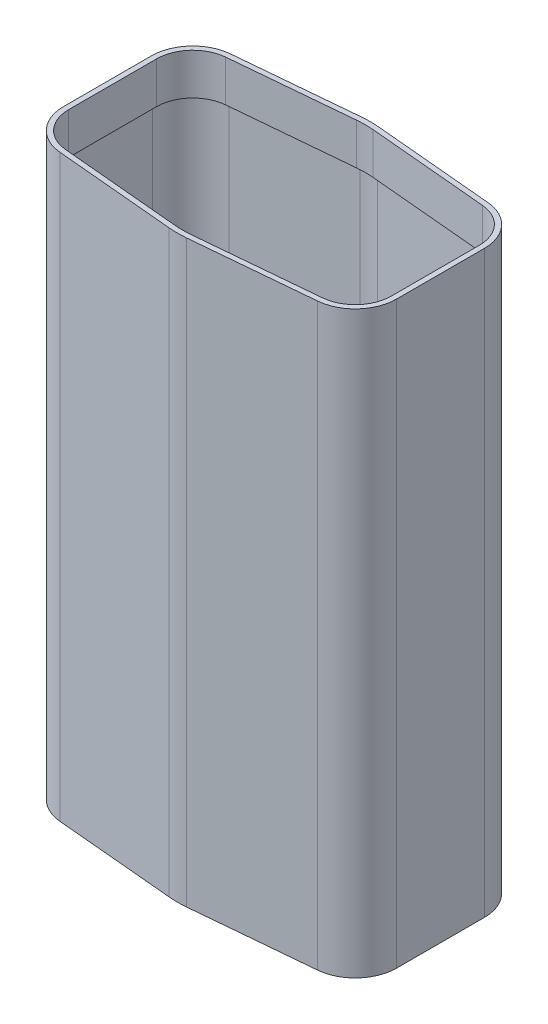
ISO-10303-21;
HEADER;
FILE_DESCRIPTION(('STEP AP214'),'2;1');
FILE_NAME('part.step','',(''),(''),'','','');
FILE_SCHEMA(('AUTOMOTIVE_DESIGN { 1 0 10303 214 1 1 1 1 }'));
ENDSEC;
DATA;
#1=APPLICATION_CONTEXT('core data for automotive mechanical design processes');
#2=APPLICATION_PROTOCOL_DEFINITION('international standard','automotive_design',2000,#1);
#3=PRODUCT_CONTEXT('',#1,'mechanical');
#4=PRODUCT('Part','Part','',(#3));
#5=PRODUCT_RELATED_PRODUCT_CATEGORY('part','',(#4));
#6=PRODUCT_DEFINITION_FORMATION('','',#4);
#7=PRODUCT_DEFINITION_CONTEXT('part definition',#1,'design');
#8=PRODUCT_DEFINITION('design','',#6,#7);
#9=PRODUCT_DEFINITION_SHAPE('','',#8);
#10=(LENGTH_UNIT() NAMED_UNIT(*) SI_UNIT(.MILLI.,.METRE.));
#11=(NAMED_UNIT(*) PLANE_ANGLE_UNIT() SI_UNIT($,.RADIAN.));
#12=(NAMED_UNIT(*) SI_UNIT($,.STERADIAN.) SOLID_ANGLE_UNIT());
#13=UNCERTAINTY_MEASURE_WITH_UNIT(LENGTH_MEASURE(1.E-05),#10,'distance_accuracy_value','');
#14=(GEOMETRIC_REPRESENTATION_CONTEXT(3) GLOBAL_UNCERTAINTY_ASSIGNED_CONTEXT((#13)) GLOBAL_UNIT_ASSIGNED_CONTEXT((#10,
#11,#12)) REPRESENTATION_CONTEXT('',''));
#15=CARTESIAN_POINT('',(0.,0.,0.));
#16=DIRECTION('',(0.,0.,1.));
#17=DIRECTION('',(1.,0.,0.));
#18=AXIS2_PLACEMENT_3D('',#15,#16,#17);
#19=CARTESIAN_POINT('',(-153.674263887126,711.2,-53.975));
#20=DIRECTION('',(0.,-1.,0.));
#21=DIRECTION('',(0.,0.,-1.));
#22=AXIS2_PLACEMENT_3D('',#19,#20,#21);
#23=CYLINDRICAL_SURFACE('',#22,44.45);
#24=DIRECTION('',(0.,-1.,0.));
#25=VECTOR('',#24,1.);
#26=CARTESIAN_POINT('',(-157.686970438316,711.2,-98.2435067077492));
#27=LINE('',#26,#25);
#28=CARTESIAN_POINT('',(-157.686970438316,474.133333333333,-98.2435067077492));
#29=VERTEX_POINT('',#28);
#30=CARTESIAN_POINT('',(-157.686970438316,436.033333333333,-98.2435067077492));
#31=VERTEX_POINT('',#30);
#32=EDGE_CURVE('E1079',#29,#31,#27,.T.);
#33=ORIENTED_EDGE('',*,*,#32,.F.);
#34=CARTESIAN_POINT('',(-153.674263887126,474.133333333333,-53.975));
#35=DIRECTION('',(0.,1.,0.));
#36=DIRECTION('',(0.,0.,1.));
#37=AXIS2_PLACEMENT_3D('',#34,#35,#36);
#38=CIRCLE('',#37,44.45);
#39=CARTESIAN_POINT('',(-198.124263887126,474.133333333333,-53.975));
#40=VERTEX_POINT('',#39);
#41=EDGE_CURVE('E49',#29,#40,#38,.T.);
#42=ORIENTED_EDGE('',*,*,#41,.T.);
#43=DIRECTION('',(0.,-1.,0.));
#44=VECTOR('',#43,1.);
#45=CARTESIAN_POINT('',(-198.124263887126,711.2,-53.975));
#46=LINE('',#45,#44);
#47=CARTESIAN_POINT('',(-198.124263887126,436.033333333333,-53.975));
#48=VERTEX_POINT('',#47);
#49=EDGE_CURVE('E1134',#40,#48,#46,.T.);
#50=ORIENTED_EDGE('',*,*,#49,.T.);
#51=CARTESIAN_POINT('',(-153.674263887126,436.033333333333,-53.975));
#52=DIRECTION('',(0.,1.,0.));
#53=DIRECTION('',(0.,0.,1.));
#54=AXIS2_PLACEMENT_3D('',#51,#52,#53);
#55=CIRCLE('',#54,44.45);
#56=EDGE_CURVE('E858',#31,#48,#55,.T.);
#57=ORIENTED_EDGE('',*,*,#56,.F.);
#58=EDGE_LOOP('',(#33,#42,#50,#57));
#59=FACE_BOUND('',#58,.T.);
#60=ADVANCED_FACE('F34',(#59),#23,.F.);
#61=CARTESIAN_POINT('',(-198.124263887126,711.2,-53.975));
#62=DIRECTION('',(1.,0.,0.));
#63=DIRECTION('',(0.,0.,-1.));
#64=AXIS2_PLACEMENT_3D('',#61,#62,#63);
#65=PLANE('',#64);
#66=ORIENTED_EDGE('',*,*,#49,.F.);
#67=DIRECTION('',(0.,0.,1.));
#68=VECTOR('',#67,1.);
#69=CARTESIAN_POINT('',(-198.124263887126,474.133333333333,-53.975));
#70=LINE('',#69,#68);
#71=CARTESIAN_POINT('',(-198.124263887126,474.133333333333,53.975));
#72=VERTEX_POINT('',#71);
#73=EDGE_CURVE('E684',#40,#72,#70,.T.);
#74=ORIENTED_EDGE('',*,*,#73,.T.);
#75=DIRECTION('',(0.,-1.,0.));
#76=VECTOR('',#75,1.);
#77=CARTESIAN_POINT('',(-198.124263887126,711.2,53.975));
#78=LINE('',#77,#76);
#79=CARTESIAN_POINT('',(-198.124263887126,436.033333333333,53.975));
#80=VERTEX_POINT('',#79);
#81=EDGE_CURVE('E1129',#72,#80,#78,.T.);
#82=ORIENTED_EDGE('',*,*,#81,.T.);
#83=DIRECTION('',(0.,0.,1.));
#84=VECTOR('',#83,1.);
#85=CARTESIAN_POINT('',(-198.124263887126,436.033333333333,-53.975));
#86=LINE('',#85,#84);
#87=EDGE_CURVE('E855',#48,#80,#86,.T.);
#88=ORIENTED_EDGE('',*,*,#87,.F.);
#89=EDGE_LOOP('',(#66,#74,#82,#88));
#90=FACE_BOUND('',#89,.T.);
#91=ADVANCED_FACE('F1328',(#90),#65,.T.);
#92=CARTESIAN_POINT('',(-153.674263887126,711.2,53.975));
#93=DIRECTION('',(0.,-1.,0.));
#94=DIRECTION('',(0.,0.,-1.));
#95=AXIS2_PLACEMENT_3D('',#92,#93,#94);
#96=CYLINDRICAL_SURFACE('',#95,44.45);
#97=ORIENTED_EDGE('',*,*,#81,.F.);
#98=CARTESIAN_POINT('',(-153.674263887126,474.133333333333,53.975));
#99=DIRECTION('',(0.,1.,0.));
#100=DIRECTION('',(0.,0.,1.));
#101=AXIS2_PLACEMENT_3D('',#98,#99,#100);
#102=CIRCLE('',#101,44.45);
#103=CARTESIAN_POINT('',(-157.686970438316,474.133333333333,98.2435067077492));
#104=VERTEX_POINT('',#103);
#105=EDGE_CURVE('E681',#72,#104,#102,.T.);
#106=ORIENTED_EDGE('',*,*,#105,.T.);
#107=DIRECTION('',(0.,-1.,0.));
#108=VECTOR('',#107,1.);
#109=CARTESIAN_POINT('',(-157.686970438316,711.2,98.2435067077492));
#110=LINE('',#109,#108);
#111=CARTESIAN_POINT('',(-157.686970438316,436.033333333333,98.2435067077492));
#112=VERTEX_POINT('',#111);
#113=EDGE_CURVE('E1124',#104,#112,#110,.T.);
#114=ORIENTED_EDGE('',*,*,#113,.T.);
#115=CARTESIAN_POINT('',(-153.674263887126,436.033333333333,53.975));
#116=DIRECTION('',(0.,1.,0.));
#117=DIRECTION('',(0.,0.,1.));
#118=AXIS2_PLACEMENT_3D('',#115,#116,#117);
#119=CIRCLE('',#118,44.45);
#120=EDGE_CURVE('E852',#80,#112,#119,.T.);
#121=ORIENTED_EDGE('',*,*,#120,.F.);
#122=EDGE_LOOP('',(#97,#106,#114,#121));
#123=FACE_BOUND('',#122,.T.);
#124=ADVANCED_FACE('F1335',(#123),#96,.F.);
#125=CARTESIAN_POINT('',(-157.686970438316,711.2,98.2435067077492));
#126=DIRECTION('',(0.0902746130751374,0.,-0.995916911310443));
#127=DIRECTION('',(-0.995916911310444,0.,-0.0902746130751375));
#128=AXIS2_PLACEMENT_3D('',#125,#126,#127);
#129=PLANE('',#128);
#130=ORIENTED_EDGE('',*,*,#113,.F.);
#131=DIRECTION('',(0.995916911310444,0.,0.0902746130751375));
#132=VECTOR('',#131,1.);
#133=CARTESIAN_POINT('',(-157.686970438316,474.133333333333,98.2435067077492));
#134=LINE('',#133,#132);
#135=CARTESIAN_POINT('',(-10.1177529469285,474.133333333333,111.619877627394));
#136=VERTEX_POINT('',#135);
#137=EDGE_CURVE('E678',#104,#136,#134,.T.);
#138=ORIENTED_EDGE('',*,*,#137,.T.);
#139=DIRECTION('',(0.,-1.,0.));
#140=VECTOR('',#139,1.);
#141=CARTESIAN_POINT('',(-10.1177529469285,711.2,111.619877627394));
#142=LINE('',#141,#140);
#143=CARTESIAN_POINT('',(-10.1177529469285,436.033333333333,111.619877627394));
#144=VERTEX_POINT('',#143);
#145=EDGE_CURVE('E1119',#136,#144,#142,.T.);
#146=ORIENTED_EDGE('',*,*,#145,.T.);
#147=DIRECTION('',(0.995916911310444,0.,0.0902746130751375));
#148=VECTOR('',#147,1.);
#149=CARTESIAN_POINT('',(-157.686970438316,436.033333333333,98.2435067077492));
#150=LINE('',#149,#148);
#151=EDGE_CURVE('E849',#112,#144,#150,.T.);
#152=ORIENTED_EDGE('',*,*,#151,.F.);
#153=EDGE_LOOP('',(#130,#138,#146,#152));
#154=FACE_BOUND('',#153,.T.);
#155=ADVANCED_FACE('F1524',(#154),#129,.T.);
#156=CARTESIAN_POINT('',(0.,711.2,0.));
#157=DIRECTION('',(0.,-1.,0.));
#158=DIRECTION('',(0.,0.,-1.));
#159=AXIS2_PLACEMENT_3D('',#156,#157,#158);
#160=CYLINDRICAL_SURFACE('',#159,112.077499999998);
#161=ORIENTED_EDGE('',*,*,#145,.F.);
#162=CARTESIAN_POINT('',(0.,474.133333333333,0.));
#163=DIRECTION('',(0.,1.,0.));
#164=DIRECTION('',(0.,0.,1.));
#165=AXIS2_PLACEMENT_3D('',#162,#163,#164);
#166=CIRCLE('',#165,112.077499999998);
#167=CARTESIAN_POINT('',(10.1177529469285,474.133333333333,111.619877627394));
#168=VERTEX_POINT('',#167);
#169=EDGE_CURVE('E675',#136,#168,#166,.T.);
#170=ORIENTED_EDGE('',*,*,#169,.T.);
#171=DIRECTION('',(0.,-1.,0.));
#172=VECTOR('',#171,1.);
#173=CARTESIAN_POINT('',(10.1177529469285,711.2,111.619877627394));
#174=LINE('',#173,#172);
#175=CARTESIAN_POINT('',(10.1177529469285,436.033333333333,111.619877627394));
#176=VERTEX_POINT('',#175);
#177=EDGE_CURVE('E1114',#168,#176,#174,.T.);
#178=ORIENTED_EDGE('',*,*,#177,.T.);
#179=CARTESIAN_POINT('',(0.,436.033333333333,0.));
#180=DIRECTION('',(0.,1.,0.));
#181=DIRECTION('',(0.,0.,1.));
#182=AXIS2_PLACEMENT_3D('',#179,#180,#181);
#183=CIRCLE('',#182,112.077499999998);
#184=EDGE_CURVE('E846',#144,#176,#183,.T.);
#185=ORIENTED_EDGE('',*,*,#184,.F.);
#186=EDGE_LOOP('',(#161,#170,#178,#185));
#187=FACE_BOUND('',#186,.T.);
#188=ADVANCED_FACE('F1473',(#187),#160,.F.);
#189=CARTESIAN_POINT('',(10.1177529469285,711.2,111.619877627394));
#190=DIRECTION('',(-0.090274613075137,0.,-0.995916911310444));
#191=DIRECTION('',(-0.995916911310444,0.,0.090274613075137));
#192=AXIS2_PLACEMENT_3D('',#189,#190,#191);
#193=PLANE('',#192);
#194=ORIENTED_EDGE('',*,*,#177,.F.);
#195=DIRECTION('',(0.995916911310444,0.,-0.090274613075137));
#196=VECTOR('',#195,1.);
#197=CARTESIAN_POINT('',(10.1177529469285,474.133333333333,111.619877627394));
#198=LINE('',#197,#196);
#199=CARTESIAN_POINT('',(157.686970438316,474.133333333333,98.2435067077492));
#200=VERTEX_POINT('',#199);
#201=EDGE_CURVE('E672',#168,#200,#198,.T.);
#202=ORIENTED_EDGE('',*,*,#201,.T.);
#203=DIRECTION('',(0.,-1.,0.));
#204=VECTOR('',#203,1.);
#205=CARTESIAN_POINT('',(157.686970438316,711.2,98.2435067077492));
#206=LINE('',#205,#204);
#207=CARTESIAN_POINT('',(157.686970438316,436.033333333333,98.2435067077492));
#208=VERTEX_POINT('',#207);
#209=EDGE_CURVE('E1109',#200,#208,#206,.T.);
#210=ORIENTED_EDGE('',*,*,#209,.T.);
#211=DIRECTION('',(0.995916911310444,0.,-0.090274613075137));
#212=VECTOR('',#211,1.);
#213=CARTESIAN_POINT('',(10.1177529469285,436.033333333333,111.619877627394));
#214=LINE('',#213,#212);
#215=EDGE_CURVE('E843',#176,#208,#214,.T.);
#216=ORIENTED_EDGE('',*,*,#215,.F.);
#217=EDGE_LOOP('',(#194,#202,#210,#216));
#218=FACE_BOUND('',#217,.T.);
#219=ADVANCED_FACE('F1468',(#218),#193,.T.);
#220=CARTESIAN_POINT('',(153.674263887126,711.2,53.975));
#221=DIRECTION('',(0.,-1.,0.));
#222=DIRECTION('',(0.,0.,-1.));
#223=AXIS2_PLACEMENT_3D('',#220,#221,#222);
#224=CYLINDRICAL_SURFACE('',#223,44.45);
#225=ORIENTED_EDGE('',*,*,#209,.F.);
#226=CARTESIAN_POINT('',(153.674263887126,474.133333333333,53.975));
#227=DIRECTION('',(0.,1.,0.));
#228=DIRECTION('',(0.,0.,1.));
#229=AXIS2_PLACEMENT_3D('',#226,#227,#228);
#230=CIRCLE('',#229,44.45);
#231=CARTESIAN_POINT('',(198.124263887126,474.133333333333,53.9750000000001));
#232=VERTEX_POINT('',#231);
#233=EDGE_CURVE('E669',#200,#232,#230,.T.);
#234=ORIENTED_EDGE('',*,*,#233,.T.);
#235=DIRECTION('',(0.,-1.,0.));
#236=VECTOR('',#235,1.);
#237=CARTESIAN_POINT('',(198.124263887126,711.2,53.9750000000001));
#238=LINE('',#237,#236);
#239=CARTESIAN_POINT('',(198.124263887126,436.033333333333,53.9750000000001));
#240=VERTEX_POINT('',#239);
#241=EDGE_CURVE('E1104',#232,#240,#238,.T.);
#242=ORIENTED_EDGE('',*,*,#241,.T.);
#243=CARTESIAN_POINT('',(153.674263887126,436.033333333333,53.975));
#244=DIRECTION('',(0.,1.,0.));
#245=DIRECTION('',(0.,0.,1.));
#246=AXIS2_PLACEMENT_3D('',#243,#244,#245);
#247=CIRCLE('',#246,44.45);
#248=EDGE_CURVE('E840',#208,#240,#247,.T.);
#249=ORIENTED_EDGE('',*,*,#248,.F.);
#250=EDGE_LOOP('',(#225,#234,#242,#249));
#251=FACE_BOUND('',#250,.T.);
#252=ADVANCED_FACE('F1462',(#251),#224,.F.);
#253=CARTESIAN_POINT('',(198.124263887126,711.2,53.9750000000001));
#254=DIRECTION('',(-1.,0.,0.));
#255=DIRECTION('',(0.,0.,1.));
#256=AXIS2_PLACEMENT_3D('',#253,#254,#255);
#257=PLANE('',#256);
#258=ORIENTED_EDGE('',*,*,#241,.F.);
#259=DIRECTION('',(0.,0.,-1.));
#260=VECTOR('',#259,1.);
#261=CARTESIAN_POINT('',(198.124263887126,474.133333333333,53.9750000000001));
#262=LINE('',#261,#260);
#263=CARTESIAN_POINT('',(198.124263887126,474.133333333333,-53.9750000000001));
#264=VERTEX_POINT('',#263);
#265=EDGE_CURVE('E666',#232,#264,#262,.T.);
#266=ORIENTED_EDGE('',*,*,#265,.T.);
#267=DIRECTION('',(0.,-1.,0.));
#268=VECTOR('',#267,1.);
#269=CARTESIAN_POINT('',(198.124263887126,711.2,-53.9750000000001));
#270=LINE('',#269,#268);
#271=CARTESIAN_POINT('',(198.124263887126,436.033333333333,-53.9750000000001));
#272=VERTEX_POINT('',#271);
#273=EDGE_CURVE('E1099',#264,#272,#270,.T.);
#274=ORIENTED_EDGE('',*,*,#273,.T.);
#275=DIRECTION('',(0.,0.,-1.));
#276=VECTOR('',#275,1.);
#277=CARTESIAN_POINT('',(198.124263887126,436.033333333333,53.9750000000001));
#278=LINE('',#277,#276);
#279=EDGE_CURVE('E837',#240,#272,#278,.T.);
#280=ORIENTED_EDGE('',*,*,#279,.F.);
#281=EDGE_LOOP('',(#258,#266,#274,#280));
#282=FACE_BOUND('',#281,.T.);
#283=ADVANCED_FACE('F1300',(#282),#257,.T.);
#284=CARTESIAN_POINT('',(153.674263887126,711.2,-53.9750000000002));
#285=DIRECTION('',(0.,-1.,0.));
#286=DIRECTION('',(0.,0.,-1.));
#287=AXIS2_PLACEMENT_3D('',#284,#285,#286);
#288=CYLINDRICAL_SURFACE('',#287,44.45);
#289=ORIENTED_EDGE('',*,*,#273,.F.);
#290=CARTESIAN_POINT('',(153.674263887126,474.133333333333,-53.9750000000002));
#291=DIRECTION('',(0.,1.,0.));
#292=DIRECTION('',(0.,0.,1.));
#293=AXIS2_PLACEMENT_3D('',#290,#291,#292);
#294=CIRCLE('',#293,44.45);
#295=CARTESIAN_POINT('',(157.686970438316,474.133333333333,-98.2435067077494));
#296=VERTEX_POINT('',#295);
#297=EDGE_CURVE('E663',#264,#296,#294,.T.);
#298=ORIENTED_EDGE('',*,*,#297,.T.);
#299=DIRECTION('',(0.,-1.,0.));
#300=VECTOR('',#299,1.);
#301=CARTESIAN_POINT('',(157.686970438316,711.2,-98.2435067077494));
#302=LINE('',#301,#300);
#303=CARTESIAN_POINT('',(157.686970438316,436.033333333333,-98.2435067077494));
#304=VERTEX_POINT('',#303);
#305=EDGE_CURVE('E1094',#296,#304,#302,.T.);
#306=ORIENTED_EDGE('',*,*,#305,.T.);
#307=CARTESIAN_POINT('',(153.674263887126,436.033333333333,-53.9750000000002));
#308=DIRECTION('',(0.,1.,0.));
#309=DIRECTION('',(0.,0.,1.));
#310=AXIS2_PLACEMENT_3D('',#307,#308,#309);
#311=CIRCLE('',#310,44.45);
#312=EDGE_CURVE('E834',#272,#304,#311,.T.);
#313=ORIENTED_EDGE('',*,*,#312,.F.);
#314=EDGE_LOOP('',(#289,#298,#306,#313));
#315=FACE_BOUND('',#314,.T.);
#316=ADVANCED_FACE('F1303',(#315),#288,.F.);
#317=CARTESIAN_POINT('',(10.1177529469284,711.2,-111.619877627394));
#318=DIRECTION('',(-0.0902746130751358,0.,0.995916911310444));
#319=DIRECTION('',(0.995916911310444,0.,0.0902746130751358));
#320=AXIS2_PLACEMENT_3D('',#317,#318,#319);
#321=PLANE('',#320);
#322=ORIENTED_EDGE('',*,*,#305,.F.);
#323=DIRECTION('',(-0.995916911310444,0.,-0.0902746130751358));
#324=VECTOR('',#323,1.);
#325=CARTESIAN_POINT('',(10.1177529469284,474.133333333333,-111.619877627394));
#326=LINE('',#325,#324);
#327=CARTESIAN_POINT('',(10.1177529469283,474.133333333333,-111.619877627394));
#328=VERTEX_POINT('',#327);
#329=EDGE_CURVE('E655',#296,#328,#326,.T.);
#330=ORIENTED_EDGE('',*,*,#329,.T.);
#331=DIRECTION('',(0.,-1.,0.));
#332=VECTOR('',#331,1.);
#333=CARTESIAN_POINT('',(10.1177529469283,711.2,-111.619877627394));
#334=LINE('',#333,#332);
#335=CARTESIAN_POINT('',(10.1177529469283,436.033333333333,-111.619877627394));
#336=VERTEX_POINT('',#335);
#337=EDGE_CURVE('E1089',#328,#336,#334,.T.);
#338=ORIENTED_EDGE('',*,*,#337,.T.);
#339=DIRECTION('',(-0.995916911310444,0.,-0.0902746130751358));
#340=VECTOR('',#339,1.);
#341=CARTESIAN_POINT('',(10.1177529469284,436.033333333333,-111.619877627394));
#342=LINE('',#341,#340);
#343=EDGE_CURVE('E831',#304,#336,#342,.T.);
#344=ORIENTED_EDGE('',*,*,#343,.F.);
#345=EDGE_LOOP('',(#322,#330,#338,#344));
#346=FACE_BOUND('',#345,.T.);
#347=ADVANCED_FACE('F1275',(#346),#321,.T.);
#348=CARTESIAN_POINT('',(0.,711.2,0.));
#349=DIRECTION('',(0.,-1.,0.));
#350=DIRECTION('',(0.,0.,-1.));
#351=AXIS2_PLACEMENT_3D('',#348,#349,#350);
#352=CYLINDRICAL_SURFACE('',#351,112.077499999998);
#353=ORIENTED_EDGE('',*,*,#337,.F.);
#354=CARTESIAN_POINT('',(0.,474.133333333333,0.));
#355=DIRECTION('',(0.,1.,0.));
#356=DIRECTION('',(0.,0.,1.));
#357=AXIS2_PLACEMENT_3D('',#354,#355,#356);
#358=CIRCLE('',#357,112.077499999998);
#359=CARTESIAN_POINT('',(-10.1177529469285,474.133333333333,-111.619877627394));
#360=VERTEX_POINT('',#359);
#361=EDGE_CURVE('E651',#328,#360,#358,.T.);
#362=ORIENTED_EDGE('',*,*,#361,.T.);
#363=DIRECTION('',(0.,-1.,0.));
#364=VECTOR('',#363,1.);
#365=CARTESIAN_POINT('',(-10.1177529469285,711.2,-111.619877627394));
#366=LINE('',#365,#364);
#367=CARTESIAN_POINT('',(-10.1177529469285,436.033333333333,-111.619877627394));
#368=VERTEX_POINT('',#367);
#369=EDGE_CURVE('E1084',#360,#368,#366,.T.);
#370=ORIENTED_EDGE('',*,*,#369,.T.);
#371=CARTESIAN_POINT('',(0.,436.033333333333,0.));
#372=DIRECTION('',(0.,1.,0.));
#373=DIRECTION('',(0.,0.,1.));
#374=AXIS2_PLACEMENT_3D('',#371,#372,#373);
#375=CIRCLE('',#374,112.077499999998);
#376=EDGE_CURVE('E828',#336,#368,#375,.T.);
#377=ORIENTED_EDGE('',*,*,#376,.F.);
#378=EDGE_LOOP('',(#353,#362,#370,#377));
#379=FACE_BOUND('',#378,.T.);
#380=ADVANCED_FACE('F1267',(#379),#352,.F.);
#381=CARTESIAN_POINT('',(-157.686970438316,711.2,-98.2435067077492));
#382=DIRECTION('',(0.0902746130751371,0.,0.995916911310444));
#383=DIRECTION('',(0.995916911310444,0.,-0.0902746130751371));
#384=AXIS2_PLACEMENT_3D('',#381,#382,#383);
#385=PLANE('',#384);
#386=ORIENTED_EDGE('',*,*,#369,.F.);
#387=DIRECTION('',(-0.995916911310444,0.,0.0902746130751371));
#388=VECTOR('',#387,1.);
#389=CARTESIAN_POINT('',(-157.686970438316,474.133333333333,-98.2435067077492));
#390=LINE('',#389,#388);
#391=EDGE_CURVE('E42',#360,#29,#390,.T.);
#392=ORIENTED_EDGE('',*,*,#391,.T.);
#393=ORIENTED_EDGE('',*,*,#32,.T.);
#394=DIRECTION('',(-0.995916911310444,0.,0.0902746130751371));
#395=VECTOR('',#394,1.);
#396=CARTESIAN_POINT('',(-157.686970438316,436.033333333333,-98.2435067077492));
#397=LINE('',#396,#395);
#398=EDGE_CURVE('E1229',#368,#31,#397,.T.);
#399=ORIENTED_EDGE('',*,*,#398,.F.);
#400=EDGE_LOOP('',(#386,#392,#393,#399));
#401=FACE_BOUND('',#400,.T.);
#402=ADVANCED_FACE('F1234',(#401),#385,.T.);
#403=CARTESIAN_POINT('',(-157.686970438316,249.766666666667,-98.2435067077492));
#404=VERTEX_POINT('',#403);
#405=CARTESIAN_POINT('',(-157.686970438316,211.666666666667,-98.2435067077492));
#406=VERTEX_POINT('',#405);
#407=EDGE_CURVE('E1239',#404,#406,#27,.T.);
#408=ORIENTED_EDGE('',*,*,#407,.F.);
#409=CARTESIAN_POINT('',(-153.674263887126,249.766666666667,-53.975));
#410=DIRECTION('',(0.,1.,0.));
#411=DIRECTION('',(0.,0.,1.));
#412=AXIS2_PLACEMENT_3D('',#409,#410,#411);
#413=CIRCLE('',#412,44.45);
#414=CARTESIAN_POINT('',(-198.124263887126,249.766666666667,-53.975));
#415=VERTEX_POINT('',#414);
#416=EDGE_CURVE('E825',#404,#415,#413,.T.);
#417=ORIENTED_EDGE('',*,*,#416,.T.);
#418=CARTESIAN_POINT('',(-198.124263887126,211.666666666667,-53.975));
#419=VERTEX_POINT('',#418);
#420=EDGE_CURVE('E1542',#415,#419,#46,.T.);
#421=ORIENTED_EDGE('',*,*,#420,.T.);
#422=CARTESIAN_POINT('',(-153.674263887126,211.666666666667,-53.975));
#423=DIRECTION('',(0.,1.,0.));
#424=DIRECTION('',(0.,0.,1.));
#425=AXIS2_PLACEMENT_3D('',#422,#423,#424);
#426=CIRCLE('',#425,44.45);
#427=EDGE_CURVE('E1010',#406,#419,#426,.T.);
#428=ORIENTED_EDGE('',*,*,#427,.F.);
#429=EDGE_LOOP('',(#408,#417,#421,#428));
#430=FACE_BOUND('',#429,.T.);
#431=ADVANCED_FACE('F1330',(#430),#23,.F.);
#432=ORIENTED_EDGE('',*,*,#420,.F.);
#433=DIRECTION('',(0.,0.,1.));
#434=VECTOR('',#433,1.);
#435=CARTESIAN_POINT('',(-198.124263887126,249.766666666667,-53.975));
#436=LINE('',#435,#434);
#437=CARTESIAN_POINT('',(-198.124263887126,249.766666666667,53.975));
#438=VERTEX_POINT('',#437);
#439=EDGE_CURVE('E822',#415,#438,#436,.T.);
#440=ORIENTED_EDGE('',*,*,#439,.T.);
#441=CARTESIAN_POINT('',(-198.124263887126,211.666666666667,53.975));
#442=VERTEX_POINT('',#441);
#443=EDGE_CURVE('E1548',#438,#442,#78,.T.);
#444=ORIENTED_EDGE('',*,*,#443,.T.);
#445=DIRECTION('',(0.,0.,1.));
#446=VECTOR('',#445,1.);
#447=CARTESIAN_POINT('',(-198.124263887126,211.666666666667,-53.975));
#448=LINE('',#447,#446);
#449=EDGE_CURVE('E1007',#419,#442,#448,.T.);
#450=ORIENTED_EDGE('',*,*,#449,.F.);
#451=EDGE_LOOP('',(#432,#440,#444,#450));
#452=FACE_BOUND('',#451,.T.);
#453=ADVANCED_FACE('F1338',(#452),#65,.T.);
#454=ORIENTED_EDGE('',*,*,#443,.F.);
#455=CARTESIAN_POINT('',(-153.674263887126,249.766666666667,53.975));
#456=DIRECTION('',(0.,1.,0.));
#457=DIRECTION('',(0.,0.,1.));
#458=AXIS2_PLACEMENT_3D('',#455,#456,#457);
#459=CIRCLE('',#458,44.45);
#460=CARTESIAN_POINT('',(-157.686970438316,249.766666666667,98.2435067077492));
#461=VERTEX_POINT('',#460);
#462=EDGE_CURVE('E819',#438,#461,#459,.T.);
#463=ORIENTED_EDGE('',*,*,#462,.T.);
#464=CARTESIAN_POINT('',(-157.686970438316,211.666666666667,98.2435067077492));
#465=VERTEX_POINT('',#464);
#466=EDGE_CURVE('E1537',#461,#465,#110,.T.);
#467=ORIENTED_EDGE('',*,*,#466,.T.);
#468=CARTESIAN_POINT('',(-153.674263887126,211.666666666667,53.975));
#469=DIRECTION('',(0.,1.,0.));
#470=DIRECTION('',(0.,0.,1.));
#471=AXIS2_PLACEMENT_3D('',#468,#469,#470);
#472=CIRCLE('',#471,44.45);
#473=EDGE_CURVE('E1004',#442,#465,#472,.T.);
#474=ORIENTED_EDGE('',*,*,#473,.F.);
#475=EDGE_LOOP('',(#454,#463,#467,#474));
#476=FACE_BOUND('',#475,.T.);
#477=ADVANCED_FACE('F1552',(#476),#96,.F.);
#478=ORIENTED_EDGE('',*,*,#466,.F.);
#479=DIRECTION('',(0.995916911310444,0.,0.0902746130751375));
#480=VECTOR('',#479,1.);
#481=CARTESIAN_POINT('',(-157.686970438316,249.766666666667,98.2435067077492));
#482=LINE('',#481,#480);
#483=CARTESIAN_POINT('',(-10.1177529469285,249.766666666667,111.619877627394));
#484=VERTEX_POINT('',#483);
#485=EDGE_CURVE('E816',#461,#484,#482,.T.);
#486=ORIENTED_EDGE('',*,*,#485,.T.);
#487=CARTESIAN_POINT('',(-10.1177529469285,211.666666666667,111.619877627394));
#488=VERTEX_POINT('',#487);
#489=EDGE_CURVE('E1516',#484,#488,#142,.T.);
#490=ORIENTED_EDGE('',*,*,#489,.T.);
#491=DIRECTION('',(0.995916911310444,0.,0.0902746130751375));
#492=VECTOR('',#491,1.);
#493=CARTESIAN_POINT('',(-157.686970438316,211.666666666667,98.2435067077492));
#494=LINE('',#493,#492);
#495=EDGE_CURVE('E1001',#465,#488,#494,.T.);
#496=ORIENTED_EDGE('',*,*,#495,.F.);
#497=EDGE_LOOP('',(#478,#486,#490,#496));
#498=FACE_BOUND('',#497,.T.);
#499=ADVANCED_FACE('F1500',(#498),#129,.T.);
#500=ORIENTED_EDGE('',*,*,#489,.F.);
#501=CARTESIAN_POINT('',(0.,249.766666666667,0.));
#502=DIRECTION('',(0.,1.,0.));
#503=DIRECTION('',(0.,0.,1.));
#504=AXIS2_PLACEMENT_3D('',#501,#502,#503);
#505=CIRCLE('',#504,112.077499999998);
#506=CARTESIAN_POINT('',(10.1177529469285,249.766666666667,111.619877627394));
#507=VERTEX_POINT('',#506);
#508=EDGE_CURVE('E813',#484,#507,#505,.T.);
#509=ORIENTED_EDGE('',*,*,#508,.T.);
#510=CARTESIAN_POINT('',(10.1177529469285,211.666666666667,111.619877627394));
#511=VERTEX_POINT('',#510);
#512=EDGE_CURVE('E1504',#507,#511,#174,.T.);
#513=ORIENTED_EDGE('',*,*,#512,.T.);
#514=CARTESIAN_POINT('',(0.,211.666666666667,0.));
#515=DIRECTION('',(0.,1.,0.));
#516=DIRECTION('',(0.,0.,1.));
#517=AXIS2_PLACEMENT_3D('',#514,#515,#516);
#518=CIRCLE('',#517,112.077499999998);
#519=EDGE_CURVE('E998',#488,#511,#518,.T.);
#520=ORIENTED_EDGE('',*,*,#519,.F.);
#521=EDGE_LOOP('',(#500,#509,#513,#520));
#522=FACE_BOUND('',#521,.T.);
#523=ADVANCED_FACE('F1493',(#522),#160,.F.);
#524=ORIENTED_EDGE('',*,*,#512,.F.);
#525=DIRECTION('',(0.995916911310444,0.,-0.090274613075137));
#526=VECTOR('',#525,1.);
#527=CARTESIAN_POINT('',(10.1177529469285,249.766666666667,111.619877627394));
#528=LINE('',#527,#526);
#529=CARTESIAN_POINT('',(157.686970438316,249.766666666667,98.2435067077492));
#530=VERTEX_POINT('',#529);
#531=EDGE_CURVE('E810',#507,#530,#528,.T.);
#532=ORIENTED_EDGE('',*,*,#531,.T.);
#533=CARTESIAN_POINT('',(157.686970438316,211.666666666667,98.2435067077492));
#534=VERTEX_POINT('',#533);
#535=EDGE_CURVE('E1532',#530,#534,#206,.T.);
#536=ORIENTED_EDGE('',*,*,#535,.T.);
#537=DIRECTION('',(0.995916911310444,0.,-0.090274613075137));
#538=VECTOR('',#537,1.);
#539=CARTESIAN_POINT('',(10.1177529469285,211.666666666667,111.619877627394));
#540=LINE('',#539,#538);
#541=EDGE_CURVE('E995',#511,#534,#540,.T.);
#542=ORIENTED_EDGE('',*,*,#541,.F.);
#543=EDGE_LOOP('',(#524,#532,#536,#542));
#544=FACE_BOUND('',#543,.T.);
#545=ADVANCED_FACE('F1460',(#544),#193,.T.);
#546=ORIENTED_EDGE('',*,*,#535,.F.);
#547=CARTESIAN_POINT('',(153.674263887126,249.766666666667,53.975));
#548=DIRECTION('',(0.,1.,0.));
#549=DIRECTION('',(0.,0.,1.));
#550=AXIS2_PLACEMENT_3D('',#547,#548,#549);
#551=CIRCLE('',#550,44.45);
#552=CARTESIAN_POINT('',(198.124263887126,249.766666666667,53.9750000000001));
#553=VERTEX_POINT('',#552);
#554=EDGE_CURVE('E807',#530,#553,#551,.T.);
#555=ORIENTED_EDGE('',*,*,#554,.T.);
#556=CARTESIAN_POINT('',(198.124263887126,211.666666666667,53.9750000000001));
#557=VERTEX_POINT('',#556);
#558=EDGE_CURVE('E1530',#553,#557,#238,.T.);
#559=ORIENTED_EDGE('',*,*,#558,.T.);
#560=CARTESIAN_POINT('',(153.674263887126,211.666666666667,53.975));
#561=DIRECTION('',(0.,1.,0.));
#562=DIRECTION('',(0.,0.,1.));
#563=AXIS2_PLACEMENT_3D('',#560,#561,#562);
#564=CIRCLE('',#563,44.45);
#565=EDGE_CURVE('E992',#534,#557,#564,.T.);
#566=ORIENTED_EDGE('',*,*,#565,.F.);
#567=EDGE_LOOP('',(#546,#555,#559,#566));
#568=FACE_BOUND('',#567,.T.);
#569=ADVANCED_FACE('F1454',(#568),#224,.F.);
#570=ORIENTED_EDGE('',*,*,#558,.F.);
#571=DIRECTION('',(0.,0.,-1.));
#572=VECTOR('',#571,1.);
#573=CARTESIAN_POINT('',(198.124263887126,249.766666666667,53.9750000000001));
#574=LINE('',#573,#572);
#575=CARTESIAN_POINT('',(198.124263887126,249.766666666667,-53.9750000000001));
#576=VERTEX_POINT('',#575);
#577=EDGE_CURVE('E804',#553,#576,#574,.T.);
#578=ORIENTED_EDGE('',*,*,#577,.T.);
#579=CARTESIAN_POINT('',(198.124263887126,211.666666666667,-53.9750000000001));
#580=VERTEX_POINT('',#579);
#581=EDGE_CURVE('E1292',#576,#580,#270,.T.);
#582=ORIENTED_EDGE('',*,*,#581,.T.);
#583=DIRECTION('',(0.,0.,-1.));
#584=VECTOR('',#583,1.);
#585=CARTESIAN_POINT('',(198.124263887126,211.666666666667,53.9750000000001));
#586=LINE('',#585,#584);
#587=EDGE_CURVE('E989',#557,#580,#586,.T.);
#588=ORIENTED_EDGE('',*,*,#587,.F.);
#589=EDGE_LOOP('',(#570,#578,#582,#588));
#590=FACE_BOUND('',#589,.T.);
#591=ADVANCED_FACE('F1322',(#590),#257,.T.);
#592=ORIENTED_EDGE('',*,*,#581,.F.);
#593=CARTESIAN_POINT('',(153.674263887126,249.766666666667,-53.9750000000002));
#594=DIRECTION('',(0.,1.,0.));
#595=DIRECTION('',(0.,0.,1.));
#596=AXIS2_PLACEMENT_3D('',#593,#594,#595);
#597=CIRCLE('',#596,44.45);
#598=CARTESIAN_POINT('',(157.686970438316,249.766666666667,-98.2435067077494));
#599=VERTEX_POINT('',#598);
#600=EDGE_CURVE('E801',#576,#599,#597,.T.);
#601=ORIENTED_EDGE('',*,*,#600,.T.);
#602=CARTESIAN_POINT('',(157.686970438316,211.666666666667,-98.2435067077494));
#603=VERTEX_POINT('',#602);
#604=EDGE_CURVE('E1304',#599,#603,#302,.T.);
#605=ORIENTED_EDGE('',*,*,#604,.T.);
#606=CARTESIAN_POINT('',(153.674263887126,211.666666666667,-53.9750000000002));
#607=DIRECTION('',(0.,1.,0.));
#608=DIRECTION('',(0.,0.,1.));
#609=AXIS2_PLACEMENT_3D('',#606,#607,#608);
#610=CIRCLE('',#609,44.45);
#611=EDGE_CURVE('E986',#580,#603,#610,.T.);
#612=ORIENTED_EDGE('',*,*,#611,.F.);
#613=EDGE_LOOP('',(#592,#601,#605,#612));
#614=FACE_BOUND('',#613,.T.);
#615=ADVANCED_FACE('F1308',(#614),#288,.F.);
#616=ORIENTED_EDGE('',*,*,#604,.F.);
#617=DIRECTION('',(-0.995916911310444,0.,-0.0902746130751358));
#618=VECTOR('',#617,1.);
#619=CARTESIAN_POINT('',(10.1177529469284,249.766666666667,-111.619877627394));
#620=LINE('',#619,#618);
#621=CARTESIAN_POINT('',(10.1177529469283,249.766666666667,-111.619877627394));
#622=VERTEX_POINT('',#621);
#623=EDGE_CURVE('E798',#599,#622,#620,.T.);
#624=ORIENTED_EDGE('',*,*,#623,.T.);
#625=CARTESIAN_POINT('',(10.1177529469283,211.666666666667,-111.619877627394));
#626=VERTEX_POINT('',#625);
#627=EDGE_CURVE('E1276',#622,#626,#334,.T.);
#628=ORIENTED_EDGE('',*,*,#627,.T.);
#629=DIRECTION('',(-0.995916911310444,0.,-0.0902746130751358));
#630=VECTOR('',#629,1.);
#631=CARTESIAN_POINT('',(10.1177529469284,211.666666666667,-111.619877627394));
#632=LINE('',#631,#630);
#633=EDGE_CURVE('E983',#603,#626,#632,.T.);
#634=ORIENTED_EDGE('',*,*,#633,.F.);
#635=EDGE_LOOP('',(#616,#624,#628,#634));
#636=FACE_BOUND('',#635,.T.);
#637=ADVANCED_FACE('F1312',(#636),#321,.T.);
#638=ORIENTED_EDGE('',*,*,#627,.F.);
#639=CARTESIAN_POINT('',(0.,249.766666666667,0.));
#640=DIRECTION('',(0.,1.,0.));
#641=DIRECTION('',(0.,0.,1.));
#642=AXIS2_PLACEMENT_3D('',#639,#640,#641);
#643=CIRCLE('',#642,112.077499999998);
#644=CARTESIAN_POINT('',(-10.1177529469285,249.766666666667,-111.619877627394));
#645=VERTEX_POINT('',#644);
#646=EDGE_CURVE('E795',#622,#645,#643,.T.);
#647=ORIENTED_EDGE('',*,*,#646,.T.);
#648=CARTESIAN_POINT('',(-10.1177529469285,211.666666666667,-111.619877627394));
#649=VERTEX_POINT('',#648);
#650=EDGE_CURVE('E1260',#645,#649,#366,.T.);
#651=ORIENTED_EDGE('',*,*,#650,.T.);
#652=CARTESIAN_POINT('',(0.,211.666666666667,0.));
#653=DIRECTION('',(0.,1.,0.));
#654=DIRECTION('',(0.,0.,1.));
#655=AXIS2_PLACEMENT_3D('',#652,#653,#654);
#656=CIRCLE('',#655,112.077499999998);
#657=EDGE_CURVE('E980',#626,#649,#656,.T.);
#658=ORIENTED_EDGE('',*,*,#657,.F.);
#659=EDGE_LOOP('',(#638,#647,#651,#658));
#660=FACE_BOUND('',#659,.T.);
#661=ADVANCED_FACE('F1314',(#660),#352,.F.);
#662=ORIENTED_EDGE('',*,*,#650,.F.);
#663=DIRECTION('',(-0.995916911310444,0.,0.0902746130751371));
#664=VECTOR('',#663,1.);
#665=CARTESIAN_POINT('',(-157.686970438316,249.766666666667,-98.2435067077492));
#666=LINE('',#665,#664);
#667=EDGE_CURVE('E1226',#645,#404,#666,.T.);
#668=ORIENTED_EDGE('',*,*,#667,.T.);
#669=ORIENTED_EDGE('',*,*,#407,.T.);
#670=DIRECTION('',(-0.995916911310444,0.,0.0902746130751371));
#671=VECTOR('',#670,1.);
#672=CARTESIAN_POINT('',(-157.686970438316,211.666666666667,-98.2435067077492));
#673=LINE('',#672,#671);
#674=EDGE_CURVE('E1223',#649,#406,#673,.T.);
#675=ORIENTED_EDGE('',*,*,#674,.F.);
#676=EDGE_LOOP('',(#662,#668,#669,#675));
#677=FACE_BOUND('',#676,.T.);
#678=ADVANCED_FACE('F1320',(#677),#385,.T.);
#679=CARTESIAN_POINT('',(-157.686970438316,25.4,-98.2435067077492));
#680=VERTEX_POINT('',#679);
#681=CARTESIAN_POINT('',(-157.686970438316,0.,-98.2435067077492));
#682=VERTEX_POINT('',#681);
#683=EDGE_CURVE('E1040',#680,#682,#27,.T.);
#684=ORIENTED_EDGE('',*,*,#683,.F.);
#685=CARTESIAN_POINT('',(-153.674263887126,25.4,-53.975));
#686=DIRECTION('',(0.,1.,0.));
#687=DIRECTION('',(0.,0.,1.));
#688=AXIS2_PLACEMENT_3D('',#685,#686,#687);
#689=CIRCLE('',#688,44.45);
#690=CARTESIAN_POINT('',(-198.124263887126,25.4,-53.975));
#691=VERTEX_POINT('',#690);
#692=EDGE_CURVE('E977',#680,#691,#689,.T.);
#693=ORIENTED_EDGE('',*,*,#692,.T.);
#694=CARTESIAN_POINT('',(-198.124263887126,0.,-53.975));
#695=VERTEX_POINT('',#694);
#696=EDGE_CURVE('E1128',#691,#695,#46,.T.);
#697=ORIENTED_EDGE('',*,*,#696,.T.);
#698=CARTESIAN_POINT('',(-153.674263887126,0.,-53.975));
#699=DIRECTION('',(0.,1.,0.));
#700=DIRECTION('',(0.,0.,1.));
#701=AXIS2_PLACEMENT_3D('',#698,#699,#700);
#702=CIRCLE('',#701,44.45);
#703=EDGE_CURVE('E1013',#682,#695,#702,.T.);
#704=ORIENTED_EDGE('',*,*,#703,.F.);
#705=EDGE_LOOP('',(#684,#693,#697,#704));
#706=FACE_BOUND('',#705,.T.);
#707=ADVANCED_FACE('F1250',(#706),#23,.F.);
#708=ORIENTED_EDGE('',*,*,#696,.F.);
#709=DIRECTION('',(0.,0.,1.));
#710=VECTOR('',#709,1.);
#711=CARTESIAN_POINT('',(-198.124263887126,25.4,-53.975));
#712=LINE('',#711,#710);
#713=CARTESIAN_POINT('',(-198.124263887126,25.4,53.975));
#714=VERTEX_POINT('',#713);
#715=EDGE_CURVE('E974',#691,#714,#712,.T.);
#716=ORIENTED_EDGE('',*,*,#715,.T.);
#717=CARTESIAN_POINT('',(-198.124263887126,0.,53.975));
#718=VERTEX_POINT('',#717);
#719=EDGE_CURVE('E1123',#714,#718,#78,.T.);
#720=ORIENTED_EDGE('',*,*,#719,.T.);
#721=DIRECTION('',(0.,0.,1.));
#722=VECTOR('',#721,1.);
#723=CARTESIAN_POINT('',(-198.124263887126,0.,-53.975));
#724=LINE('',#723,#722);
#725=EDGE_CURVE('E1043',#695,#718,#724,.T.);
#726=ORIENTED_EDGE('',*,*,#725,.F.);
#727=EDGE_LOOP('',(#708,#716,#720,#726));
#728=FACE_BOUND('',#727,.T.);
#729=ADVANCED_FACE('F1352',(#728),#65,.T.);
#730=ORIENTED_EDGE('',*,*,#719,.F.);
#731=CARTESIAN_POINT('',(-153.674263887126,25.4,53.975));
#732=DIRECTION('',(0.,1.,0.));
#733=DIRECTION('',(0.,0.,1.));
#734=AXIS2_PLACEMENT_3D('',#731,#732,#733);
#735=CIRCLE('',#734,44.45);
#736=CARTESIAN_POINT('',(-157.686970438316,25.4,98.2435067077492));
#737=VERTEX_POINT('',#736);
#738=EDGE_CURVE('E971',#714,#737,#735,.T.);
#739=ORIENTED_EDGE('',*,*,#738,.T.);
#740=CARTESIAN_POINT('',(-157.686970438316,0.,98.2435067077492));
#741=VERTEX_POINT('',#740);
#742=EDGE_CURVE('E1118',#737,#741,#110,.T.);
#743=ORIENTED_EDGE('',*,*,#742,.T.);
#744=CARTESIAN_POINT('',(-153.674263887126,0.,53.975));
#745=DIRECTION('',(0.,1.,0.));
#746=DIRECTION('',(0.,0.,1.));
#747=AXIS2_PLACEMENT_3D('',#744,#745,#746);
#748=CIRCLE('',#747,44.45);
#749=EDGE_CURVE('E1046',#718,#741,#748,.T.);
#750=ORIENTED_EDGE('',*,*,#749,.F.);
#751=EDGE_LOOP('',(#730,#739,#743,#750));
#752=FACE_BOUND('',#751,.T.);
#753=ADVANCED_FACE('F1362',(#752),#96,.F.);
#754=ORIENTED_EDGE('',*,*,#742,.F.);
#755=DIRECTION('',(0.995916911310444,0.,0.0902746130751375));
#756=VECTOR('',#755,1.);
#757=CARTESIAN_POINT('',(-157.686970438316,25.4,98.2435067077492));
#758=LINE('',#757,#756);
#759=CARTESIAN_POINT('',(-10.1177529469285,25.4,111.619877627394));
#760=VERTEX_POINT('',#759);
#761=EDGE_CURVE('E968',#737,#760,#758,.T.);
#762=ORIENTED_EDGE('',*,*,#761,.T.);
#763=CARTESIAN_POINT('',(-10.1177529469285,0.,111.619877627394));
#764=VERTEX_POINT('',#763);
#765=EDGE_CURVE('E1113',#760,#764,#142,.T.);
#766=ORIENTED_EDGE('',*,*,#765,.T.);
#767=DIRECTION('',(0.995916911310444,0.,0.0902746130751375));
#768=VECTOR('',#767,1.);
#769=CARTESIAN_POINT('',(-157.686970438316,0.,98.2435067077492));
#770=LINE('',#769,#768);
#771=EDGE_CURVE('E1049',#741,#764,#770,.T.);
#772=ORIENTED_EDGE('',*,*,#771,.F.);
#773=EDGE_LOOP('',(#754,#762,#766,#772));
#774=FACE_BOUND('',#773,.T.);
#775=ADVANCED_FACE('F1491',(#774),#129,.T.);
#776=ORIENTED_EDGE('',*,*,#765,.F.);
#777=CARTESIAN_POINT('',(0.,25.4,0.));
#778=DIRECTION('',(0.,1.,0.));
#779=DIRECTION('',(0.,0.,1.));
#780=AXIS2_PLACEMENT_3D('',#777,#778,#779);
#781=CIRCLE('',#780,112.077499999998);
#782=CARTESIAN_POINT('',(10.1177529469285,25.4,111.619877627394));
#783=VERTEX_POINT('',#782);
#784=EDGE_CURVE('E965',#760,#783,#781,.T.);
#785=ORIENTED_EDGE('',*,*,#784,.T.);
#786=CARTESIAN_POINT('',(10.1177529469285,0.,111.619877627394));
#787=VERTEX_POINT('',#786);
#788=EDGE_CURVE('E1108',#783,#787,#174,.T.);
#789=ORIENTED_EDGE('',*,*,#788,.T.);
#790=CARTESIAN_POINT('',(0.,0.,0.));
#791=DIRECTION('',(0.,1.,0.));
#792=DIRECTION('',(0.,0.,1.));
#793=AXIS2_PLACEMENT_3D('',#790,#791,#792);
#794=CIRCLE('',#793,112.077499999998);
#795=EDGE_CURVE('E1052',#764,#787,#794,.T.);
#796=ORIENTED_EDGE('',*,*,#795,.F.);
#797=EDGE_LOOP('',(#776,#785,#789,#796));
#798=FACE_BOUND('',#797,.T.);
#799=ADVANCED_FACE('F1485',(#798),#160,.F.);
#800=ORIENTED_EDGE('',*,*,#788,.F.);
#801=DIRECTION('',(0.995916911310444,0.,-0.090274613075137));
#802=VECTOR('',#801,1.);
#803=CARTESIAN_POINT('',(10.1177529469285,25.4,111.619877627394));
#804=LINE('',#803,#802);
#805=CARTESIAN_POINT('',(157.686970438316,25.4,98.2435067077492));
#806=VERTEX_POINT('',#805);
#807=EDGE_CURVE('E962',#783,#806,#804,.T.);
#808=ORIENTED_EDGE('',*,*,#807,.T.);
#809=CARTESIAN_POINT('',(157.686970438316,0.,98.2435067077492));
#810=VERTEX_POINT('',#809);
#811=EDGE_CURVE('E1103',#806,#810,#206,.T.);
#812=ORIENTED_EDGE('',*,*,#811,.T.);
#813=DIRECTION('',(0.995916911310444,0.,-0.090274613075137));
#814=VECTOR('',#813,1.);
#815=CARTESIAN_POINT('',(10.1177529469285,0.,111.619877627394));
#816=LINE('',#815,#814);
#817=EDGE_CURVE('E1055',#787,#810,#816,.T.);
#818=ORIENTED_EDGE('',*,*,#817,.F.);
#819=EDGE_LOOP('',(#800,#808,#812,#818));
#820=FACE_BOUND('',#819,.T.);
#821=ADVANCED_FACE('F1451',(#820),#193,.T.);
#822=ORIENTED_EDGE('',*,*,#811,.F.);
#823=CARTESIAN_POINT('',(153.674263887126,25.4,53.975));
#824=DIRECTION('',(0.,1.,0.));
#825=DIRECTION('',(0.,0.,1.));
#826=AXIS2_PLACEMENT_3D('',#823,#824,#825);
#827=CIRCLE('',#826,44.45);
#828=CARTESIAN_POINT('',(198.124263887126,25.4,53.9750000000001));
#829=VERTEX_POINT('',#828);
#830=EDGE_CURVE('E959',#806,#829,#827,.T.);
#831=ORIENTED_EDGE('',*,*,#830,.T.);
#832=CARTESIAN_POINT('',(198.124263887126,0.,53.9750000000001));
#833=VERTEX_POINT('',#832);
#834=EDGE_CURVE('E1098',#829,#833,#238,.T.);
#835=ORIENTED_EDGE('',*,*,#834,.T.);
#836=CARTESIAN_POINT('',(153.674263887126,0.,53.975));
#837=DIRECTION('',(0.,1.,0.));
#838=DIRECTION('',(0.,0.,1.));
#839=AXIS2_PLACEMENT_3D('',#836,#837,#838);
#840=CIRCLE('',#839,44.45);
#841=EDGE_CURVE('E1058',#810,#833,#840,.T.);
#842=ORIENTED_EDGE('',*,*,#841,.F.);
#843=EDGE_LOOP('',(#822,#831,#835,#842));
#844=FACE_BOUND('',#843,.T.);
#845=ADVANCED_FACE('F1447',(#844),#224,.F.);
#846=ORIENTED_EDGE('',*,*,#834,.F.);
#847=DIRECTION('',(0.,0.,-1.));
#848=VECTOR('',#847,1.);
#849=CARTESIAN_POINT('',(198.124263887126,25.4,53.9750000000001));
#850=LINE('',#849,#848);
#851=CARTESIAN_POINT('',(198.124263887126,25.4,-53.9750000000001));
#852=VERTEX_POINT('',#851);
#853=EDGE_CURVE('E956',#829,#852,#850,.T.);
#854=ORIENTED_EDGE('',*,*,#853,.T.);
#855=CARTESIAN_POINT('',(198.124263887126,0.,-53.9750000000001));
#856=VERTEX_POINT('',#855);
#857=EDGE_CURVE('E1093',#852,#856,#270,.T.);
#858=ORIENTED_EDGE('',*,*,#857,.T.);
#859=DIRECTION('',(0.,0.,-1.));
#860=VECTOR('',#859,1.);
#861=CARTESIAN_POINT('',(198.124263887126,0.,53.9750000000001));
#862=LINE('',#861,#860);
#863=EDGE_CURVE('E1061',#833,#856,#862,.T.);
#864=ORIENTED_EDGE('',*,*,#863,.F.);
#865=EDGE_LOOP('',(#846,#854,#858,#864));
#866=FACE_BOUND('',#865,.T.);
#867=ADVANCED_FACE('F1441',(#866),#257,.T.);
#868=ORIENTED_EDGE('',*,*,#857,.F.);
#869=CARTESIAN_POINT('',(153.674263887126,25.4,-53.9750000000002));
#870=DIRECTION('',(0.,1.,0.));
#871=DIRECTION('',(0.,0.,1.));
#872=AXIS2_PLACEMENT_3D('',#869,#870,#871);
#873=CIRCLE('',#872,44.45);
#874=CARTESIAN_POINT('',(157.686970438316,25.4,-98.2435067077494));
#875=VERTEX_POINT('',#874);
#876=EDGE_CURVE('E953',#852,#875,#873,.T.);
#877=ORIENTED_EDGE('',*,*,#876,.T.);
#878=CARTESIAN_POINT('',(157.686970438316,0.,-98.2435067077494));
#879=VERTEX_POINT('',#878);
#880=EDGE_CURVE('E1088',#875,#879,#302,.T.);
#881=ORIENTED_EDGE('',*,*,#880,.T.);
#882=CARTESIAN_POINT('',(153.674263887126,0.,-53.9750000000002));
#883=DIRECTION('',(0.,1.,0.));
#884=DIRECTION('',(0.,0.,-1.));
#885=AXIS2_PLACEMENT_3D('',#882,#883,#884);
#886=CIRCLE('',#885,44.45);
#887=EDGE_CURVE('E1064',#856,#879,#886,.T.);
#888=ORIENTED_EDGE('',*,*,#887,.F.);
#889=EDGE_LOOP('',(#868,#877,#881,#888));
#890=FACE_BOUND('',#889,.T.);
#891=ADVANCED_FACE('F1288',(#890),#288,.F.);
#892=ORIENTED_EDGE('',*,*,#880,.F.);
#893=DIRECTION('',(-0.995916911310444,0.,-0.0902746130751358));
#894=VECTOR('',#893,1.);
#895=CARTESIAN_POINT('',(10.1177529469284,25.4,-111.619877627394));
#896=LINE('',#895,#894);
#897=CARTESIAN_POINT('',(10.1177529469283,25.4,-111.619877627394));
#898=VERTEX_POINT('',#897);
#899=EDGE_CURVE('E950',#875,#898,#896,.T.);
#900=ORIENTED_EDGE('',*,*,#899,.T.);
#901=CARTESIAN_POINT('',(10.1177529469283,0.,-111.619877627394));
#902=VERTEX_POINT('',#901);
#903=EDGE_CURVE('E1083',#898,#902,#334,.T.);
#904=ORIENTED_EDGE('',*,*,#903,.T.);
#905=DIRECTION('',(-0.995916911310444,0.,-0.0902746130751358));
#906=VECTOR('',#905,1.);
#907=CARTESIAN_POINT('',(10.1177529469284,0.,-111.619877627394));
#908=LINE('',#907,#906);
#909=EDGE_CURVE('E1067',#879,#902,#908,.T.);
#910=ORIENTED_EDGE('',*,*,#909,.F.);
#911=EDGE_LOOP('',(#892,#900,#904,#910));
#912=FACE_BOUND('',#911,.T.);
#913=ADVANCED_FACE('F1282',(#912),#321,.T.);
#914=ORIENTED_EDGE('',*,*,#903,.F.);
#915=CARTESIAN_POINT('',(0.,25.4,0.));
#916=DIRECTION('',(0.,1.,0.));
#917=DIRECTION('',(0.,0.,1.));
#918=AXIS2_PLACEMENT_3D('',#915,#916,#917);
#919=CIRCLE('',#918,112.077499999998);
#920=CARTESIAN_POINT('',(-10.1177529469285,25.4,-111.619877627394));
#921=VERTEX_POINT('',#920);
#922=EDGE_CURVE('E947',#898,#921,#919,.T.);
#923=ORIENTED_EDGE('',*,*,#922,.T.);
#924=CARTESIAN_POINT('',(-10.1177529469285,0.,-111.619877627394));
#925=VERTEX_POINT('',#924);
#926=EDGE_CURVE('E1078',#921,#925,#366,.T.);
#927=ORIENTED_EDGE('',*,*,#926,.T.);
#928=CARTESIAN_POINT('',(0.,0.,0.));
#929=DIRECTION('',(0.,1.,0.));
#930=DIRECTION('',(0.,0.,-1.));
#931=AXIS2_PLACEMENT_3D('',#928,#929,#930);
#932=CIRCLE('',#931,112.077499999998);
#933=EDGE_CURVE('E1070',#902,#925,#932,.T.);
#934=ORIENTED_EDGE('',*,*,#933,.F.);
#935=EDGE_LOOP('',(#914,#923,#927,#934));
#936=FACE_BOUND('',#935,.T.);
#937=ADVANCED_FACE('F1259',(#936),#352,.F.);
#938=ORIENTED_EDGE('',*,*,#926,.F.);
#939=DIRECTION('',(-0.995916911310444,0.,0.0902746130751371));
#940=VECTOR('',#939,1.);
#941=CARTESIAN_POINT('',(-157.686970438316,25.4,-98.2435067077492));
#942=LINE('',#941,#940);
#943=EDGE_CURVE('E1220',#921,#680,#942,.T.);
#944=ORIENTED_EDGE('',*,*,#943,.T.);
#945=ORIENTED_EDGE('',*,*,#683,.T.);
#946=DIRECTION('',(-0.995916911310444,0.,0.0902746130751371));
#947=VECTOR('',#946,1.);
#948=CARTESIAN_POINT('',(-157.686970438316,0.,-98.2435067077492));
#949=LINE('',#948,#947);
#950=EDGE_CURVE('E1017',#925,#682,#949,.T.);
#951=ORIENTED_EDGE('',*,*,#950,.F.);
#952=EDGE_LOOP('',(#938,#944,#945,#951));
#953=FACE_BOUND('',#952,.T.);
#954=ADVANCED_FACE('F1248',(#953),#385,.T.);
#955=CARTESIAN_POINT('',(-153.674263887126,711.2,-53.975));
#956=DIRECTION('',(0.,1.,0.));
#957=DIRECTION('',(0.,0.,1.));
#958=AXIS2_PLACEMENT_3D('',#955,#956,#957);
#959=PLANE('',#958);
#960=CARTESIAN_POINT('',(-153.674263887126,711.2,-53.975));
#961=DIRECTION('',(0.,1.,0.));
#962=DIRECTION('',(0.,0.,1.));
#963=AXIS2_PLACEMENT_3D('',#960,#961,#962);
#964=CIRCLE('',#963,50.8);
#965=CARTESIAN_POINT('',(-158.260214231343,711.2,-104.567579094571));
#966=VERTEX_POINT('',#965);
#967=CARTESIAN_POINT('',(-204.474263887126,711.2,-53.975));
#968=VERTEX_POINT('',#967);
#969=EDGE_CURVE('E1135',#966,#968,#964,.T.);
#970=ORIENTED_EDGE('',*,*,#969,.T.);
#971=DIRECTION('',(0.,0.,1.));
#972=VECTOR('',#971,1.);
#973=CARTESIAN_POINT('',(-204.474263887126,711.2,-53.975));
#974=LINE('',#973,#972);
#975=CARTESIAN_POINT('',(-204.474263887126,711.2,53.975));
#976=VERTEX_POINT('',#975);
#977=EDGE_CURVE('E1138',#968,#976,#974,.T.);
#978=ORIENTED_EDGE('',*,*,#977,.T.);
#979=CARTESIAN_POINT('',(-153.674263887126,711.2,53.975));
#980=DIRECTION('',(0.,1.,0.));
#981=DIRECTION('',(0.,0.,1.));
#982=AXIS2_PLACEMENT_3D('',#979,#980,#981);
#983=CIRCLE('',#982,50.8);
#984=CARTESIAN_POINT('',(-158.260214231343,711.2,104.567579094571));
#985=VERTEX_POINT('',#984);
#986=EDGE_CURVE('E1141',#976,#985,#983,.T.);
#987=ORIENTED_EDGE('',*,*,#986,.T.);
#988=DIRECTION('',(0.995916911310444,0.,0.0902746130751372));
#989=VECTOR('',#988,1.);
#990=CARTESIAN_POINT('',(-158.260214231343,711.2,104.567579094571));
#991=LINE('',#990,#989);
#992=CARTESIAN_POINT('',(-10.6909967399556,711.2,117.943950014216));
#993=VERTEX_POINT('',#992);
#994=EDGE_CURVE('E1143',#985,#993,#991,.T.);
#995=ORIENTED_EDGE('',*,*,#994,.T.);
#996=CARTESIAN_POINT('',(0.,711.2,0.));
#997=DIRECTION('',(0.,1.,0.));
#998=DIRECTION('',(0.,0.,1.));
#999=AXIS2_PLACEMENT_3D('',#996,#997,#998);
#1000=CIRCLE('',#999,118.427499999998);
#1001=CARTESIAN_POINT('',(10.6909967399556,711.2,117.943950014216));
#1002=VERTEX_POINT('',#1001);
#1003=EDGE_CURVE('E1145',#993,#1002,#1000,.T.);
#1004=ORIENTED_EDGE('',*,*,#1003,.T.);
#1005=DIRECTION('',(0.995916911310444,0.,-0.0902746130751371));
#1006=VECTOR('',#1005,1.);
#1007=CARTESIAN_POINT('',(10.6909967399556,711.2,117.943950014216));
#1008=LINE('',#1007,#1006);
#1009=CARTESIAN_POINT('',(158.260214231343,711.2,104.567579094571));
#1010=VERTEX_POINT('',#1009);
#1011=EDGE_CURVE('E1147',#1002,#1010,#1008,.T.);
#1012=ORIENTED_EDGE('',*,*,#1011,.T.);
#1013=CARTESIAN_POINT('',(153.674263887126,711.2,53.975));
#1014=DIRECTION('',(0.,1.,0.));
#1015=DIRECTION('',(0.,0.,1.));
#1016=AXIS2_PLACEMENT_3D('',#1013,#1014,#1015);
#1017=CIRCLE('',#1016,50.8);
#1018=CARTESIAN_POINT('',(204.474263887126,711.2,53.9750000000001));
#1019=VERTEX_POINT('',#1018);
#1020=EDGE_CURVE('E1149',#1010,#1019,#1017,.T.);
#1021=ORIENTED_EDGE('',*,*,#1020,.T.);
#1022=DIRECTION('',(0.,0.,-1.));
#1023=VECTOR('',#1022,1.);
#1024=CARTESIAN_POINT('',(204.474263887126,711.2,53.9750000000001));
#1025=LINE('',#1024,#1023);
#1026=CARTESIAN_POINT('',(204.474263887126,711.2,-53.9750000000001));
#1027=VERTEX_POINT('',#1026);
#1028=EDGE_CURVE('E1151',#1019,#1027,#1025,.T.);
#1029=ORIENTED_EDGE('',*,*,#1028,.T.);
#1030=CARTESIAN_POINT('',(153.674263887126,711.2,-53.9750000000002));
#1031=DIRECTION('',(0.,1.,0.));
#1032=DIRECTION('',(0.,0.,-1.));
#1033=AXIS2_PLACEMENT_3D('',#1030,#1031,#1032);
#1034=CIRCLE('',#1033,50.8);
#1035=CARTESIAN_POINT('',(158.260214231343,711.2,-104.567579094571));
#1036=VERTEX_POINT('',#1035);
#1037=EDGE_CURVE('E1153',#1027,#1036,#1034,.T.);
#1038=ORIENTED_EDGE('',*,*,#1037,.T.);
#1039=DIRECTION('',(-0.995916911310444,0.,-0.0902746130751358));
#1040=VECTOR('',#1039,1.);
#1041=CARTESIAN_POINT('',(10.6909967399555,711.2,-117.943950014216));
#1042=LINE('',#1041,#1040);
#1043=CARTESIAN_POINT('',(10.6909967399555,711.2,-117.943950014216));
#1044=VERTEX_POINT('',#1043);
#1045=EDGE_CURVE('E1155',#1036,#1044,#1042,.T.);
#1046=ORIENTED_EDGE('',*,*,#1045,.T.);
#1047=CARTESIAN_POINT('',(0.,711.2,0.));
#1048=DIRECTION('',(0.,1.,0.));
#1049=DIRECTION('',(0.,0.,-1.));
#1050=AXIS2_PLACEMENT_3D('',#1047,#1048,#1049);
#1051=CIRCLE('',#1050,118.427499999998);
#1052=CARTESIAN_POINT('',(-10.6909967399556,711.2,-117.943950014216));
#1053=VERTEX_POINT('',#1052);
#1054=EDGE_CURVE('E1157',#1044,#1053,#1051,.T.);
#1055=ORIENTED_EDGE('',*,*,#1054,.T.);
#1056=DIRECTION('',(-0.995916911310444,0.,0.0902746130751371));
#1057=VECTOR('',#1056,1.);
#1058=CARTESIAN_POINT('',(-158.260214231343,711.2,-104.567579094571));
#1059=LINE('',#1058,#1057);
#1060=EDGE_CURVE('E1159',#1053,#966,#1059,.T.);
#1061=ORIENTED_EDGE('',*,*,#1060,.T.);
#1062=EDGE_LOOP('',(#970,#978,#987,#995,#1004,#1012,#1021,#1029,#1038,#1046,#1055,#1061));
#1063=FACE_BOUND('',#1062,.T.);
#1064=DIRECTION('',(0.,0.,1.));
#1065=VECTOR('',#1064,1.);
#1066=CARTESIAN_POINT('',(-198.124263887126,711.2,-53.975));
#1067=LINE('',#1066,#1065);
#1068=CARTESIAN_POINT('',(-198.124263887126,711.2,-53.975));
#1069=VERTEX_POINT('',#1068);
#1070=CARTESIAN_POINT('',(-198.124263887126,711.2,53.975));
#1071=VERTEX_POINT('',#1070);
#1072=EDGE_CURVE('E1016',#1069,#1071,#1067,.T.);
#1073=ORIENTED_EDGE('',*,*,#1072,.F.);
#1074=CARTESIAN_POINT('',(-153.674263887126,711.2,-53.975));
#1075=DIRECTION('',(0.,1.,0.));
#1076=DIRECTION('',(0.,0.,1.));
#1077=AXIS2_PLACEMENT_3D('',#1074,#1075,#1076);
#1078=CIRCLE('',#1077,44.45);
#1079=CARTESIAN_POINT('',(-157.686970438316,711.2,-98.2435067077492));
#1080=VERTEX_POINT('',#1079);
#1081=EDGE_CURVE('E1014',#1080,#1069,#1078,.T.);
#1082=ORIENTED_EDGE('',*,*,#1081,.F.);
#1083=DIRECTION('',(-0.995916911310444,0.,0.0902746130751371));
#1084=VECTOR('',#1083,1.);
#1085=CARTESIAN_POINT('',(-157.686970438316,711.2,-98.2435067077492));
#1086=LINE('',#1085,#1084);
#1087=CARTESIAN_POINT('',(-10.1177529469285,711.2,-111.619877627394));
#1088=VERTEX_POINT('',#1087);
#1089=EDGE_CURVE('E1038',#1088,#1080,#1086,.T.);
#1090=ORIENTED_EDGE('',*,*,#1089,.F.);
#1091=CARTESIAN_POINT('',(0.,711.2,0.));
#1092=DIRECTION('',(0.,1.,0.));
#1093=DIRECTION('',(0.,0.,-1.));
#1094=AXIS2_PLACEMENT_3D('',#1091,#1092,#1093);
#1095=CIRCLE('',#1094,112.077499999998);
#1096=CARTESIAN_POINT('',(10.1177529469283,711.2,-111.619877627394));
#1097=VERTEX_POINT('',#1096);
#1098=EDGE_CURVE('E1035',#1097,#1088,#1095,.T.);
#1099=ORIENTED_EDGE('',*,*,#1098,.F.);
#1100=DIRECTION('',(-0.995916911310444,0.,-0.0902746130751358));
#1101=VECTOR('',#1100,1.);
#1102=CARTESIAN_POINT('',(10.1177529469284,711.2,-111.619877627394));
#1103=LINE('',#1102,#1101);
#1104=CARTESIAN_POINT('',(157.686970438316,711.2,-98.2435067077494));
#1105=VERTEX_POINT('',#1104);
#1106=EDGE_CURVE('E1033',#1105,#1097,#1103,.T.);
#1107=ORIENTED_EDGE('',*,*,#1106,.F.);
#1108=CARTESIAN_POINT('',(153.674263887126,711.2,-53.9750000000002));
#1109=DIRECTION('',(0.,1.,0.));
#1110=DIRECTION('',(0.,0.,-1.));
#1111=AXIS2_PLACEMENT_3D('',#1108,#1109,#1110);
#1112=CIRCLE('',#1111,44.45);
#1113=CARTESIAN_POINT('',(198.124263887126,711.2,-53.9750000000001));
#1114=VERTEX_POINT('',#1113);
#1115=EDGE_CURVE('E1031',#1114,#1105,#1112,.T.);
#1116=ORIENTED_EDGE('',*,*,#1115,.F.);
#1117=DIRECTION('',(0.,0.,-1.));
#1118=VECTOR('',#1117,1.);
#1119=CARTESIAN_POINT('',(198.124263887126,711.2,53.9750000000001));
#1120=LINE('',#1119,#1118);
#1121=CARTESIAN_POINT('',(198.124263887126,711.2,53.9750000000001));
#1122=VERTEX_POINT('',#1121);
#1123=EDGE_CURVE('E1029',#1122,#1114,#1120,.T.);
#1124=ORIENTED_EDGE('',*,*,#1123,.F.);
#1125=CARTESIAN_POINT('',(153.674263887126,711.2,53.975));
#1126=DIRECTION('',(0.,1.,0.));
#1127=DIRECTION('',(0.,0.,1.));
#1128=AXIS2_PLACEMENT_3D('',#1125,#1126,#1127);
#1129=CIRCLE('',#1128,44.45);
#1130=CARTESIAN_POINT('',(157.686970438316,711.2,98.2435067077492));
#1131=VERTEX_POINT('',#1130);
#1132=EDGE_CURVE('E1027',#1131,#1122,#1129,.T.);
#1133=ORIENTED_EDGE('',*,*,#1132,.F.);
#1134=DIRECTION('',(0.995916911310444,0.,-0.090274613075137));
#1135=VECTOR('',#1134,1.);
#1136=CARTESIAN_POINT('',(10.1177529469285,711.2,111.619877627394));
#1137=LINE('',#1136,#1135);
#1138=CARTESIAN_POINT('',(10.1177529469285,711.2,111.619877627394));
#1139=VERTEX_POINT('',#1138);
#1140=EDGE_CURVE('E1025',#1139,#1131,#1137,.T.);
#1141=ORIENTED_EDGE('',*,*,#1140,.F.);
#1142=CARTESIAN_POINT('',(0.,711.2,0.));
#1143=DIRECTION('',(0.,1.,0.));
#1144=DIRECTION('',(0.,0.,1.));
#1145=AXIS2_PLACEMENT_3D('',#1142,#1143,#1144);
#1146=CIRCLE('',#1145,112.077499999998);
#1147=CARTESIAN_POINT('',(-10.1177529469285,711.2,111.619877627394));
#1148=VERTEX_POINT('',#1147);
#1149=EDGE_CURVE('E1023',#1148,#1139,#1146,.T.);
#1150=ORIENTED_EDGE('',*,*,#1149,.F.);
#1151=DIRECTION('',(0.995916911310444,0.,0.0902746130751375));
#1152=VECTOR('',#1151,1.);
#1153=CARTESIAN_POINT('',(-157.686970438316,711.2,98.2435067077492));
#1154=LINE('',#1153,#1152);
#1155=CARTESIAN_POINT('',(-157.686970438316,711.2,98.2435067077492));
#1156=VERTEX_POINT('',#1155);
#1157=EDGE_CURVE('E1021',#1156,#1148,#1154,.T.);
#1158=ORIENTED_EDGE('',*,*,#1157,.F.);
#1159=CARTESIAN_POINT('',(-153.674263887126,711.2,53.975));
#1160=DIRECTION('',(0.,1.,0.));
#1161=DIRECTION('',(0.,0.,1.));
#1162=AXIS2_PLACEMENT_3D('',#1159,#1160,#1161);
#1163=CIRCLE('',#1162,44.45);
#1164=EDGE_CURVE('E1019',#1071,#1156,#1163,.T.);
#1165=ORIENTED_EDGE('',*,*,#1164,.F.);
#1166=EDGE_LOOP('',(#1073,#1082,#1090,#1099,#1107,#1116,#1124,#1133,#1141,#1150,#1158,#1165));
#1167=FACE_BOUND('',#1166,.T.);
#1168=ADVANCED_FACE('F1370',(#1063,#1167),#959,.T.);
#1169=CARTESIAN_POINT('',(-153.674263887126,0.,-53.975));
#1170=DIRECTION('',(0.,1.,0.));
#1171=DIRECTION('',(0.,0.,1.));
#1172=AXIS2_PLACEMENT_3D('',#1169,#1170,#1171);
#1173=PLANE('',#1172);
#1174=CARTESIAN_POINT('',(-153.674263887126,0.,-53.975));
#1175=DIRECTION('',(0.,1.,0.));
#1176=DIRECTION('',(0.,0.,1.));
#1177=AXIS2_PLACEMENT_3D('',#1174,#1175,#1176);
#1178=CIRCLE('',#1177,50.8);
#1179=CARTESIAN_POINT('',(-158.260214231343,0.,-104.567579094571));
#1180=VERTEX_POINT('',#1179);
#1181=CARTESIAN_POINT('',(-204.474263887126,0.,-53.975));
#1182=VERTEX_POINT('',#1181);
#1183=EDGE_CURVE('E1133',#1180,#1182,#1178,.T.);
#1184=ORIENTED_EDGE('',*,*,#1183,.F.);
#1185=DIRECTION('',(-0.995916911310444,0.,0.0902746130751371));
#1186=VECTOR('',#1185,1.);
#1187=CARTESIAN_POINT('',(-158.260214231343,0.,-104.567579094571));
#1188=LINE('',#1187,#1186);
#1189=CARTESIAN_POINT('',(-10.6909967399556,0.,-117.943950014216));
#1190=VERTEX_POINT('',#1189);
#1191=EDGE_CURVE('E1139',#1190,#1180,#1188,.T.);
#1192=ORIENTED_EDGE('',*,*,#1191,.F.);
#1193=CARTESIAN_POINT('',(0.,0.,0.));
#1194=DIRECTION('',(0.,1.,0.));
#1195=DIRECTION('',(0.,0.,-1.));
#1196=AXIS2_PLACEMENT_3D('',#1193,#1194,#1195);
#1197=CIRCLE('',#1196,118.427499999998);
#1198=CARTESIAN_POINT('',(10.6909967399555,0.,-117.943950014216));
#1199=VERTEX_POINT('',#1198);
#1200=EDGE_CURVE('E1182',#1199,#1190,#1197,.T.);
#1201=ORIENTED_EDGE('',*,*,#1200,.F.);
#1202=DIRECTION('',(-0.995916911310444,0.,-0.0902746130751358));
#1203=VECTOR('',#1202,1.);
#1204=CARTESIAN_POINT('',(10.6909967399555,0.,-117.943950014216));
#1205=LINE('',#1204,#1203);
#1206=CARTESIAN_POINT('',(158.260214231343,0.,-104.567579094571));
#1207=VERTEX_POINT('',#1206);
#1208=EDGE_CURVE('E1180',#1207,#1199,#1205,.T.);
#1209=ORIENTED_EDGE('',*,*,#1208,.F.);
#1210=CARTESIAN_POINT('',(153.674263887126,0.,-53.9750000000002));
#1211=DIRECTION('',(0.,1.,0.));
#1212=DIRECTION('',(0.,0.,-1.));
#1213=AXIS2_PLACEMENT_3D('',#1210,#1211,#1212);
#1214=CIRCLE('',#1213,50.8);
#1215=CARTESIAN_POINT('',(204.474263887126,0.,-53.9750000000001));
#1216=VERTEX_POINT('',#1215);
#1217=EDGE_CURVE('E1178',#1216,#1207,#1214,.T.);
#1218=ORIENTED_EDGE('',*,*,#1217,.F.);
#1219=DIRECTION('',(0.,0.,-1.));
#1220=VECTOR('',#1219,1.);
#1221=CARTESIAN_POINT('',(204.474263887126,0.,53.9750000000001));
#1222=LINE('',#1221,#1220);
#1223=CARTESIAN_POINT('',(204.474263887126,0.,53.9750000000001));
#1224=VERTEX_POINT('',#1223);
#1225=EDGE_CURVE('E1176',#1224,#1216,#1222,.T.);
#1226=ORIENTED_EDGE('',*,*,#1225,.F.);
#1227=CARTESIAN_POINT('',(153.674263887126,0.,53.975));
#1228=DIRECTION('',(0.,1.,0.));
#1229=DIRECTION('',(0.,0.,1.));
#1230=AXIS2_PLACEMENT_3D('',#1227,#1228,#1229);
#1231=CIRCLE('',#1230,50.8);
#1232=CARTESIAN_POINT('',(158.260214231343,0.,104.567579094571));
#1233=VERTEX_POINT('',#1232);
#1234=EDGE_CURVE('E1174',#1233,#1224,#1231,.T.);
#1235=ORIENTED_EDGE('',*,*,#1234,.F.);
#1236=DIRECTION('',(0.995916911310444,0.,-0.0902746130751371));
#1237=VECTOR('',#1236,1.);
#1238=CARTESIAN_POINT('',(10.6909967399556,0.,117.943950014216));
#1239=LINE('',#1238,#1237);
#1240=CARTESIAN_POINT('',(10.6909967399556,0.,117.943950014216));
#1241=VERTEX_POINT('',#1240);
#1242=EDGE_CURVE('E1172',#1241,#1233,#1239,.T.);
#1243=ORIENTED_EDGE('',*,*,#1242,.F.);
#1244=CARTESIAN_POINT('',(0.,0.,0.));
#1245=DIRECTION('',(0.,1.,0.));
#1246=DIRECTION('',(0.,0.,1.));
#1247=AXIS2_PLACEMENT_3D('',#1244,#1245,#1246);
#1248=CIRCLE('',#1247,118.427499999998);
#1249=CARTESIAN_POINT('',(-10.6909967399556,0.,117.943950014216));
#1250=VERTEX_POINT('',#1249);
#1251=EDGE_CURVE('E1170',#1250,#1241,#1248,.T.);
#1252=ORIENTED_EDGE('',*,*,#1251,.F.);
#1253=DIRECTION('',(0.995916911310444,0.,0.0902746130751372));
#1254=VECTOR('',#1253,1.);
#1255=CARTESIAN_POINT('',(-158.260214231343,0.,104.567579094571));
#1256=LINE('',#1255,#1254);
#1257=CARTESIAN_POINT('',(-158.260214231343,0.,104.567579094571));
#1258=VERTEX_POINT('',#1257);
#1259=EDGE_CURVE('E1168',#1258,#1250,#1256,.T.);
#1260=ORIENTED_EDGE('',*,*,#1259,.F.);
#1261=CARTESIAN_POINT('',(-153.674263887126,0.,53.975));
#1262=DIRECTION('',(0.,1.,0.));
#1263=DIRECTION('',(0.,0.,1.));
#1264=AXIS2_PLACEMENT_3D('',#1261,#1262,#1263);
#1265=CIRCLE('',#1264,50.8);
#1266=CARTESIAN_POINT('',(-204.474263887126,0.,53.975));
#1267=VERTEX_POINT('',#1266);
#1268=EDGE_CURVE('E1166',#1267,#1258,#1265,.T.);
#1269=ORIENTED_EDGE('',*,*,#1268,.F.);
#1270=DIRECTION('',(0.,0.,1.));
#1271=VECTOR('',#1270,1.);
#1272=CARTESIAN_POINT('',(-204.474263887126,0.,-53.975));
#1273=LINE('',#1272,#1271);
#1274=EDGE_CURVE('E1164',#1182,#1267,#1273,.T.);
#1275=ORIENTED_EDGE('',*,*,#1274,.F.);
#1276=EDGE_LOOP('',(#1184,#1192,#1201,#1209,#1218,#1226,#1235,#1243,#1252,#1260,#1269,#1275));
#1277=FACE_BOUND('',#1276,.T.);
#1278=ORIENTED_EDGE('',*,*,#703,.T.);
#1279=ORIENTED_EDGE('',*,*,#725,.T.);
#1280=ORIENTED_EDGE('',*,*,#749,.T.);
#1281=ORIENTED_EDGE('',*,*,#771,.T.);
#1282=ORIENTED_EDGE('',*,*,#795,.T.);
#1283=ORIENTED_EDGE('',*,*,#817,.T.);
#1284=ORIENTED_EDGE('',*,*,#841,.T.);
#1285=ORIENTED_EDGE('',*,*,#863,.T.);
#1286=ORIENTED_EDGE('',*,*,#887,.T.);
#1287=ORIENTED_EDGE('',*,*,#909,.T.);
#1288=ORIENTED_EDGE('',*,*,#933,.T.);
#1289=ORIENTED_EDGE('',*,*,#950,.T.);
#1290=EDGE_LOOP('',(#1278,#1279,#1280,#1281,#1282,#1283,#1284,#1285,#1286,#1287,#1288,#1289));
#1291=FACE_BOUND('',#1290,.T.);
#1292=ADVANCED_FACE('F1254',(#1277,#1291),#1173,.F.);
#1293=CARTESIAN_POINT('',(-153.674263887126,711.2,-53.975));
#1294=DIRECTION('',(0.,-1.,0.));
#1295=DIRECTION('',(0.,0.,-1.));
#1296=AXIS2_PLACEMENT_3D('',#1293,#1294,#1295);
#1297=CYLINDRICAL_SURFACE('',#1296,50.8);
#1298=ORIENTED_EDGE('',*,*,#1183,.T.);
#1299=DIRECTION('',(0.,-1.,0.));
#1300=VECTOR('',#1299,1.);
#1301=CARTESIAN_POINT('',(-204.474263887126,711.2,-53.975));
#1302=LINE('',#1301,#1300);
#1303=EDGE_CURVE('E1217',#968,#1182,#1302,.T.);
#1304=ORIENTED_EDGE('',*,*,#1303,.F.);
#1305=ORIENTED_EDGE('',*,*,#969,.F.);
#1306=DIRECTION('',(0.,-1.,0.));
#1307=VECTOR('',#1306,1.);
#1308=CARTESIAN_POINT('',(-158.260214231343,711.2,-104.567579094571));
#1309=LINE('',#1308,#1307);
#1310=EDGE_CURVE('E1161',#966,#1180,#1309,.T.);
#1311=ORIENTED_EDGE('',*,*,#1310,.T.);
#1312=EDGE_LOOP('',(#1298,#1304,#1305,#1311));
#1313=FACE_BOUND('',#1312,.T.);
#1314=ADVANCED_FACE('F36',(#1313),#1297,.T.);
#1315=CARTESIAN_POINT('',(-204.474263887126,711.2,-53.975));
#1316=DIRECTION('',(1.,0.,0.));
#1317=DIRECTION('',(0.,0.,-1.));
#1318=AXIS2_PLACEMENT_3D('',#1315,#1316,#1317);
#1319=PLANE('',#1318);
#1320=ORIENTED_EDGE('',*,*,#1274,.T.);
#1321=DIRECTION('',(0.,-1.,0.));
#1322=VECTOR('',#1321,1.);
#1323=CARTESIAN_POINT('',(-204.474263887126,711.2,53.975));
#1324=LINE('',#1323,#1322);
#1325=EDGE_CURVE('E1214',#976,#1267,#1324,.T.);
#1326=ORIENTED_EDGE('',*,*,#1325,.F.);
#1327=ORIENTED_EDGE('',*,*,#977,.F.);
#1328=ORIENTED_EDGE('',*,*,#1303,.T.);
#1329=EDGE_LOOP('',(#1320,#1326,#1327,#1328));
#1330=FACE_BOUND('',#1329,.T.);
#1331=ADVANCED_FACE('F2415',(#1330),#1319,.F.);
#1332=CARTESIAN_POINT('',(-153.674263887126,711.2,53.975));
#1333=DIRECTION('',(0.,-1.,0.));
#1334=DIRECTION('',(0.,0.,-1.));
#1335=AXIS2_PLACEMENT_3D('',#1332,#1333,#1334);
#1336=CYLINDRICAL_SURFACE('',#1335,50.8);
#1337=ORIENTED_EDGE('',*,*,#1268,.T.);
#1338=DIRECTION('',(0.,-1.,0.));
#1339=VECTOR('',#1338,1.);
#1340=CARTESIAN_POINT('',(-158.260214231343,711.2,104.567579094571));
#1341=LINE('',#1340,#1339);
#1342=EDGE_CURVE('E1211',#985,#1258,#1341,.T.);
#1343=ORIENTED_EDGE('',*,*,#1342,.F.);
#1344=ORIENTED_EDGE('',*,*,#986,.F.);
#1345=ORIENTED_EDGE('',*,*,#1325,.T.);
#1346=EDGE_LOOP('',(#1337,#1343,#1344,#1345));
#1347=FACE_BOUND('',#1346,.T.);
#1348=ADVANCED_FACE('F2406',(#1347),#1336,.T.);
#1349=CARTESIAN_POINT('',(-158.260214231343,711.2,104.567579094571));
#1350=DIRECTION('',(0.0902746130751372,0.,-0.995916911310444));
#1351=DIRECTION('',(-0.995916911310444,0.,-0.0902746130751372));
#1352=AXIS2_PLACEMENT_3D('',#1349,#1350,#1351);
#1353=PLANE('',#1352);
#1354=ORIENTED_EDGE('',*,*,#1259,.T.);
#1355=DIRECTION('',(0.,-1.,0.));
#1356=VECTOR('',#1355,1.);
#1357=CARTESIAN_POINT('',(-10.6909967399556,711.2,117.943950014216));
#1358=LINE('',#1357,#1356);
#1359=EDGE_CURVE('E1208',#993,#1250,#1358,.T.);
#1360=ORIENTED_EDGE('',*,*,#1359,.F.);
#1361=ORIENTED_EDGE('',*,*,#994,.F.);
#1362=ORIENTED_EDGE('',*,*,#1342,.T.);
#1363=EDGE_LOOP('',(#1354,#1360,#1361,#1362));
#1364=FACE_BOUND('',#1363,.T.);
#1365=ADVANCED_FACE('F2397',(#1364),#1353,.F.);
#1366=CARTESIAN_POINT('',(0.,711.2,0.));
#1367=DIRECTION('',(0.,-1.,0.));
#1368=DIRECTION('',(0.,0.,-1.));
#1369=AXIS2_PLACEMENT_3D('',#1366,#1367,#1368);
#1370=CYLINDRICAL_SURFACE('',#1369,118.427499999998);
#1371=ORIENTED_EDGE('',*,*,#1251,.T.);
#1372=DIRECTION('',(0.,-1.,0.));
#1373=VECTOR('',#1372,1.);
#1374=CARTESIAN_POINT('',(10.6909967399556,711.2,117.943950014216));
#1375=LINE('',#1374,#1373);
#1376=EDGE_CURVE('E1205',#1002,#1241,#1375,.T.);
#1377=ORIENTED_EDGE('',*,*,#1376,.F.);
#1378=ORIENTED_EDGE('',*,*,#1003,.F.);
#1379=ORIENTED_EDGE('',*,*,#1359,.T.);
#1380=EDGE_LOOP('',(#1371,#1377,#1378,#1379));
#1381=FACE_BOUND('',#1380,.T.);
#1382=ADVANCED_FACE('F2388',(#1381),#1370,.T.);
#1383=CARTESIAN_POINT('',(10.6909967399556,711.2,117.943950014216));
#1384=DIRECTION('',(-0.0902746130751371,0.,-0.995916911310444));
#1385=DIRECTION('',(-0.995916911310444,0.,0.0902746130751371));
#1386=AXIS2_PLACEMENT_3D('',#1383,#1384,#1385);
#1387=PLANE('',#1386);
#1388=ORIENTED_EDGE('',*,*,#1242,.T.);
#1389=DIRECTION('',(0.,-1.,0.));
#1390=VECTOR('',#1389,1.);
#1391=CARTESIAN_POINT('',(158.260214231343,711.2,104.567579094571));
#1392=LINE('',#1391,#1390);
#1393=EDGE_CURVE('E1202',#1010,#1233,#1392,.T.);
#1394=ORIENTED_EDGE('',*,*,#1393,.F.);
#1395=ORIENTED_EDGE('',*,*,#1011,.F.);
#1396=ORIENTED_EDGE('',*,*,#1376,.T.);
#1397=EDGE_LOOP('',(#1388,#1394,#1395,#1396));
#1398=FACE_BOUND('',#1397,.T.);
#1399=ADVANCED_FACE('F2379',(#1398),#1387,.F.);
#1400=CARTESIAN_POINT('',(153.674263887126,711.2,53.975));
#1401=DIRECTION('',(0.,-1.,0.));
#1402=DIRECTION('',(0.,0.,-1.));
#1403=AXIS2_PLACEMENT_3D('',#1400,#1401,#1402);
#1404=CYLINDRICAL_SURFACE('',#1403,50.8);
#1405=ORIENTED_EDGE('',*,*,#1234,.T.);
#1406=DIRECTION('',(0.,-1.,0.));
#1407=VECTOR('',#1406,1.);
#1408=CARTESIAN_POINT('',(204.474263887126,711.2,53.9750000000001));
#1409=LINE('',#1408,#1407);
#1410=EDGE_CURVE('E1199',#1019,#1224,#1409,.T.);
#1411=ORIENTED_EDGE('',*,*,#1410,.F.);
#1412=ORIENTED_EDGE('',*,*,#1020,.F.);
#1413=ORIENTED_EDGE('',*,*,#1393,.T.);
#1414=EDGE_LOOP('',(#1405,#1411,#1412,#1413));
#1415=FACE_BOUND('',#1414,.T.);
#1416=ADVANCED_FACE('F2370',(#1415),#1404,.T.);
#1417=CARTESIAN_POINT('',(204.474263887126,711.2,53.9750000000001));
#1418=DIRECTION('',(-1.,0.,0.));
#1419=DIRECTION('',(0.,0.,1.));
#1420=AXIS2_PLACEMENT_3D('',#1417,#1418,#1419);
#1421=PLANE('',#1420);
#1422=ORIENTED_EDGE('',*,*,#1225,.T.);
#1423=DIRECTION('',(0.,-1.,0.));
#1424=VECTOR('',#1423,1.);
#1425=CARTESIAN_POINT('',(204.474263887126,711.2,-53.9750000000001));
#1426=LINE('',#1425,#1424);
#1427=EDGE_CURVE('E1196',#1027,#1216,#1426,.T.);
#1428=ORIENTED_EDGE('',*,*,#1427,.F.);
#1429=ORIENTED_EDGE('',*,*,#1028,.F.);
#1430=ORIENTED_EDGE('',*,*,#1410,.T.);
#1431=EDGE_LOOP('',(#1422,#1428,#1429,#1430));
#1432=FACE_BOUND('',#1431,.T.);
#1433=ADVANCED_FACE('F2361',(#1432),#1421,.F.);
#1434=CARTESIAN_POINT('',(153.674263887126,711.2,-53.9750000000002));
#1435=DIRECTION('',(0.,-1.,0.));
#1436=DIRECTION('',(0.,0.,-1.));
#1437=AXIS2_PLACEMENT_3D('',#1434,#1435,#1436);
#1438=CYLINDRICAL_SURFACE('',#1437,50.8);
#1439=ORIENTED_EDGE('',*,*,#1217,.T.);
#1440=DIRECTION('',(0.,-1.,0.));
#1441=VECTOR('',#1440,1.);
#1442=CARTESIAN_POINT('',(158.260214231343,711.2,-104.567579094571));
#1443=LINE('',#1442,#1441);
#1444=EDGE_CURVE('E1193',#1036,#1207,#1443,.T.);
#1445=ORIENTED_EDGE('',*,*,#1444,.F.);
#1446=ORIENTED_EDGE('',*,*,#1037,.F.);
#1447=ORIENTED_EDGE('',*,*,#1427,.T.);
#1448=EDGE_LOOP('',(#1439,#1445,#1446,#1447));
#1449=FACE_BOUND('',#1448,.T.);
#1450=ADVANCED_FACE('F2352',(#1449),#1438,.T.);
#1451=CARTESIAN_POINT('',(10.6909967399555,711.2,-117.943950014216));
#1452=DIRECTION('',(-0.0902746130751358,0.,0.995916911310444));
#1453=DIRECTION('',(0.995916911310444,0.,0.0902746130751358));
#1454=AXIS2_PLACEMENT_3D('',#1451,#1452,#1453);
#1455=PLANE('',#1454);
#1456=ORIENTED_EDGE('',*,*,#1208,.T.);
#1457=DIRECTION('',(0.,-1.,0.));
#1458=VECTOR('',#1457,1.);
#1459=CARTESIAN_POINT('',(10.6909967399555,711.2,-117.943950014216));
#1460=LINE('',#1459,#1458);
#1461=EDGE_CURVE('E1190',#1044,#1199,#1460,.T.);
#1462=ORIENTED_EDGE('',*,*,#1461,.F.);
#1463=ORIENTED_EDGE('',*,*,#1045,.F.);
#1464=ORIENTED_EDGE('',*,*,#1444,.T.);
#1465=EDGE_LOOP('',(#1456,#1462,#1463,#1464));
#1466=FACE_BOUND('',#1465,.T.);
#1467=ADVANCED_FACE('F2343',(#1466),#1455,.F.);
#1468=CARTESIAN_POINT('',(0.,711.2,0.));
#1469=DIRECTION('',(0.,-1.,0.));
#1470=DIRECTION('',(0.,0.,-1.));
#1471=AXIS2_PLACEMENT_3D('',#1468,#1469,#1470);
#1472=CYLINDRICAL_SURFACE('',#1471,118.427499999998);
#1473=ORIENTED_EDGE('',*,*,#1200,.T.);
#1474=DIRECTION('',(0.,-1.,0.));
#1475=VECTOR('',#1474,1.);
#1476=CARTESIAN_POINT('',(-10.6909967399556,711.2,-117.943950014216));
#1477=LINE('',#1476,#1475);
#1478=EDGE_CURVE('E1187',#1053,#1190,#1477,.T.);
#1479=ORIENTED_EDGE('',*,*,#1478,.F.);
#1480=ORIENTED_EDGE('',*,*,#1054,.F.);
#1481=ORIENTED_EDGE('',*,*,#1461,.T.);
#1482=EDGE_LOOP('',(#1473,#1479,#1480,#1481));
#1483=FACE_BOUND('',#1482,.T.);
#1484=ADVANCED_FACE('F1353',(#1483),#1472,.T.);
#1485=CARTESIAN_POINT('',(-158.260214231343,711.2,-104.567579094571));
#1486=DIRECTION('',(0.0902746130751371,0.,0.995916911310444));
#1487=DIRECTION('',(0.995916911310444,0.,-0.0902746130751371));
#1488=AXIS2_PLACEMENT_3D('',#1485,#1486,#1487);
#1489=PLANE('',#1488);
#1490=ORIENTED_EDGE('',*,*,#1191,.T.);
#1491=ORIENTED_EDGE('',*,*,#1310,.F.);
#1492=ORIENTED_EDGE('',*,*,#1060,.F.);
#1493=ORIENTED_EDGE('',*,*,#1478,.T.);
#1494=EDGE_LOOP('',(#1490,#1491,#1492,#1493));
#1495=FACE_BOUND('',#1494,.T.);
#1496=ADVANCED_FACE('F1344',(#1495),#1489,.F.);
#1497=CARTESIAN_POINT('',(-153.674263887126,660.4,-53.975));
#1498=DIRECTION('',(0.,1.,0.));
#1499=DIRECTION('',(0.,0.,1.));
#1500=AXIS2_PLACEMENT_3D('',#1497,#1498,#1499);
#1501=CIRCLE('',#1500,44.45);
#1502=CARTESIAN_POINT('',(-157.686970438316,660.4,-98.2435067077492));
#1503=VERTEX_POINT('',#1502);
#1504=CARTESIAN_POINT('',(-198.124263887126,660.4,-53.975));
#1505=VERTEX_POINT('',#1504);
#1506=EDGE_CURVE('E707',#1503,#1505,#1501,.T.);
#1507=ORIENTED_EDGE('',*,*,#1506,.F.);
#1508=EDGE_CURVE('E1075',#1080,#1503,#27,.T.);
#1509=ORIENTED_EDGE('',*,*,#1508,.F.);
#1510=ORIENTED_EDGE('',*,*,#1081,.T.);
#1511=EDGE_CURVE('E1130',#1069,#1505,#46,.T.);
#1512=ORIENTED_EDGE('',*,*,#1511,.T.);
#1513=EDGE_LOOP('',(#1507,#1509,#1510,#1512));
#1514=FACE_BOUND('',#1513,.T.);
#1515=ADVANCED_FACE('F1331',(#1514),#23,.F.);
#1516=DIRECTION('',(0.,0.,1.));
#1517=VECTOR('',#1516,1.);
#1518=CARTESIAN_POINT('',(-198.124263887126,660.4,-53.975));
#1519=LINE('',#1518,#1517);
#1520=CARTESIAN_POINT('',(-198.124263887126,660.4,53.975));
#1521=VERTEX_POINT('',#1520);
#1522=EDGE_CURVE('E705',#1505,#1521,#1519,.T.);
#1523=ORIENTED_EDGE('',*,*,#1522,.F.);
#1524=ORIENTED_EDGE('',*,*,#1511,.F.);
#1525=ORIENTED_EDGE('',*,*,#1072,.T.);
#1526=EDGE_CURVE('E1125',#1071,#1521,#78,.T.);
#1527=ORIENTED_EDGE('',*,*,#1526,.T.);
#1528=EDGE_LOOP('',(#1523,#1524,#1525,#1527));
#1529=FACE_BOUND('',#1528,.T.);
#1530=ADVANCED_FACE('F1339',(#1529),#65,.T.);
#1531=CARTESIAN_POINT('',(-153.674263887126,660.4,53.975));
#1532=DIRECTION('',(0.,1.,0.));
#1533=DIRECTION('',(0.,0.,1.));
#1534=AXIS2_PLACEMENT_3D('',#1531,#1532,#1533);
#1535=CIRCLE('',#1534,44.45);
#1536=CARTESIAN_POINT('',(-157.686970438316,660.4,98.2435067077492));
#1537=VERTEX_POINT('',#1536);
#1538=EDGE_CURVE('E703',#1521,#1537,#1535,.T.);
#1539=ORIENTED_EDGE('',*,*,#1538,.F.);
#1540=ORIENTED_EDGE('',*,*,#1526,.F.);
#1541=ORIENTED_EDGE('',*,*,#1164,.T.);
#1542=EDGE_CURVE('E1120',#1156,#1537,#110,.T.);
#1543=ORIENTED_EDGE('',*,*,#1542,.T.);
#1544=EDGE_LOOP('',(#1539,#1540,#1541,#1543));
#1545=FACE_BOUND('',#1544,.T.);
#1546=ADVANCED_FACE('F1350',(#1545),#96,.F.);
#1547=DIRECTION('',(0.995916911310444,0.,0.0902746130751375));
#1548=VECTOR('',#1547,1.);
#1549=CARTESIAN_POINT('',(-157.686970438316,660.4,98.2435067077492));
#1550=LINE('',#1549,#1548);
#1551=CARTESIAN_POINT('',(-10.1177529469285,660.4,111.619877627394));
#1552=VERTEX_POINT('',#1551);
#1553=EDGE_CURVE('E701',#1537,#1552,#1550,.T.);
#1554=ORIENTED_EDGE('',*,*,#1553,.F.);
#1555=ORIENTED_EDGE('',*,*,#1542,.F.);
#1556=ORIENTED_EDGE('',*,*,#1157,.T.);
#1557=EDGE_CURVE('E1115',#1148,#1552,#142,.T.);
#1558=ORIENTED_EDGE('',*,*,#1557,.T.);
#1559=EDGE_LOOP('',(#1554,#1555,#1556,#1558));
#1560=FACE_BOUND('',#1559,.T.);
#1561=ADVANCED_FACE('F1407',(#1560),#129,.T.);
#1562=CARTESIAN_POINT('',(0.,660.4,0.));
#1563=DIRECTION('',(0.,1.,0.));
#1564=DIRECTION('',(0.,0.,1.));
#1565=AXIS2_PLACEMENT_3D('',#1562,#1563,#1564);
#1566=CIRCLE('',#1565,112.077499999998);
#1567=CARTESIAN_POINT('',(10.1177529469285,660.4,111.619877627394));
#1568=VERTEX_POINT('',#1567);
#1569=EDGE_CURVE('E699',#1552,#1568,#1566,.T.);
#1570=ORIENTED_EDGE('',*,*,#1569,.F.);
#1571=ORIENTED_EDGE('',*,*,#1557,.F.);
#1572=ORIENTED_EDGE('',*,*,#1149,.T.);
#1573=EDGE_CURVE('E1110',#1139,#1568,#174,.T.);
#1574=ORIENTED_EDGE('',*,*,#1573,.T.);
#1575=EDGE_LOOP('',(#1570,#1571,#1572,#1574));
#1576=FACE_BOUND('',#1575,.T.);
#1577=ADVANCED_FACE('F1410',(#1576),#160,.F.);
#1578=DIRECTION('',(0.995916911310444,0.,-0.090274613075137));
#1579=VECTOR('',#1578,1.);
#1580=CARTESIAN_POINT('',(10.1177529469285,660.4,111.619877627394));
#1581=LINE('',#1580,#1579);
#1582=CARTESIAN_POINT('',(157.686970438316,660.4,98.2435067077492));
#1583=VERTEX_POINT('',#1582);
#1584=EDGE_CURVE('E697',#1568,#1583,#1581,.T.);
#1585=ORIENTED_EDGE('',*,*,#1584,.F.);
#1586=ORIENTED_EDGE('',*,*,#1573,.F.);
#1587=ORIENTED_EDGE('',*,*,#1140,.T.);
#1588=EDGE_CURVE('E1105',#1131,#1583,#206,.T.);
#1589=ORIENTED_EDGE('',*,*,#1588,.T.);
#1590=EDGE_LOOP('',(#1585,#1586,#1587,#1589));
#1591=FACE_BOUND('',#1590,.T.);
#1592=ADVANCED_FACE('F1415',(#1591),#193,.T.);
#1593=CARTESIAN_POINT('',(153.674263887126,660.4,53.975));
#1594=DIRECTION('',(0.,1.,0.));
#1595=DIRECTION('',(0.,0.,1.));
#1596=AXIS2_PLACEMENT_3D('',#1593,#1594,#1595);
#1597=CIRCLE('',#1596,44.45);
#1598=CARTESIAN_POINT('',(198.124263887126,660.4,53.9750000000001));
#1599=VERTEX_POINT('',#1598);
#1600=EDGE_CURVE('E695',#1583,#1599,#1597,.T.);
#1601=ORIENTED_EDGE('',*,*,#1600,.F.);
#1602=ORIENTED_EDGE('',*,*,#1588,.F.);
#1603=ORIENTED_EDGE('',*,*,#1132,.T.);
#1604=EDGE_CURVE('E1100',#1122,#1599,#238,.T.);
#1605=ORIENTED_EDGE('',*,*,#1604,.T.);
#1606=EDGE_LOOP('',(#1601,#1602,#1603,#1605));
#1607=FACE_BOUND('',#1606,.T.);
#1608=ADVANCED_FACE('F1419',(#1607),#224,.F.);
#1609=DIRECTION('',(0.,0.,-1.));
#1610=VECTOR('',#1609,1.);
#1611=CARTESIAN_POINT('',(198.124263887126,660.4,53.9750000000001));
#1612=LINE('',#1611,#1610);
#1613=CARTESIAN_POINT('',(198.124263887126,660.4,-53.9750000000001));
#1614=VERTEX_POINT('',#1613);
#1615=EDGE_CURVE('E693',#1599,#1614,#1612,.T.);
#1616=ORIENTED_EDGE('',*,*,#1615,.F.);
#1617=ORIENTED_EDGE('',*,*,#1604,.F.);
#1618=ORIENTED_EDGE('',*,*,#1123,.T.);
#1619=EDGE_CURVE('E1095',#1114,#1614,#270,.T.);
#1620=ORIENTED_EDGE('',*,*,#1619,.T.);
#1621=EDGE_LOOP('',(#1616,#1617,#1618,#1620));
#1622=FACE_BOUND('',#1621,.T.);
#1623=ADVANCED_FACE('F1426',(#1622),#257,.T.);
#1624=CARTESIAN_POINT('',(153.674263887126,660.4,-53.9750000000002));
#1625=DIRECTION('',(0.,1.,0.));
#1626=DIRECTION('',(0.,0.,1.));
#1627=AXIS2_PLACEMENT_3D('',#1624,#1625,#1626);
#1628=CIRCLE('',#1627,44.45);
#1629=CARTESIAN_POINT('',(157.686970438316,660.4,-98.2435067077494));
#1630=VERTEX_POINT('',#1629);
#1631=EDGE_CURVE('E691',#1614,#1630,#1628,.T.);
#1632=ORIENTED_EDGE('',*,*,#1631,.F.);
#1633=ORIENTED_EDGE('',*,*,#1619,.F.);
#1634=ORIENTED_EDGE('',*,*,#1115,.T.);
#1635=EDGE_CURVE('E1090',#1105,#1630,#302,.T.);
#1636=ORIENTED_EDGE('',*,*,#1635,.T.);
#1637=EDGE_LOOP('',(#1632,#1633,#1634,#1636));
#1638=FACE_BOUND('',#1637,.T.);
#1639=ADVANCED_FACE('F1429',(#1638),#288,.F.);
#1640=DIRECTION('',(-0.995916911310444,0.,-0.0902746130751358));
#1641=VECTOR('',#1640,1.);
#1642=CARTESIAN_POINT('',(10.1177529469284,660.4,-111.619877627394));
#1643=LINE('',#1642,#1641);
#1644=CARTESIAN_POINT('',(10.1177529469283,660.4,-111.619877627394));
#1645=VERTEX_POINT('',#1644);
#1646=EDGE_CURVE('E689',#1630,#1645,#1643,.T.);
#1647=ORIENTED_EDGE('',*,*,#1646,.F.);
#1648=ORIENTED_EDGE('',*,*,#1635,.F.);
#1649=ORIENTED_EDGE('',*,*,#1106,.T.);
#1650=EDGE_CURVE('E1085',#1097,#1645,#334,.T.);
#1651=ORIENTED_EDGE('',*,*,#1650,.T.);
#1652=EDGE_LOOP('',(#1647,#1648,#1649,#1651));
#1653=FACE_BOUND('',#1652,.T.);
#1654=ADVANCED_FACE('F1324',(#1653),#321,.T.);
#1655=CARTESIAN_POINT('',(0.,660.4,0.));
#1656=DIRECTION('',(0.,1.,0.));
#1657=DIRECTION('',(0.,0.,1.));
#1658=AXIS2_PLACEMENT_3D('',#1655,#1656,#1657);
#1659=CIRCLE('',#1658,112.077499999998);
#1660=CARTESIAN_POINT('',(-10.1177529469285,660.4,-111.619877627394));
#1661=VERTEX_POINT('',#1660);
#1662=EDGE_CURVE('E56',#1645,#1661,#1659,.T.);
#1663=ORIENTED_EDGE('',*,*,#1662,.F.);
#1664=ORIENTED_EDGE('',*,*,#1650,.F.);
#1665=ORIENTED_EDGE('',*,*,#1098,.T.);
#1666=EDGE_CURVE('E1080',#1088,#1661,#366,.T.);
#1667=ORIENTED_EDGE('',*,*,#1666,.T.);
#1668=EDGE_LOOP('',(#1663,#1664,#1665,#1667));
#1669=FACE_BOUND('',#1668,.T.);
#1670=ADVANCED_FACE('F1375',(#1669),#352,.F.);
#1671=DIRECTION('',(-0.995916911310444,0.,0.0902746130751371));
#1672=VECTOR('',#1671,1.);
#1673=CARTESIAN_POINT('',(-157.686970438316,660.4,-98.2435067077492));
#1674=LINE('',#1673,#1672);
#1675=EDGE_CURVE('E11',#1661,#1503,#1674,.T.);
#1676=ORIENTED_EDGE('',*,*,#1675,.F.);
#1677=ORIENTED_EDGE('',*,*,#1666,.F.);
#1678=ORIENTED_EDGE('',*,*,#1089,.T.);
#1679=ORIENTED_EDGE('',*,*,#1508,.T.);
#1680=EDGE_LOOP('',(#1676,#1677,#1678,#1679));
#1681=FACE_BOUND('',#1680,.T.);
#1682=ADVANCED_FACE('F1367',(#1681),#385,.T.);
#1683=CARTESIAN_POINT('',(-153.674263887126,211.666666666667,-53.975));
#1684=DIRECTION('',(0.,-1.,0.));
#1685=DIRECTION('',(0.,0.,-1.));
#1686=AXIS2_PLACEMENT_3D('',#1683,#1684,#1685);
#1687=CYLINDRICAL_SURFACE('',#1686,49.2125);
#1688=CARTESIAN_POINT('',(-153.674263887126,25.4,-53.975));
#1689=DIRECTION('',(0.,1.,0.));
#1690=DIRECTION('',(0.,0.,1.));
#1691=AXIS2_PLACEMENT_3D('',#1688,#1689,#1690);
#1692=CIRCLE('',#1691,49.2125);
#1693=CARTESIAN_POINT('',(-158.116903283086,25.4,-102.986560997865));
#1694=VERTEX_POINT('',#1693);
#1695=CARTESIAN_POINT('',(-202.886763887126,25.4,-53.975));
#1696=VERTEX_POINT('',#1695);
#1697=EDGE_CURVE('E861',#1694,#1696,#1692,.T.);
#1698=ORIENTED_EDGE('',*,*,#1697,.F.);
#1699=DIRECTION('',(0.,-1.,0.));
#1700=VECTOR('',#1699,1.);
#1701=CARTESIAN_POINT('',(-158.116903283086,211.666666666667,-102.986560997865));
#1702=LINE('',#1701,#1700);
#1703=CARTESIAN_POINT('',(-158.116903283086,211.666666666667,-102.986560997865));
#1704=VERTEX_POINT('',#1703);
#1705=EDGE_CURVE('E888',#1704,#1694,#1702,.T.);
#1706=ORIENTED_EDGE('',*,*,#1705,.F.);
#1707=CARTESIAN_POINT('',(-153.674263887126,211.666666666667,-53.975));
#1708=DIRECTION('',(0.,1.,0.));
#1709=DIRECTION('',(0.,0.,1.));
#1710=AXIS2_PLACEMENT_3D('',#1707,#1708,#1709);
#1711=CIRCLE('',#1710,49.2125);
#1712=CARTESIAN_POINT('',(-202.886763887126,211.666666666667,-53.975));
#1713=VERTEX_POINT('',#1712);
#1714=EDGE_CURVE('E862',#1704,#1713,#1711,.T.);
#1715=ORIENTED_EDGE('',*,*,#1714,.T.);
#1716=DIRECTION('',(0.,-1.,0.));
#1717=VECTOR('',#1716,1.);
#1718=CARTESIAN_POINT('',(-202.886763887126,211.666666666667,-53.975));
#1719=LINE('',#1718,#1717);
#1720=EDGE_CURVE('E944',#1713,#1696,#1719,.T.);
#1721=ORIENTED_EDGE('',*,*,#1720,.T.);
#1722=EDGE_LOOP('',(#1698,#1706,#1715,#1721));
#1723=FACE_BOUND('',#1722,.T.);
#1724=ADVANCED_FACE('F1377',(#1723),#1687,.F.);
#1725=CARTESIAN_POINT('',(-202.886763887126,211.666666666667,-53.975));
#1726=DIRECTION('',(1.,0.,0.));
#1727=DIRECTION('',(0.,0.,-1.));
#1728=AXIS2_PLACEMENT_3D('',#1725,#1726,#1727);
#1729=PLANE('',#1728);
#1730=DIRECTION('',(0.,0.,1.));
#1731=VECTOR('',#1730,1.);
#1732=CARTESIAN_POINT('',(-202.886763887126,25.4,-53.975));
#1733=LINE('',#1732,#1731);
#1734=CARTESIAN_POINT('',(-202.886763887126,25.4,53.975));
#1735=VERTEX_POINT('',#1734);
#1736=EDGE_CURVE('E891',#1696,#1735,#1733,.T.);
#1737=ORIENTED_EDGE('',*,*,#1736,.F.);
#1738=ORIENTED_EDGE('',*,*,#1720,.F.);
#1739=DIRECTION('',(0.,0.,1.));
#1740=VECTOR('',#1739,1.);
#1741=CARTESIAN_POINT('',(-202.886763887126,211.666666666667,-53.975));
#1742=LINE('',#1741,#1740);
#1743=CARTESIAN_POINT('',(-202.886763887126,211.666666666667,53.975));
#1744=VERTEX_POINT('',#1743);
#1745=EDGE_CURVE('E865',#1713,#1744,#1742,.T.);
#1746=ORIENTED_EDGE('',*,*,#1745,.T.);
#1747=DIRECTION('',(0.,-1.,0.));
#1748=VECTOR('',#1747,1.);
#1749=CARTESIAN_POINT('',(-202.886763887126,211.666666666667,53.975));
#1750=LINE('',#1749,#1748);
#1751=EDGE_CURVE('E941',#1744,#1735,#1750,.T.);
#1752=ORIENTED_EDGE('',*,*,#1751,.T.);
#1753=EDGE_LOOP('',(#1737,#1738,#1746,#1752));
#1754=FACE_BOUND('',#1753,.T.);
#1755=ADVANCED_FACE('F1383',(#1754),#1729,.T.);
#1756=CARTESIAN_POINT('',(-153.674263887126,211.666666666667,53.975));
#1757=DIRECTION('',(0.,-1.,0.));
#1758=DIRECTION('',(0.,0.,-1.));
#1759=AXIS2_PLACEMENT_3D('',#1756,#1757,#1758);
#1760=CYLINDRICAL_SURFACE('',#1759,49.2125);
#1761=CARTESIAN_POINT('',(-153.674263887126,25.4,53.975));
#1762=DIRECTION('',(0.,1.,0.));
#1763=DIRECTION('',(0.,0.,1.));
#1764=AXIS2_PLACEMENT_3D('',#1761,#1762,#1763);
#1765=CIRCLE('',#1764,49.2125);
#1766=CARTESIAN_POINT('',(-158.116903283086,25.4,102.986560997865));
#1767=VERTEX_POINT('',#1766);
#1768=EDGE_CURVE('E893',#1735,#1767,#1765,.T.);
#1769=ORIENTED_EDGE('',*,*,#1768,.F.);
#1770=ORIENTED_EDGE('',*,*,#1751,.F.);
#1771=CARTESIAN_POINT('',(-153.674263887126,211.666666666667,53.975));
#1772=DIRECTION('',(0.,1.,0.));
#1773=DIRECTION('',(0.,0.,1.));
#1774=AXIS2_PLACEMENT_3D('',#1771,#1772,#1773);
#1775=CIRCLE('',#1774,49.2125);
#1776=CARTESIAN_POINT('',(-158.116903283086,211.666666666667,102.986560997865));
#1777=VERTEX_POINT('',#1776);
#1778=EDGE_CURVE('E868',#1744,#1777,#1775,.T.);
#1779=ORIENTED_EDGE('',*,*,#1778,.T.);
#1780=DIRECTION('',(0.,-1.,0.));
#1781=VECTOR('',#1780,1.);
#1782=CARTESIAN_POINT('',(-158.116903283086,211.666666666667,102.986560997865));
#1783=LINE('',#1782,#1781);
#1784=EDGE_CURVE('E938',#1777,#1767,#1783,.T.);
#1785=ORIENTED_EDGE('',*,*,#1784,.T.);
#1786=EDGE_LOOP('',(#1769,#1770,#1779,#1785));
#1787=FACE_BOUND('',#1786,.T.);
#1788=ADVANCED_FACE('F1635',(#1787),#1760,.F.);
#1789=CARTESIAN_POINT('',(-158.116903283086,211.666666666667,102.986560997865));
#1790=DIRECTION('',(0.0902746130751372,0.,-0.995916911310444));
#1791=DIRECTION('',(-0.995916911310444,0.,-0.0902746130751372));
#1792=AXIS2_PLACEMENT_3D('',#1789,#1790,#1791);
#1793=PLANE('',#1792);
#1794=DIRECTION('',(0.995916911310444,0.,0.0902746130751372));
#1795=VECTOR('',#1794,1.);
#1796=CARTESIAN_POINT('',(-158.116903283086,25.4,102.986560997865));
#1797=LINE('',#1796,#1795);
#1798=CARTESIAN_POINT('',(-10.5476857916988,25.4,116.36293191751));
#1799=VERTEX_POINT('',#1798);
#1800=EDGE_CURVE('E895',#1767,#1799,#1797,.T.);
#1801=ORIENTED_EDGE('',*,*,#1800,.F.);
#1802=ORIENTED_EDGE('',*,*,#1784,.F.);
#1803=DIRECTION('',(0.995916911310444,0.,0.0902746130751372));
#1804=VECTOR('',#1803,1.);
#1805=CARTESIAN_POINT('',(-158.116903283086,211.666666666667,102.986560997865));
#1806=LINE('',#1805,#1804);
#1807=CARTESIAN_POINT('',(-10.5476857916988,211.666666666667,116.36293191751));
#1808=VERTEX_POINT('',#1807);
#1809=EDGE_CURVE('E870',#1777,#1808,#1806,.T.);
#1810=ORIENTED_EDGE('',*,*,#1809,.T.);
#1811=DIRECTION('',(0.,-1.,0.));
#1812=VECTOR('',#1811,1.);
#1813=CARTESIAN_POINT('',(-10.5476857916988,211.666666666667,116.36293191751));
#1814=LINE('',#1813,#1812);
#1815=EDGE_CURVE('E935',#1808,#1799,#1814,.T.);
#1816=ORIENTED_EDGE('',*,*,#1815,.T.);
#1817=EDGE_LOOP('',(#1801,#1802,#1810,#1816));
#1818=FACE_BOUND('',#1817,.T.);
#1819=ADVANCED_FACE('F1645',(#1818),#1793,.T.);
#1820=CARTESIAN_POINT('',(0.,211.666666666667,0.));
#1821=DIRECTION('',(0.,-1.,0.));
#1822=DIRECTION('',(0.,0.,-1.));
#1823=AXIS2_PLACEMENT_3D('',#1820,#1821,#1822);
#1824=CYLINDRICAL_SURFACE('',#1823,116.839999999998);
#1825=CARTESIAN_POINT('',(0.,25.4,0.));
#1826=DIRECTION('',(0.,1.,0.));
#1827=DIRECTION('',(0.,0.,1.));
#1828=AXIS2_PLACEMENT_3D('',#1825,#1826,#1827);
#1829=CIRCLE('',#1828,116.839999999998);
#1830=CARTESIAN_POINT('',(10.5476857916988,25.4,116.36293191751));
#1831=VERTEX_POINT('',#1830);
#1832=EDGE_CURVE('E897',#1799,#1831,#1829,.T.);
#1833=ORIENTED_EDGE('',*,*,#1832,.F.);
#1834=ORIENTED_EDGE('',*,*,#1815,.F.);
#1835=CARTESIAN_POINT('',(0.,211.666666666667,0.));
#1836=DIRECTION('',(0.,1.,0.));
#1837=DIRECTION('',(0.,0.,1.));
#1838=AXIS2_PLACEMENT_3D('',#1835,#1836,#1837);
#1839=CIRCLE('',#1838,116.839999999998);
#1840=CARTESIAN_POINT('',(10.5476857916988,211.666666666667,116.36293191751));
#1841=VERTEX_POINT('',#1840);
#1842=EDGE_CURVE('E872',#1808,#1841,#1839,.T.);
#1843=ORIENTED_EDGE('',*,*,#1842,.T.);
#1844=DIRECTION('',(0.,-1.,0.));
#1845=VECTOR('',#1844,1.);
#1846=CARTESIAN_POINT('',(10.5476857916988,211.666666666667,116.36293191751));
#1847=LINE('',#1846,#1845);
#1848=EDGE_CURVE('E932',#1841,#1831,#1847,.T.);
#1849=ORIENTED_EDGE('',*,*,#1848,.T.);
#1850=EDGE_LOOP('',(#1833,#1834,#1843,#1849));
#1851=FACE_BOUND('',#1850,.T.);
#1852=ADVANCED_FACE('F1655',(#1851),#1824,.F.);
#1853=CARTESIAN_POINT('',(10.5476857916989,211.666666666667,116.36293191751));
#1854=DIRECTION('',(-0.090274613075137,0.,-0.995916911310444));
#1855=DIRECTION('',(-0.995916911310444,0.,0.090274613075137));
#1856=AXIS2_PLACEMENT_3D('',#1853,#1854,#1855);
#1857=PLANE('',#1856);
#1858=DIRECTION('',(0.995916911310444,0.,-0.090274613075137));
#1859=VECTOR('',#1858,1.);
#1860=CARTESIAN_POINT('',(10.5476857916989,25.4,116.36293191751));
#1861=LINE('',#1860,#1859);
#1862=CARTESIAN_POINT('',(158.116903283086,25.4,102.986560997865));
#1863=VERTEX_POINT('',#1862);
#1864=EDGE_CURVE('E899',#1831,#1863,#1861,.T.);
#1865=ORIENTED_EDGE('',*,*,#1864,.F.);
#1866=ORIENTED_EDGE('',*,*,#1848,.F.);
#1867=DIRECTION('',(0.995916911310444,0.,-0.090274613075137));
#1868=VECTOR('',#1867,1.);
#1869=CARTESIAN_POINT('',(10.5476857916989,211.666666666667,116.36293191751));
#1870=LINE('',#1869,#1868);
#1871=CARTESIAN_POINT('',(158.116903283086,211.666666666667,102.986560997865));
#1872=VERTEX_POINT('',#1871);
#1873=EDGE_CURVE('E874',#1841,#1872,#1870,.T.);
#1874=ORIENTED_EDGE('',*,*,#1873,.T.);
#1875=DIRECTION('',(0.,-1.,0.));
#1876=VECTOR('',#1875,1.);
#1877=CARTESIAN_POINT('',(158.116903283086,211.666666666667,102.986560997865));
#1878=LINE('',#1877,#1876);
#1879=EDGE_CURVE('E929',#1872,#1863,#1878,.T.);
#1880=ORIENTED_EDGE('',*,*,#1879,.T.);
#1881=EDGE_LOOP('',(#1865,#1866,#1874,#1880));
#1882=FACE_BOUND('',#1881,.T.);
#1883=ADVANCED_FACE('F1665',(#1882),#1857,.T.);
#1884=CARTESIAN_POINT('',(153.674263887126,211.666666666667,53.975));
#1885=DIRECTION('',(0.,-1.,0.));
#1886=DIRECTION('',(0.,0.,-1.));
#1887=AXIS2_PLACEMENT_3D('',#1884,#1885,#1886);
#1888=CYLINDRICAL_SURFACE('',#1887,49.2125);
#1889=CARTESIAN_POINT('',(153.674263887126,25.4,53.975));
#1890=DIRECTION('',(0.,1.,0.));
#1891=DIRECTION('',(0.,0.,1.));
#1892=AXIS2_PLACEMENT_3D('',#1889,#1890,#1891);
#1893=CIRCLE('',#1892,49.2125);
#1894=CARTESIAN_POINT('',(202.886763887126,25.4,53.9750000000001));
#1895=VERTEX_POINT('',#1894);
#1896=EDGE_CURVE('E901',#1863,#1895,#1893,.T.);
#1897=ORIENTED_EDGE('',*,*,#1896,.F.);
#1898=ORIENTED_EDGE('',*,*,#1879,.F.);
#1899=CARTESIAN_POINT('',(153.674263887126,211.666666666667,53.975));
#1900=DIRECTION('',(0.,1.,0.));
#1901=DIRECTION('',(0.,0.,1.));
#1902=AXIS2_PLACEMENT_3D('',#1899,#1900,#1901);
#1903=CIRCLE('',#1902,49.2125);
#1904=CARTESIAN_POINT('',(202.886763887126,211.666666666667,53.9750000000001));
#1905=VERTEX_POINT('',#1904);
#1906=EDGE_CURVE('E876',#1872,#1905,#1903,.T.);
#1907=ORIENTED_EDGE('',*,*,#1906,.T.);
#1908=DIRECTION('',(0.,-1.,0.));
#1909=VECTOR('',#1908,1.);
#1910=CARTESIAN_POINT('',(202.886763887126,211.666666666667,53.9750000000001));
#1911=LINE('',#1910,#1909);
#1912=EDGE_CURVE('E926',#1905,#1895,#1911,.T.);
#1913=ORIENTED_EDGE('',*,*,#1912,.T.);
#1914=EDGE_LOOP('',(#1897,#1898,#1907,#1913));
#1915=FACE_BOUND('',#1914,.T.);
#1916=ADVANCED_FACE('F1675',(#1915),#1888,.F.);
#1917=CARTESIAN_POINT('',(202.886763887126,211.666666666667,53.9750000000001));
#1918=DIRECTION('',(-1.,0.,0.));
#1919=DIRECTION('',(0.,0.,1.));
#1920=AXIS2_PLACEMENT_3D('',#1917,#1918,#1919);
#1921=PLANE('',#1920);
#1922=DIRECTION('',(0.,0.,-1.));
#1923=VECTOR('',#1922,1.);
#1924=CARTESIAN_POINT('',(202.886763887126,25.4,53.9750000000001));
#1925=LINE('',#1924,#1923);
#1926=CARTESIAN_POINT('',(202.886763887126,25.4,-53.975));
#1927=VERTEX_POINT('',#1926);
#1928=EDGE_CURVE('E903',#1895,#1927,#1925,.T.);
#1929=ORIENTED_EDGE('',*,*,#1928,.F.);
#1930=ORIENTED_EDGE('',*,*,#1912,.F.);
#1931=DIRECTION('',(0.,0.,-1.));
#1932=VECTOR('',#1931,1.);
#1933=CARTESIAN_POINT('',(202.886763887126,211.666666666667,53.9750000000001));
#1934=LINE('',#1933,#1932);
#1935=CARTESIAN_POINT('',(202.886763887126,211.666666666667,-53.975));
#1936=VERTEX_POINT('',#1935);
#1937=EDGE_CURVE('E878',#1905,#1936,#1934,.T.);
#1938=ORIENTED_EDGE('',*,*,#1937,.T.);
#1939=DIRECTION('',(0.,-1.,0.));
#1940=VECTOR('',#1939,1.);
#1941=CARTESIAN_POINT('',(202.886763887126,211.666666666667,-53.975));
#1942=LINE('',#1941,#1940);
#1943=EDGE_CURVE('E923',#1936,#1927,#1942,.T.);
#1944=ORIENTED_EDGE('',*,*,#1943,.T.);
#1945=EDGE_LOOP('',(#1929,#1930,#1938,#1944));
#1946=FACE_BOUND('',#1945,.T.);
#1947=ADVANCED_FACE('F1685',(#1946),#1921,.T.);
#1948=CARTESIAN_POINT('',(153.674263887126,211.666666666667,-53.9750000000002));
#1949=DIRECTION('',(0.,-1.,0.));
#1950=DIRECTION('',(0.,0.,-1.));
#1951=AXIS2_PLACEMENT_3D('',#1948,#1949,#1950);
#1952=CYLINDRICAL_SURFACE('',#1951,49.2125);
#1953=CARTESIAN_POINT('',(153.674263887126,25.4,-53.9750000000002));
#1954=DIRECTION('',(0.,1.,0.));
#1955=DIRECTION('',(0.,0.,1.));
#1956=AXIS2_PLACEMENT_3D('',#1953,#1954,#1955);
#1957=CIRCLE('',#1956,49.2125);
#1958=CARTESIAN_POINT('',(158.116903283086,25.4,-102.986560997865));
#1959=VERTEX_POINT('',#1958);
#1960=EDGE_CURVE('E905',#1927,#1959,#1957,.T.);
#1961=ORIENTED_EDGE('',*,*,#1960,.F.);
#1962=ORIENTED_EDGE('',*,*,#1943,.F.);
#1963=CARTESIAN_POINT('',(153.674263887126,211.666666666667,-53.9750000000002));
#1964=DIRECTION('',(0.,1.,0.));
#1965=DIRECTION('',(0.,0.,1.));
#1966=AXIS2_PLACEMENT_3D('',#1963,#1964,#1965);
#1967=CIRCLE('',#1966,49.2125);
#1968=CARTESIAN_POINT('',(158.116903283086,211.666666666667,-102.986560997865));
#1969=VERTEX_POINT('',#1968);
#1970=EDGE_CURVE('E880',#1936,#1969,#1967,.T.);
#1971=ORIENTED_EDGE('',*,*,#1970,.T.);
#1972=DIRECTION('',(0.,-1.,0.));
#1973=VECTOR('',#1972,1.);
#1974=CARTESIAN_POINT('',(158.116903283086,211.666666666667,-102.986560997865));
#1975=LINE('',#1974,#1973);
#1976=EDGE_CURVE('E920',#1969,#1959,#1975,.T.);
#1977=ORIENTED_EDGE('',*,*,#1976,.T.);
#1978=EDGE_LOOP('',(#1961,#1962,#1971,#1977));
#1979=FACE_BOUND('',#1978,.T.);
#1980=ADVANCED_FACE('F1695',(#1979),#1952,.F.);
#1981=CARTESIAN_POINT('',(158.116903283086,211.666666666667,-102.986560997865));
#1982=DIRECTION('',(-0.0902746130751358,0.,0.995916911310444));
#1983=DIRECTION('',(0.995916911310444,0.,0.0902746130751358));
#1984=AXIS2_PLACEMENT_3D('',#1981,#1982,#1983);
#1985=PLANE('',#1984);
#1986=DIRECTION('',(-0.995916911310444,0.,-0.0902746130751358));
#1987=VECTOR('',#1986,1.);
#1988=CARTESIAN_POINT('',(158.116903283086,25.4,-102.986560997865));
#1989=LINE('',#1988,#1987);
#1990=CARTESIAN_POINT('',(10.5476857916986,25.4,-116.36293191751));
#1991=VERTEX_POINT('',#1990);
#1992=EDGE_CURVE('E907',#1959,#1991,#1989,.T.);
#1993=ORIENTED_EDGE('',*,*,#1992,.F.);
#1994=ORIENTED_EDGE('',*,*,#1976,.F.);
#1995=DIRECTION('',(-0.995916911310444,0.,-0.0902746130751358));
#1996=VECTOR('',#1995,1.);
#1997=CARTESIAN_POINT('',(158.116903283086,211.666666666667,-102.986560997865));
#1998=LINE('',#1997,#1996);
#1999=CARTESIAN_POINT('',(10.5476857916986,211.666666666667,-116.36293191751));
#2000=VERTEX_POINT('',#1999);
#2001=EDGE_CURVE('E882',#1969,#2000,#1998,.T.);
#2002=ORIENTED_EDGE('',*,*,#2001,.T.);
#2003=DIRECTION('',(0.,-1.,0.));
#2004=VECTOR('',#2003,1.);
#2005=CARTESIAN_POINT('',(10.5476857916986,211.666666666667,-116.36293191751));
#2006=LINE('',#2005,#2004);
#2007=EDGE_CURVE('E917',#2000,#1991,#2006,.T.);
#2008=ORIENTED_EDGE('',*,*,#2007,.T.);
#2009=EDGE_LOOP('',(#1993,#1994,#2002,#2008));
#2010=FACE_BOUND('',#2009,.T.);
#2011=ADVANCED_FACE('F1705',(#2010),#1985,.T.);
#2012=CARTESIAN_POINT('',(0.,211.666666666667,0.));
#2013=DIRECTION('',(0.,-1.,0.));
#2014=DIRECTION('',(0.,0.,-1.));
#2015=AXIS2_PLACEMENT_3D('',#2012,#2013,#2014);
#2016=CYLINDRICAL_SURFACE('',#2015,116.839999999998);
#2017=CARTESIAN_POINT('',(0.,25.4,0.));
#2018=DIRECTION('',(0.,1.,0.));
#2019=DIRECTION('',(0.,0.,1.));
#2020=AXIS2_PLACEMENT_3D('',#2017,#2018,#2019);
#2021=CIRCLE('',#2020,116.839999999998);
#2022=CARTESIAN_POINT('',(-10.5476857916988,25.4,-116.36293191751));
#2023=VERTEX_POINT('',#2022);
#2024=EDGE_CURVE('E909',#1991,#2023,#2021,.T.);
#2025=ORIENTED_EDGE('',*,*,#2024,.F.);
#2026=ORIENTED_EDGE('',*,*,#2007,.F.);
#2027=CARTESIAN_POINT('',(0.,211.666666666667,0.));
#2028=DIRECTION('',(0.,1.,0.));
#2029=DIRECTION('',(0.,0.,1.));
#2030=AXIS2_PLACEMENT_3D('',#2027,#2028,#2029);
#2031=CIRCLE('',#2030,116.839999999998);
#2032=CARTESIAN_POINT('',(-10.5476857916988,211.666666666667,-116.36293191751));
#2033=VERTEX_POINT('',#2032);
#2034=EDGE_CURVE('E884',#2000,#2033,#2031,.T.);
#2035=ORIENTED_EDGE('',*,*,#2034,.T.);
#2036=DIRECTION('',(0.,-1.,0.));
#2037=VECTOR('',#2036,1.);
#2038=CARTESIAN_POINT('',(-10.5476857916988,211.666666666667,-116.36293191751));
#2039=LINE('',#2038,#2037);
#2040=EDGE_CURVE('E914',#2033,#2023,#2039,.T.);
#2041=ORIENTED_EDGE('',*,*,#2040,.T.);
#2042=EDGE_LOOP('',(#2025,#2026,#2035,#2041));
#2043=FACE_BOUND('',#2042,.T.);
#2044=ADVANCED_FACE('F1715',(#2043),#2016,.F.);
#2045=CARTESIAN_POINT('',(-10.5476857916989,211.666666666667,-116.36293191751));
#2046=DIRECTION('',(0.090274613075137,0.,0.995916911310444));
#2047=DIRECTION('',(0.995916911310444,0.,-0.090274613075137));
#2048=AXIS2_PLACEMENT_3D('',#2045,#2046,#2047);
#2049=PLANE('',#2048);
#2050=DIRECTION('',(-0.995916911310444,0.,0.090274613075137));
#2051=VECTOR('',#2050,1.);
#2052=CARTESIAN_POINT('',(-10.5476857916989,25.4,-116.36293191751));
#2053=LINE('',#2052,#2051);
#2054=EDGE_CURVE('E866',#2023,#1694,#2053,.T.);
#2055=ORIENTED_EDGE('',*,*,#2054,.F.);
#2056=ORIENTED_EDGE('',*,*,#2040,.F.);
#2057=DIRECTION('',(-0.995916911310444,0.,0.090274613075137));
#2058=VECTOR('',#2057,1.);
#2059=CARTESIAN_POINT('',(-10.5476857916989,211.666666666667,-116.36293191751));
#2060=LINE('',#2059,#2058);
#2061=EDGE_CURVE('E886',#2033,#1704,#2060,.T.);
#2062=ORIENTED_EDGE('',*,*,#2061,.T.);
#2063=ORIENTED_EDGE('',*,*,#1705,.T.);
#2064=EDGE_LOOP('',(#2055,#2056,#2062,#2063));
#2065=FACE_BOUND('',#2064,.T.);
#2066=ADVANCED_FACE('F1725',(#2065),#2049,.T.);
#2067=CARTESIAN_POINT('',(-153.674263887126,211.666666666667,-53.975));
#2068=DIRECTION('',(0.,1.,0.));
#2069=DIRECTION('',(0.,0.,1.));
#2070=AXIS2_PLACEMENT_3D('',#2067,#2068,#2069);
#2071=PLANE('',#2070);
#2072=ORIENTED_EDGE('',*,*,#427,.T.);
#2073=ORIENTED_EDGE('',*,*,#449,.T.);
#2074=ORIENTED_EDGE('',*,*,#473,.T.);
#2075=ORIENTED_EDGE('',*,*,#495,.T.);
#2076=ORIENTED_EDGE('',*,*,#519,.T.);
#2077=ORIENTED_EDGE('',*,*,#541,.T.);
#2078=ORIENTED_EDGE('',*,*,#565,.T.);
#2079=ORIENTED_EDGE('',*,*,#587,.T.);
#2080=ORIENTED_EDGE('',*,*,#611,.T.);
#2081=ORIENTED_EDGE('',*,*,#633,.T.);
#2082=ORIENTED_EDGE('',*,*,#657,.T.);
#2083=ORIENTED_EDGE('',*,*,#674,.T.);
#2084=EDGE_LOOP('',(#2072,#2073,#2074,#2075,#2076,#2077,#2078,#2079,#2080,#2081,#2082,#2083));
#2085=FACE_BOUND('',#2084,.T.);
#2086=ORIENTED_EDGE('',*,*,#1714,.F.);
#2087=ORIENTED_EDGE('',*,*,#2061,.F.);
#2088=ORIENTED_EDGE('',*,*,#2034,.F.);
#2089=ORIENTED_EDGE('',*,*,#2001,.F.);
#2090=ORIENTED_EDGE('',*,*,#1970,.F.);
#2091=ORIENTED_EDGE('',*,*,#1937,.F.);
#2092=ORIENTED_EDGE('',*,*,#1906,.F.);
#2093=ORIENTED_EDGE('',*,*,#1873,.F.);
#2094=ORIENTED_EDGE('',*,*,#1842,.F.);
#2095=ORIENTED_EDGE('',*,*,#1809,.F.);
#2096=ORIENTED_EDGE('',*,*,#1778,.F.);
#2097=ORIENTED_EDGE('',*,*,#1745,.F.);
#2098=EDGE_LOOP('',(#2086,#2087,#2088,#2089,#2090,#2091,#2092,#2093,#2094,#2095,#2096,#2097));
#2099=FACE_BOUND('',#2098,.T.);
#2100=ADVANCED_FACE('F1310',(#2085,#2099),#2071,.F.);
#2101=CARTESIAN_POINT('',(-153.674263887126,25.4,-53.975));
#2102=DIRECTION('',(0.,1.,0.));
#2103=DIRECTION('',(0.,0.,1.));
#2104=AXIS2_PLACEMENT_3D('',#2101,#2102,#2103);
#2105=PLANE('',#2104);
#2106=ORIENTED_EDGE('',*,*,#943,.F.);
#2107=ORIENTED_EDGE('',*,*,#922,.F.);
#2108=ORIENTED_EDGE('',*,*,#899,.F.);
#2109=ORIENTED_EDGE('',*,*,#876,.F.);
#2110=ORIENTED_EDGE('',*,*,#853,.F.);
#2111=ORIENTED_EDGE('',*,*,#830,.F.);
#2112=ORIENTED_EDGE('',*,*,#807,.F.);
#2113=ORIENTED_EDGE('',*,*,#784,.F.);
#2114=ORIENTED_EDGE('',*,*,#761,.F.);
#2115=ORIENTED_EDGE('',*,*,#738,.F.);
#2116=ORIENTED_EDGE('',*,*,#715,.F.);
#2117=ORIENTED_EDGE('',*,*,#692,.F.);
#2118=EDGE_LOOP('',(#2106,#2107,#2108,#2109,#2110,#2111,#2112,#2113,#2114,#2115,#2116,#2117));
#2119=FACE_BOUND('',#2118,.T.);
#2120=ORIENTED_EDGE('',*,*,#1697,.T.);
#2121=ORIENTED_EDGE('',*,*,#1736,.T.);
#2122=ORIENTED_EDGE('',*,*,#1768,.T.);
#2123=ORIENTED_EDGE('',*,*,#1800,.T.);
#2124=ORIENTED_EDGE('',*,*,#1832,.T.);
#2125=ORIENTED_EDGE('',*,*,#1864,.T.);
#2126=ORIENTED_EDGE('',*,*,#1896,.T.);
#2127=ORIENTED_EDGE('',*,*,#1928,.T.);
#2128=ORIENTED_EDGE('',*,*,#1960,.T.);
#2129=ORIENTED_EDGE('',*,*,#1992,.T.);
#2130=ORIENTED_EDGE('',*,*,#2024,.T.);
#2131=ORIENTED_EDGE('',*,*,#2054,.T.);
#2132=EDGE_LOOP('',(#2120,#2121,#2122,#2123,#2124,#2125,#2126,#2127,#2128,#2129,#2130,#2131));
#2133=FACE_BOUND('',#2132,.T.);
#2134=ADVANCED_FACE('F1284',(#2119,#2133),#2105,.T.);
#2135=CARTESIAN_POINT('',(-153.674263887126,436.033333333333,-53.975));
#2136=DIRECTION('',(0.,-1.,0.));
#2137=DIRECTION('',(0.,0.,-1.));
#2138=AXIS2_PLACEMENT_3D('',#2135,#2136,#2137);
#2139=CYLINDRICAL_SURFACE('',#2138,49.2125);
#2140=CARTESIAN_POINT('',(-153.674263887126,249.766666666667,-53.975));
#2141=DIRECTION('',(0.,1.,0.));
#2142=DIRECTION('',(0.,0.,1.));
#2143=AXIS2_PLACEMENT_3D('',#2140,#2141,#2142);
#2144=CIRCLE('',#2143,49.2125);
#2145=CARTESIAN_POINT('',(-158.116903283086,249.766666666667,-102.986560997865));
#2146=VERTEX_POINT('',#2145);
#2147=CARTESIAN_POINT('',(-202.886763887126,249.766666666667,-53.975));
#2148=VERTEX_POINT('',#2147);
#2149=EDGE_CURVE('E709',#2146,#2148,#2144,.T.);
#2150=ORIENTED_EDGE('',*,*,#2149,.F.);
#2151=DIRECTION('',(0.,-1.,0.));
#2152=VECTOR('',#2151,1.);
#2153=CARTESIAN_POINT('',(-158.116903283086,436.033333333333,-102.986560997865));
#2154=LINE('',#2153,#2152);
#2155=CARTESIAN_POINT('',(-158.116903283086,436.033333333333,-102.986560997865));
#2156=VERTEX_POINT('',#2155);
#2157=EDGE_CURVE('E736',#2156,#2146,#2154,.T.);
#2158=ORIENTED_EDGE('',*,*,#2157,.F.);
#2159=CARTESIAN_POINT('',(-153.674263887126,436.033333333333,-53.975));
#2160=DIRECTION('',(0.,1.,0.));
#2161=DIRECTION('',(0.,0.,1.));
#2162=AXIS2_PLACEMENT_3D('',#2159,#2160,#2161);
#2163=CIRCLE('',#2162,49.2125);
#2164=CARTESIAN_POINT('',(-202.886763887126,436.033333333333,-53.975));
#2165=VERTEX_POINT('',#2164);
#2166=EDGE_CURVE('E710',#2156,#2165,#2163,.T.);
#2167=ORIENTED_EDGE('',*,*,#2166,.T.);
#2168=DIRECTION('',(0.,-1.,0.));
#2169=VECTOR('',#2168,1.);
#2170=CARTESIAN_POINT('',(-202.886763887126,436.033333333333,-53.975));
#2171=LINE('',#2170,#2169);
#2172=EDGE_CURVE('E792',#2165,#2148,#2171,.T.);
#2173=ORIENTED_EDGE('',*,*,#2172,.T.);
#2174=EDGE_LOOP('',(#2150,#2158,#2167,#2173));
#2175=FACE_BOUND('',#2174,.T.);
#2176=ADVANCED_FACE('F1751',(#2175),#2139,.F.);
#2177=CARTESIAN_POINT('',(-202.886763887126,436.033333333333,-53.975));
#2178=DIRECTION('',(1.,0.,0.));
#2179=DIRECTION('',(0.,0.,-1.));
#2180=AXIS2_PLACEMENT_3D('',#2177,#2178,#2179);
#2181=PLANE('',#2180);
#2182=DIRECTION('',(0.,0.,1.));
#2183=VECTOR('',#2182,1.);
#2184=CARTESIAN_POINT('',(-202.886763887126,249.766666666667,-53.975));
#2185=LINE('',#2184,#2183);
#2186=CARTESIAN_POINT('',(-202.886763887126,249.766666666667,53.975));
#2187=VERTEX_POINT('',#2186);
#2188=EDGE_CURVE('E739',#2148,#2187,#2185,.T.);
#2189=ORIENTED_EDGE('',*,*,#2188,.F.);
#2190=ORIENTED_EDGE('',*,*,#2172,.F.);
#2191=DIRECTION('',(0.,0.,1.));
#2192=VECTOR('',#2191,1.);
#2193=CARTESIAN_POINT('',(-202.886763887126,436.033333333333,-53.975));
#2194=LINE('',#2193,#2192);
#2195=CARTESIAN_POINT('',(-202.886763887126,436.033333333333,53.975));
#2196=VERTEX_POINT('',#2195);
#2197=EDGE_CURVE('E713',#2165,#2196,#2194,.T.);
#2198=ORIENTED_EDGE('',*,*,#2197,.T.);
#2199=DIRECTION('',(0.,-1.,0.));
#2200=VECTOR('',#2199,1.);
#2201=CARTESIAN_POINT('',(-202.886763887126,436.033333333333,53.975));
#2202=LINE('',#2201,#2200);
#2203=EDGE_CURVE('E789',#2196,#2187,#2202,.T.);
#2204=ORIENTED_EDGE('',*,*,#2203,.T.);
#2205=EDGE_LOOP('',(#2189,#2190,#2198,#2204));
#2206=FACE_BOUND('',#2205,.T.);
#2207=ADVANCED_FACE('F1942',(#2206),#2181,.T.);
#2208=CARTESIAN_POINT('',(-153.674263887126,436.033333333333,53.975));
#2209=DIRECTION('',(0.,-1.,0.));
#2210=DIRECTION('',(0.,0.,-1.));
#2211=AXIS2_PLACEMENT_3D('',#2208,#2209,#2210);
#2212=CYLINDRICAL_SURFACE('',#2211,49.2125);
#2213=CARTESIAN_POINT('',(-153.674263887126,249.766666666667,53.975));
#2214=DIRECTION('',(0.,1.,0.));
#2215=DIRECTION('',(0.,0.,1.));
#2216=AXIS2_PLACEMENT_3D('',#2213,#2214,#2215);
#2217=CIRCLE('',#2216,49.2125);
#2218=CARTESIAN_POINT('',(-158.116903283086,249.766666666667,102.986560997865));
#2219=VERTEX_POINT('',#2218);
#2220=EDGE_CURVE('E741',#2187,#2219,#2217,.T.);
#2221=ORIENTED_EDGE('',*,*,#2220,.F.);
#2222=ORIENTED_EDGE('',*,*,#2203,.F.);
#2223=CARTESIAN_POINT('',(-153.674263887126,436.033333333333,53.975));
#2224=DIRECTION('',(0.,1.,0.));
#2225=DIRECTION('',(0.,0.,1.));
#2226=AXIS2_PLACEMENT_3D('',#2223,#2224,#2225);
#2227=CIRCLE('',#2226,49.2125);
#2228=CARTESIAN_POINT('',(-158.116903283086,436.033333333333,102.986560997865));
#2229=VERTEX_POINT('',#2228);
#2230=EDGE_CURVE('E716',#2196,#2229,#2227,.T.);
#2231=ORIENTED_EDGE('',*,*,#2230,.T.);
#2232=DIRECTION('',(0.,-1.,0.));
#2233=VECTOR('',#2232,1.);
#2234=CARTESIAN_POINT('',(-158.116903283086,436.033333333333,102.986560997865));
#2235=LINE('',#2234,#2233);
#2236=EDGE_CURVE('E786',#2229,#2219,#2235,.T.);
#2237=ORIENTED_EDGE('',*,*,#2236,.T.);
#2238=EDGE_LOOP('',(#2221,#2222,#2231,#2237));
#2239=FACE_BOUND('',#2238,.T.);
#2240=ADVANCED_FACE('F1952',(#2239),#2212,.F.);
#2241=CARTESIAN_POINT('',(-158.116903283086,436.033333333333,102.986560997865));
#2242=DIRECTION('',(0.0902746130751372,0.,-0.995916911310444));
#2243=DIRECTION('',(-0.995916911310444,0.,-0.0902746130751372));
#2244=AXIS2_PLACEMENT_3D('',#2241,#2242,#2243);
#2245=PLANE('',#2244);
#2246=DIRECTION('',(0.995916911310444,0.,0.0902746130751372));
#2247=VECTOR('',#2246,1.);
#2248=CARTESIAN_POINT('',(-158.116903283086,249.766666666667,102.986560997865));
#2249=LINE('',#2248,#2247);
#2250=CARTESIAN_POINT('',(-10.5476857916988,249.766666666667,116.36293191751));
#2251=VERTEX_POINT('',#2250);
#2252=EDGE_CURVE('E743',#2219,#2251,#2249,.T.);
#2253=ORIENTED_EDGE('',*,*,#2252,.F.);
#2254=ORIENTED_EDGE('',*,*,#2236,.F.);
#2255=DIRECTION('',(0.995916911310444,0.,0.0902746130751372));
#2256=VECTOR('',#2255,1.);
#2257=CARTESIAN_POINT('',(-158.116903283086,436.033333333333,102.986560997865));
#2258=LINE('',#2257,#2256);
#2259=CARTESIAN_POINT('',(-10.5476857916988,436.033333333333,116.36293191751));
#2260=VERTEX_POINT('',#2259);
#2261=EDGE_CURVE('E718',#2229,#2260,#2258,.T.);
#2262=ORIENTED_EDGE('',*,*,#2261,.T.);
#2263=DIRECTION('',(0.,-1.,0.));
#2264=VECTOR('',#2263,1.);
#2265=CARTESIAN_POINT('',(-10.5476857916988,436.033333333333,116.36293191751));
#2266=LINE('',#2265,#2264);
#2267=EDGE_CURVE('E783',#2260,#2251,#2266,.T.);
#2268=ORIENTED_EDGE('',*,*,#2267,.T.);
#2269=EDGE_LOOP('',(#2253,#2254,#2262,#2268));
#2270=FACE_BOUND('',#2269,.T.);
#2271=ADVANCED_FACE('F1962',(#2270),#2245,.T.);
#2272=CARTESIAN_POINT('',(0.,436.033333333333,0.));
#2273=DIRECTION('',(0.,-1.,0.));
#2274=DIRECTION('',(0.,0.,-1.));
#2275=AXIS2_PLACEMENT_3D('',#2272,#2273,#2274);
#2276=CYLINDRICAL_SURFACE('',#2275,116.839999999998);
#2277=CARTESIAN_POINT('',(0.,249.766666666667,0.));
#2278=DIRECTION('',(0.,1.,0.));
#2279=DIRECTION('',(0.,0.,1.));
#2280=AXIS2_PLACEMENT_3D('',#2277,#2278,#2279);
#2281=CIRCLE('',#2280,116.839999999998);
#2282=CARTESIAN_POINT('',(10.5476857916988,249.766666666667,116.36293191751));
#2283=VERTEX_POINT('',#2282);
#2284=EDGE_CURVE('E745',#2251,#2283,#2281,.T.);
#2285=ORIENTED_EDGE('',*,*,#2284,.F.);
#2286=ORIENTED_EDGE('',*,*,#2267,.F.);
#2287=CARTESIAN_POINT('',(0.,436.033333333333,0.));
#2288=DIRECTION('',(0.,1.,0.));
#2289=DIRECTION('',(0.,0.,1.));
#2290=AXIS2_PLACEMENT_3D('',#2287,#2288,#2289);
#2291=CIRCLE('',#2290,116.839999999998);
#2292=CARTESIAN_POINT('',(10.5476857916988,436.033333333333,116.36293191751));
#2293=VERTEX_POINT('',#2292);
#2294=EDGE_CURVE('E720',#2260,#2293,#2291,.T.);
#2295=ORIENTED_EDGE('',*,*,#2294,.T.);
#2296=DIRECTION('',(0.,-1.,0.));
#2297=VECTOR('',#2296,1.);
#2298=CARTESIAN_POINT('',(10.5476857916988,436.033333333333,116.36293191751));
#2299=LINE('',#2298,#2297);
#2300=EDGE_CURVE('E780',#2293,#2283,#2299,.T.);
#2301=ORIENTED_EDGE('',*,*,#2300,.T.);
#2302=EDGE_LOOP('',(#2285,#2286,#2295,#2301));
#2303=FACE_BOUND('',#2302,.T.);
#2304=ADVANCED_FACE('F1972',(#2303),#2276,.F.);
#2305=CARTESIAN_POINT('',(10.5476857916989,436.033333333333,116.36293191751));
#2306=DIRECTION('',(-0.090274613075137,0.,-0.995916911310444));
#2307=DIRECTION('',(-0.995916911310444,0.,0.090274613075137));
#2308=AXIS2_PLACEMENT_3D('',#2305,#2306,#2307);
#2309=PLANE('',#2308);
#2310=DIRECTION('',(0.995916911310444,0.,-0.090274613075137));
#2311=VECTOR('',#2310,1.);
#2312=CARTESIAN_POINT('',(10.5476857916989,249.766666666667,116.36293191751));
#2313=LINE('',#2312,#2311);
#2314=CARTESIAN_POINT('',(158.116903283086,249.766666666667,102.986560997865));
#2315=VERTEX_POINT('',#2314);
#2316=EDGE_CURVE('E747',#2283,#2315,#2313,.T.);
#2317=ORIENTED_EDGE('',*,*,#2316,.F.);
#2318=ORIENTED_EDGE('',*,*,#2300,.F.);
#2319=DIRECTION('',(0.995916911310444,0.,-0.090274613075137));
#2320=VECTOR('',#2319,1.);
#2321=CARTESIAN_POINT('',(10.5476857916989,436.033333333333,116.36293191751));
#2322=LINE('',#2321,#2320);
#2323=CARTESIAN_POINT('',(158.116903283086,436.033333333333,102.986560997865));
#2324=VERTEX_POINT('',#2323);
#2325=EDGE_CURVE('E722',#2293,#2324,#2322,.T.);
#2326=ORIENTED_EDGE('',*,*,#2325,.T.);
#2327=DIRECTION('',(0.,-1.,0.));
#2328=VECTOR('',#2327,1.);
#2329=CARTESIAN_POINT('',(158.116903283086,436.033333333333,102.986560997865));
#2330=LINE('',#2329,#2328);
#2331=EDGE_CURVE('E777',#2324,#2315,#2330,.T.);
#2332=ORIENTED_EDGE('',*,*,#2331,.T.);
#2333=EDGE_LOOP('',(#2317,#2318,#2326,#2332));
#2334=FACE_BOUND('',#2333,.T.);
#2335=ADVANCED_FACE('F1982',(#2334),#2309,.T.);
#2336=CARTESIAN_POINT('',(153.674263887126,436.033333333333,53.975));
#2337=DIRECTION('',(0.,-1.,0.));
#2338=DIRECTION('',(0.,0.,-1.));
#2339=AXIS2_PLACEMENT_3D('',#2336,#2337,#2338);
#2340=CYLINDRICAL_SURFACE('',#2339,49.2125);
#2341=CARTESIAN_POINT('',(153.674263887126,249.766666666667,53.975));
#2342=DIRECTION('',(0.,1.,0.));
#2343=DIRECTION('',(0.,0.,1.));
#2344=AXIS2_PLACEMENT_3D('',#2341,#2342,#2343);
#2345=CIRCLE('',#2344,49.2125);
#2346=CARTESIAN_POINT('',(202.886763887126,249.766666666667,53.9750000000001));
#2347=VERTEX_POINT('',#2346);
#2348=EDGE_CURVE('E749',#2315,#2347,#2345,.T.);
#2349=ORIENTED_EDGE('',*,*,#2348,.F.);
#2350=ORIENTED_EDGE('',*,*,#2331,.F.);
#2351=CARTESIAN_POINT('',(153.674263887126,436.033333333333,53.975));
#2352=DIRECTION('',(0.,1.,0.));
#2353=DIRECTION('',(0.,0.,1.));
#2354=AXIS2_PLACEMENT_3D('',#2351,#2352,#2353);
#2355=CIRCLE('',#2354,49.2125);
#2356=CARTESIAN_POINT('',(202.886763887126,436.033333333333,53.9750000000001));
#2357=VERTEX_POINT('',#2356);
#2358=EDGE_CURVE('E724',#2324,#2357,#2355,.T.);
#2359=ORIENTED_EDGE('',*,*,#2358,.T.);
#2360=DIRECTION('',(0.,-1.,0.));
#2361=VECTOR('',#2360,1.);
#2362=CARTESIAN_POINT('',(202.886763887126,436.033333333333,53.9750000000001));
#2363=LINE('',#2362,#2361);
#2364=EDGE_CURVE('E774',#2357,#2347,#2363,.T.);
#2365=ORIENTED_EDGE('',*,*,#2364,.T.);
#2366=EDGE_LOOP('',(#2349,#2350,#2359,#2365));
#2367=FACE_BOUND('',#2366,.T.);
#2368=ADVANCED_FACE('F1992',(#2367),#2340,.F.);
#2369=CARTESIAN_POINT('',(202.886763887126,436.033333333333,53.9750000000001));
#2370=DIRECTION('',(-1.,0.,0.));
#2371=DIRECTION('',(0.,0.,1.));
#2372=AXIS2_PLACEMENT_3D('',#2369,#2370,#2371);
#2373=PLANE('',#2372);
#2374=DIRECTION('',(0.,0.,-1.));
#2375=VECTOR('',#2374,1.);
#2376=CARTESIAN_POINT('',(202.886763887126,249.766666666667,53.9750000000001));
#2377=LINE('',#2376,#2375);
#2378=CARTESIAN_POINT('',(202.886763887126,249.766666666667,-53.975));
#2379=VERTEX_POINT('',#2378);
#2380=EDGE_CURVE('E751',#2347,#2379,#2377,.T.);
#2381=ORIENTED_EDGE('',*,*,#2380,.F.);
#2382=ORIENTED_EDGE('',*,*,#2364,.F.);
#2383=DIRECTION('',(0.,0.,-1.));
#2384=VECTOR('',#2383,1.);
#2385=CARTESIAN_POINT('',(202.886763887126,436.033333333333,53.9750000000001));
#2386=LINE('',#2385,#2384);
#2387=CARTESIAN_POINT('',(202.886763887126,436.033333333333,-53.975));
#2388=VERTEX_POINT('',#2387);
#2389=EDGE_CURVE('E726',#2357,#2388,#2386,.T.);
#2390=ORIENTED_EDGE('',*,*,#2389,.T.);
#2391=DIRECTION('',(0.,-1.,0.));
#2392=VECTOR('',#2391,1.);
#2393=CARTESIAN_POINT('',(202.886763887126,436.033333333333,-53.975));
#2394=LINE('',#2393,#2392);
#2395=EDGE_CURVE('E771',#2388,#2379,#2394,.T.);
#2396=ORIENTED_EDGE('',*,*,#2395,.T.);
#2397=EDGE_LOOP('',(#2381,#2382,#2390,#2396));
#2398=FACE_BOUND('',#2397,.T.);
#2399=ADVANCED_FACE('F2002',(#2398),#2373,.T.);
#2400=CARTESIAN_POINT('',(153.674263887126,436.033333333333,-53.9750000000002));
#2401=DIRECTION('',(0.,-1.,0.));
#2402=DIRECTION('',(0.,0.,-1.));
#2403=AXIS2_PLACEMENT_3D('',#2400,#2401,#2402);
#2404=CYLINDRICAL_SURFACE('',#2403,49.2125);
#2405=CARTESIAN_POINT('',(153.674263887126,249.766666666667,-53.9750000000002));
#2406=DIRECTION('',(0.,1.,0.));
#2407=DIRECTION('',(0.,0.,1.));
#2408=AXIS2_PLACEMENT_3D('',#2405,#2406,#2407);
#2409=CIRCLE('',#2408,49.2125);
#2410=CARTESIAN_POINT('',(158.116903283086,249.766666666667,-102.986560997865));
#2411=VERTEX_POINT('',#2410);
#2412=EDGE_CURVE('E753',#2379,#2411,#2409,.T.);
#2413=ORIENTED_EDGE('',*,*,#2412,.F.);
#2414=ORIENTED_EDGE('',*,*,#2395,.F.);
#2415=CARTESIAN_POINT('',(153.674263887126,436.033333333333,-53.9750000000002));
#2416=DIRECTION('',(0.,1.,0.));
#2417=DIRECTION('',(0.,0.,1.));
#2418=AXIS2_PLACEMENT_3D('',#2415,#2416,#2417);
#2419=CIRCLE('',#2418,49.2125);
#2420=CARTESIAN_POINT('',(158.116903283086,436.033333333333,-102.986560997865));
#2421=VERTEX_POINT('',#2420);
#2422=EDGE_CURVE('E728',#2388,#2421,#2419,.T.);
#2423=ORIENTED_EDGE('',*,*,#2422,.T.);
#2424=DIRECTION('',(0.,-1.,0.));
#2425=VECTOR('',#2424,1.);
#2426=CARTESIAN_POINT('',(158.116903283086,436.033333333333,-102.986560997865));
#2427=LINE('',#2426,#2425);
#2428=EDGE_CURVE('E768',#2421,#2411,#2427,.T.);
#2429=ORIENTED_EDGE('',*,*,#2428,.T.);
#2430=EDGE_LOOP('',(#2413,#2414,#2423,#2429));
#2431=FACE_BOUND('',#2430,.T.);
#2432=ADVANCED_FACE('F2012',(#2431),#2404,.F.);
#2433=CARTESIAN_POINT('',(158.116903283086,436.033333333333,-102.986560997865));
#2434=DIRECTION('',(-0.0902746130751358,0.,0.995916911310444));
#2435=DIRECTION('',(0.995916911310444,0.,0.0902746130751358));
#2436=AXIS2_PLACEMENT_3D('',#2433,#2434,#2435);
#2437=PLANE('',#2436);
#2438=DIRECTION('',(-0.995916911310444,0.,-0.0902746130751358));
#2439=VECTOR('',#2438,1.);
#2440=CARTESIAN_POINT('',(158.116903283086,249.766666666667,-102.986560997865));
#2441=LINE('',#2440,#2439);
#2442=CARTESIAN_POINT('',(10.5476857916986,249.766666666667,-116.36293191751));
#2443=VERTEX_POINT('',#2442);
#2444=EDGE_CURVE('E755',#2411,#2443,#2441,.T.);
#2445=ORIENTED_EDGE('',*,*,#2444,.F.);
#2446=ORIENTED_EDGE('',*,*,#2428,.F.);
#2447=DIRECTION('',(-0.995916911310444,0.,-0.0902746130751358));
#2448=VECTOR('',#2447,1.);
#2449=CARTESIAN_POINT('',(158.116903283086,436.033333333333,-102.986560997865));
#2450=LINE('',#2449,#2448);
#2451=CARTESIAN_POINT('',(10.5476857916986,436.033333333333,-116.36293191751));
#2452=VERTEX_POINT('',#2451);
#2453=EDGE_CURVE('E730',#2421,#2452,#2450,.T.);
#2454=ORIENTED_EDGE('',*,*,#2453,.T.);
#2455=DIRECTION('',(0.,-1.,0.));
#2456=VECTOR('',#2455,1.);
#2457=CARTESIAN_POINT('',(10.5476857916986,436.033333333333,-116.36293191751));
#2458=LINE('',#2457,#2456);
#2459=EDGE_CURVE('E765',#2452,#2443,#2458,.T.);
#2460=ORIENTED_EDGE('',*,*,#2459,.T.);
#2461=EDGE_LOOP('',(#2445,#2446,#2454,#2460));
#2462=FACE_BOUND('',#2461,.T.);
#2463=ADVANCED_FACE('F2022',(#2462),#2437,.T.);
#2464=CARTESIAN_POINT('',(0.,436.033333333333,0.));
#2465=DIRECTION('',(0.,-1.,0.));
#2466=DIRECTION('',(0.,0.,-1.));
#2467=AXIS2_PLACEMENT_3D('',#2464,#2465,#2466);
#2468=CYLINDRICAL_SURFACE('',#2467,116.839999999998);
#2469=CARTESIAN_POINT('',(0.,249.766666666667,0.));
#2470=DIRECTION('',(0.,1.,0.));
#2471=DIRECTION('',(0.,0.,1.));
#2472=AXIS2_PLACEMENT_3D('',#2469,#2470,#2471);
#2473=CIRCLE('',#2472,116.839999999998);
#2474=CARTESIAN_POINT('',(-10.5476857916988,249.766666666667,-116.36293191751));
#2475=VERTEX_POINT('',#2474);
#2476=EDGE_CURVE('E757',#2443,#2475,#2473,.T.);
#2477=ORIENTED_EDGE('',*,*,#2476,.F.);
#2478=ORIENTED_EDGE('',*,*,#2459,.F.);
#2479=CARTESIAN_POINT('',(0.,436.033333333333,0.));
#2480=DIRECTION('',(0.,1.,0.));
#2481=DIRECTION('',(0.,0.,1.));
#2482=AXIS2_PLACEMENT_3D('',#2479,#2480,#2481);
#2483=CIRCLE('',#2482,116.839999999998);
#2484=CARTESIAN_POINT('',(-10.5476857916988,436.033333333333,-116.36293191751));
#2485=VERTEX_POINT('',#2484);
#2486=EDGE_CURVE('E732',#2452,#2485,#2483,.T.);
#2487=ORIENTED_EDGE('',*,*,#2486,.T.);
#2488=DIRECTION('',(0.,-1.,0.));
#2489=VECTOR('',#2488,1.);
#2490=CARTESIAN_POINT('',(-10.5476857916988,436.033333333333,-116.36293191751));
#2491=LINE('',#2490,#2489);
#2492=EDGE_CURVE('E762',#2485,#2475,#2491,.T.);
#2493=ORIENTED_EDGE('',*,*,#2492,.T.);
#2494=EDGE_LOOP('',(#2477,#2478,#2487,#2493));
#2495=FACE_BOUND('',#2494,.T.);
#2496=ADVANCED_FACE('F2032',(#2495),#2468,.F.);
#2497=CARTESIAN_POINT('',(-10.5476857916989,436.033333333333,-116.36293191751));
#2498=DIRECTION('',(0.090274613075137,0.,0.995916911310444));
#2499=DIRECTION('',(0.995916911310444,0.,-0.090274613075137));
#2500=AXIS2_PLACEMENT_3D('',#2497,#2498,#2499);
#2501=PLANE('',#2500);
#2502=DIRECTION('',(-0.995916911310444,0.,0.090274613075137));
#2503=VECTOR('',#2502,1.);
#2504=CARTESIAN_POINT('',(-10.5476857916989,249.766666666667,-116.36293191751));
#2505=LINE('',#2504,#2503);
#2506=EDGE_CURVE('E714',#2475,#2146,#2505,.T.);
#2507=ORIENTED_EDGE('',*,*,#2506,.F.);
#2508=ORIENTED_EDGE('',*,*,#2492,.F.);
#2509=DIRECTION('',(-0.995916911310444,0.,0.090274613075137));
#2510=VECTOR('',#2509,1.);
#2511=CARTESIAN_POINT('',(-10.5476857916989,436.033333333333,-116.36293191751));
#2512=LINE('',#2511,#2510);
#2513=EDGE_CURVE('E734',#2485,#2156,#2512,.T.);
#2514=ORIENTED_EDGE('',*,*,#2513,.T.);
#2515=ORIENTED_EDGE('',*,*,#2157,.T.);
#2516=EDGE_LOOP('',(#2507,#2508,#2514,#2515));
#2517=FACE_BOUND('',#2516,.T.);
#2518=ADVANCED_FACE('F2042',(#2517),#2501,.T.);
#2519=CARTESIAN_POINT('',(-153.674263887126,436.033333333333,-53.975));
#2520=DIRECTION('',(0.,1.,0.));
#2521=DIRECTION('',(0.,0.,1.));
#2522=AXIS2_PLACEMENT_3D('',#2519,#2520,#2521);
#2523=PLANE('',#2522);
#2524=ORIENTED_EDGE('',*,*,#56,.T.);
#2525=ORIENTED_EDGE('',*,*,#87,.T.);
#2526=ORIENTED_EDGE('',*,*,#120,.T.);
#2527=ORIENTED_EDGE('',*,*,#151,.T.);
#2528=ORIENTED_EDGE('',*,*,#184,.T.);
#2529=ORIENTED_EDGE('',*,*,#215,.T.);
#2530=ORIENTED_EDGE('',*,*,#248,.T.);
#2531=ORIENTED_EDGE('',*,*,#279,.T.);
#2532=ORIENTED_EDGE('',*,*,#312,.T.);
#2533=ORIENTED_EDGE('',*,*,#343,.T.);
#2534=ORIENTED_EDGE('',*,*,#376,.T.);
#2535=ORIENTED_EDGE('',*,*,#398,.T.);
#2536=EDGE_LOOP('',(#2524,#2525,#2526,#2527,#2528,#2529,#2530,#2531,#2532,#2533,#2534,#2535));
#2537=FACE_BOUND('',#2536,.T.);
#2538=ORIENTED_EDGE('',*,*,#2166,.F.);
#2539=ORIENTED_EDGE('',*,*,#2513,.F.);
#2540=ORIENTED_EDGE('',*,*,#2486,.F.);
#2541=ORIENTED_EDGE('',*,*,#2453,.F.);
#2542=ORIENTED_EDGE('',*,*,#2422,.F.);
#2543=ORIENTED_EDGE('',*,*,#2389,.F.);
#2544=ORIENTED_EDGE('',*,*,#2358,.F.);
#2545=ORIENTED_EDGE('',*,*,#2325,.F.);
#2546=ORIENTED_EDGE('',*,*,#2294,.F.);
#2547=ORIENTED_EDGE('',*,*,#2261,.F.);
#2548=ORIENTED_EDGE('',*,*,#2230,.F.);
#2549=ORIENTED_EDGE('',*,*,#2197,.F.);
#2550=EDGE_LOOP('',(#2538,#2539,#2540,#2541,#2542,#2543,#2544,#2545,#2546,#2547,#2548,#2549));
#2551=FACE_BOUND('',#2550,.T.);
#2552=ADVANCED_FACE('F1269',(#2537,#2551),#2523,.F.);
#2553=CARTESIAN_POINT('',(-153.674263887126,249.766666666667,-53.975));
#2554=DIRECTION('',(0.,1.,0.));
#2555=DIRECTION('',(0.,0.,1.));
#2556=AXIS2_PLACEMENT_3D('',#2553,#2554,#2555);
#2557=PLANE('',#2556);
#2558=ORIENTED_EDGE('',*,*,#667,.F.);
#2559=ORIENTED_EDGE('',*,*,#646,.F.);
#2560=ORIENTED_EDGE('',*,*,#623,.F.);
#2561=ORIENTED_EDGE('',*,*,#600,.F.);
#2562=ORIENTED_EDGE('',*,*,#577,.F.);
#2563=ORIENTED_EDGE('',*,*,#554,.F.);
#2564=ORIENTED_EDGE('',*,*,#531,.F.);
#2565=ORIENTED_EDGE('',*,*,#508,.F.);
#2566=ORIENTED_EDGE('',*,*,#485,.F.);
#2567=ORIENTED_EDGE('',*,*,#462,.F.);
#2568=ORIENTED_EDGE('',*,*,#439,.F.);
#2569=ORIENTED_EDGE('',*,*,#416,.F.);
#2570=EDGE_LOOP('',(#2558,#2559,#2560,#2561,#2562,#2563,#2564,#2565,#2566,#2567,#2568,#2569));
#2571=FACE_BOUND('',#2570,.T.);
#2572=ORIENTED_EDGE('',*,*,#2149,.T.);
#2573=ORIENTED_EDGE('',*,*,#2188,.T.);
#2574=ORIENTED_EDGE('',*,*,#2220,.T.);
#2575=ORIENTED_EDGE('',*,*,#2252,.T.);
#2576=ORIENTED_EDGE('',*,*,#2284,.T.);
#2577=ORIENTED_EDGE('',*,*,#2316,.T.);
#2578=ORIENTED_EDGE('',*,*,#2348,.T.);
#2579=ORIENTED_EDGE('',*,*,#2380,.T.);
#2580=ORIENTED_EDGE('',*,*,#2412,.T.);
#2581=ORIENTED_EDGE('',*,*,#2444,.T.);
#2582=ORIENTED_EDGE('',*,*,#2476,.T.);
#2583=ORIENTED_EDGE('',*,*,#2506,.T.);
#2584=EDGE_LOOP('',(#2572,#2573,#2574,#2575,#2576,#2577,#2578,#2579,#2580,#2581,#2582,#2583));
#2585=FACE_BOUND('',#2584,.T.);
#2586=ADVANCED_FACE('F1534',(#2571,#2585),#2557,.T.);
#2587=CARTESIAN_POINT('',(-153.674263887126,660.4,-53.975));
#2588=DIRECTION('',(0.,-1.,0.));
#2589=DIRECTION('',(0.,0.,-1.));
#2590=AXIS2_PLACEMENT_3D('',#2587,#2588,#2589);
#2591=CYLINDRICAL_SURFACE('',#2590,49.2125);
#2592=CARTESIAN_POINT('',(-153.674263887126,474.133333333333,-53.975));
#2593=DIRECTION('',(0.,1.,0.));
#2594=DIRECTION('',(0.,0.,1.));
#2595=AXIS2_PLACEMENT_3D('',#2592,#2593,#2594);
#2596=CIRCLE('',#2595,49.2125);
#2597=CARTESIAN_POINT('',(-158.116903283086,474.133333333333,-102.986560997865));
#2598=VERTEX_POINT('',#2597);
#2599=CARTESIAN_POINT('',(-202.886763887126,474.133333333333,-53.975));
#2600=VERTEX_POINT('',#2599);
#2601=EDGE_CURVE('E2206',#2598,#2600,#2596,.T.);
#2602=ORIENTED_EDGE('',*,*,#2601,.F.);
#2603=DIRECTION('',(0.,-1.,0.));
#2604=VECTOR('',#2603,1.);
#2605=CARTESIAN_POINT('',(-158.116903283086,660.4,-102.986560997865));
#2606=LINE('',#2605,#2604);
#2607=CARTESIAN_POINT('',(-158.116903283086,660.4,-102.986560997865));
#2608=VERTEX_POINT('',#2607);
#2609=EDGE_CURVE('E646',#2608,#2598,#2606,.T.);
#2610=ORIENTED_EDGE('',*,*,#2609,.F.);
#2611=CARTESIAN_POINT('',(-153.674263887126,660.4,-53.975));
#2612=DIRECTION('',(0.,1.,0.));
#2613=DIRECTION('',(0.,0.,1.));
#2614=AXIS2_PLACEMENT_3D('',#2611,#2612,#2613);
#2615=CIRCLE('',#2614,49.2125);
#2616=CARTESIAN_POINT('',(-202.886763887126,660.4,-53.975));
#2617=VERTEX_POINT('',#2616);
#2618=EDGE_CURVE('E630',#2608,#2617,#2615,.T.);
#2619=ORIENTED_EDGE('',*,*,#2618,.T.);
#2620=DIRECTION('',(0.,-1.,0.));
#2621=VECTOR('',#2620,1.);
#2622=CARTESIAN_POINT('',(-202.886763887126,660.4,-53.975));
#2623=LINE('',#2622,#2621);
#2624=EDGE_CURVE('E643',#2617,#2600,#2623,.T.);
#2625=ORIENTED_EDGE('',*,*,#2624,.T.);
#2626=EDGE_LOOP('',(#2602,#2610,#2619,#2625));
#2627=FACE_BOUND('',#2626,.T.);
#2628=ADVANCED_FACE('F642',(#2627),#2591,.F.);
#2629=CARTESIAN_POINT('',(-202.886763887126,660.4,-53.975));
#2630=DIRECTION('',(1.,0.,0.));
#2631=DIRECTION('',(0.,0.,-1.));
#2632=AXIS2_PLACEMENT_3D('',#2629,#2630,#2631);
#2633=PLANE('',#2632);
#2634=DIRECTION('',(0.,0.,1.));
#2635=VECTOR('',#2634,1.);
#2636=CARTESIAN_POINT('',(-202.886763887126,474.133333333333,-53.975));
#2637=LINE('',#2636,#2635);
#2638=CARTESIAN_POINT('',(-202.886763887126,474.133333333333,53.975));
#2639=VERTEX_POINT('',#2638);
#2640=EDGE_CURVE('E650',#2600,#2639,#2637,.T.);
#2641=ORIENTED_EDGE('',*,*,#2640,.F.);
#2642=ORIENTED_EDGE('',*,*,#2624,.F.);
#2643=DIRECTION('',(0.,0.,1.));
#2644=VECTOR('',#2643,1.);
#2645=CARTESIAN_POINT('',(-202.886763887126,660.4,-53.975));
#2646=LINE('',#2645,#2644);
#2647=CARTESIAN_POINT('',(-202.886763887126,660.4,53.975));
#2648=VERTEX_POINT('',#2647);
#2649=EDGE_CURVE('E626',#2617,#2648,#2646,.T.);
#2650=ORIENTED_EDGE('',*,*,#2649,.T.);
#2651=DIRECTION('',(0.,-1.,0.));
#2652=VECTOR('',#2651,1.);
#2653=CARTESIAN_POINT('',(-202.886763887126,660.4,53.975));
#2654=LINE('',#2653,#2652);
#2655=EDGE_CURVE('E652',#2648,#2639,#2654,.T.);
#2656=ORIENTED_EDGE('',*,*,#2655,.T.);
#2657=EDGE_LOOP('',(#2641,#2642,#2650,#2656));
#2658=FACE_BOUND('',#2657,.T.);
#2659=ADVANCED_FACE('F649',(#2658),#2633,.T.);
#2660=CARTESIAN_POINT('',(-153.674263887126,660.4,53.975));
#2661=DIRECTION('',(0.,-1.,0.));
#2662=DIRECTION('',(0.,0.,-1.));
#2663=AXIS2_PLACEMENT_3D('',#2660,#2661,#2662);
#2664=CYLINDRICAL_SURFACE('',#2663,49.2125);
#2665=CARTESIAN_POINT('',(-153.674263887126,474.133333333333,53.975));
#2666=DIRECTION('',(0.,1.,0.));
#2667=DIRECTION('',(0.,0.,1.));
#2668=AXIS2_PLACEMENT_3D('',#2665,#2666,#2667);
#2669=CIRCLE('',#2668,49.2125);
#2670=CARTESIAN_POINT('',(-158.116903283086,474.133333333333,102.986560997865));
#2671=VERTEX_POINT('',#2670);
#2672=EDGE_CURVE('E2209',#2639,#2671,#2669,.T.);
#2673=ORIENTED_EDGE('',*,*,#2672,.F.);
#2674=ORIENTED_EDGE('',*,*,#2655,.F.);
#2675=CARTESIAN_POINT('',(-153.674263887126,660.4,53.975));
#2676=DIRECTION('',(0.,1.,0.));
#2677=DIRECTION('',(0.,0.,1.));
#2678=AXIS2_PLACEMENT_3D('',#2675,#2676,#2677);
#2679=CIRCLE('',#2678,49.2125);
#2680=CARTESIAN_POINT('',(-158.116903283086,660.4,102.986560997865));
#2681=VERTEX_POINT('',#2680);
#2682=EDGE_CURVE('E632',#2648,#2681,#2679,.T.);
#2683=ORIENTED_EDGE('',*,*,#2682,.T.);
#2684=DIRECTION('',(0.,-1.,0.));
#2685=VECTOR('',#2684,1.);
#2686=CARTESIAN_POINT('',(-158.116903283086,660.4,102.986560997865));
#2687=LINE('',#2686,#2685);
#2688=EDGE_CURVE('E657',#2681,#2671,#2687,.T.);
#2689=ORIENTED_EDGE('',*,*,#2688,.T.);
#2690=EDGE_LOOP('',(#2673,#2674,#2683,#2689));
#2691=FACE_BOUND('',#2690,.T.);
#2692=ADVANCED_FACE('F2085',(#2691),#2664,.F.);
#2693=CARTESIAN_POINT('',(-158.116903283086,660.4,102.986560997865));
#2694=DIRECTION('',(0.0902746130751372,0.,-0.995916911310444));
#2695=DIRECTION('',(-0.995916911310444,0.,-0.0902746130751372));
#2696=AXIS2_PLACEMENT_3D('',#2693,#2694,#2695);
#2697=PLANE('',#2696);
#2698=DIRECTION('',(0.995916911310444,0.,0.0902746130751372));
#2699=VECTOR('',#2698,1.);
#2700=CARTESIAN_POINT('',(-158.116903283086,474.133333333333,102.986560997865));
#2701=LINE('',#2700,#2699);
#2702=CARTESIAN_POINT('',(-10.5476857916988,474.133333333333,116.36293191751));
#2703=VERTEX_POINT('',#2702);
#2704=EDGE_CURVE('E2216',#2671,#2703,#2701,.T.);
#2705=ORIENTED_EDGE('',*,*,#2704,.F.);
#2706=ORIENTED_EDGE('',*,*,#2688,.F.);
#2707=DIRECTION('',(0.995916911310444,0.,0.0902746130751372));
#2708=VECTOR('',#2707,1.);
#2709=CARTESIAN_POINT('',(-158.116903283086,660.4,102.986560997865));
#2710=LINE('',#2709,#2708);
#2711=CARTESIAN_POINT('',(-10.5476857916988,660.4,116.36293191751));
#2712=VERTEX_POINT('',#2711);
#2713=EDGE_CURVE('E2297',#2681,#2712,#2710,.T.);
#2714=ORIENTED_EDGE('',*,*,#2713,.T.);
#2715=DIRECTION('',(0.,-1.,0.));
#2716=VECTOR('',#2715,1.);
#2717=CARTESIAN_POINT('',(-10.5476857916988,660.4,116.36293191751));
#2718=LINE('',#2717,#2716);
#2719=EDGE_CURVE('E2255',#2712,#2703,#2718,.T.);
#2720=ORIENTED_EDGE('',*,*,#2719,.T.);
#2721=EDGE_LOOP('',(#2705,#2706,#2714,#2720));
#2722=FACE_BOUND('',#2721,.T.);
#2723=ADVANCED_FACE('F2094',(#2722),#2697,.T.);
#2724=CARTESIAN_POINT('',(0.,660.4,0.));
#2725=DIRECTION('',(0.,-1.,0.));
#2726=DIRECTION('',(0.,0.,-1.));
#2727=AXIS2_PLACEMENT_3D('',#2724,#2725,#2726);
#2728=CYLINDRICAL_SURFACE('',#2727,116.839999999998);
#2729=CARTESIAN_POINT('',(0.,474.133333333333,0.));
#2730=DIRECTION('',(0.,1.,0.));
#2731=DIRECTION('',(0.,0.,1.));
#2732=AXIS2_PLACEMENT_3D('',#2729,#2730,#2731);
#2733=CIRCLE('',#2732,116.839999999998);
#2734=CARTESIAN_POINT('',(10.5476857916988,474.133333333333,116.36293191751));
#2735=VERTEX_POINT('',#2734);
#2736=EDGE_CURVE('E2218',#2703,#2735,#2733,.T.);
#2737=ORIENTED_EDGE('',*,*,#2736,.F.);
#2738=ORIENTED_EDGE('',*,*,#2719,.F.);
#2739=CARTESIAN_POINT('',(0.,660.4,0.));
#2740=DIRECTION('',(0.,1.,0.));
#2741=DIRECTION('',(0.,0.,1.));
#2742=AXIS2_PLACEMENT_3D('',#2739,#2740,#2741);
#2743=CIRCLE('',#2742,116.839999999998);
#2744=CARTESIAN_POINT('',(10.5476857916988,660.4,116.36293191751));
#2745=VERTEX_POINT('',#2744);
#2746=EDGE_CURVE('E2266',#2712,#2745,#2743,.T.);
#2747=ORIENTED_EDGE('',*,*,#2746,.T.);
#2748=DIRECTION('',(0.,-1.,0.));
#2749=VECTOR('',#2748,1.);
#2750=CARTESIAN_POINT('',(10.5476857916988,660.4,116.36293191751));
#2751=LINE('',#2750,#2749);
#2752=EDGE_CURVE('E2252',#2745,#2735,#2751,.T.);
#2753=ORIENTED_EDGE('',*,*,#2752,.T.);
#2754=EDGE_LOOP('',(#2737,#2738,#2747,#2753));
#2755=FACE_BOUND('',#2754,.T.);
#2756=ADVANCED_FACE('F2104',(#2755),#2728,.F.);
#2757=CARTESIAN_POINT('',(10.5476857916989,660.4,116.36293191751));
#2758=DIRECTION('',(-0.090274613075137,0.,-0.995916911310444));
#2759=DIRECTION('',(-0.995916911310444,0.,0.090274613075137));
#2760=AXIS2_PLACEMENT_3D('',#2757,#2758,#2759);
#2761=PLANE('',#2760);
#2762=DIRECTION('',(0.995916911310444,0.,-0.090274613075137));
#2763=VECTOR('',#2762,1.);
#2764=CARTESIAN_POINT('',(10.5476857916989,474.133333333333,116.36293191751));
#2765=LINE('',#2764,#2763);
#2766=CARTESIAN_POINT('',(158.116903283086,474.133333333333,102.986560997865));
#2767=VERTEX_POINT('',#2766);
#2768=EDGE_CURVE('E2220',#2735,#2767,#2765,.T.);
#2769=ORIENTED_EDGE('',*,*,#2768,.F.);
#2770=ORIENTED_EDGE('',*,*,#2752,.F.);
#2771=DIRECTION('',(0.995916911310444,0.,-0.090274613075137));
#2772=VECTOR('',#2771,1.);
#2773=CARTESIAN_POINT('',(10.5476857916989,660.4,116.36293191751));
#2774=LINE('',#2773,#2772);
#2775=CARTESIAN_POINT('',(158.116903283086,660.4,102.986560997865));
#2776=VERTEX_POINT('',#2775);
#2777=EDGE_CURVE('E2270',#2745,#2776,#2774,.T.);
#2778=ORIENTED_EDGE('',*,*,#2777,.T.);
#2779=DIRECTION('',(0.,-1.,0.));
#2780=VECTOR('',#2779,1.);
#2781=CARTESIAN_POINT('',(158.116903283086,660.4,102.986560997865));
#2782=LINE('',#2781,#2780);
#2783=EDGE_CURVE('E2249',#2776,#2767,#2782,.T.);
#2784=ORIENTED_EDGE('',*,*,#2783,.T.);
#2785=EDGE_LOOP('',(#2769,#2770,#2778,#2784));
#2786=FACE_BOUND('',#2785,.T.);
#2787=ADVANCED_FACE('F2114',(#2786),#2761,.T.);
#2788=CARTESIAN_POINT('',(153.674263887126,660.4,53.975));
#2789=DIRECTION('',(0.,-1.,0.));
#2790=DIRECTION('',(0.,0.,-1.));
#2791=AXIS2_PLACEMENT_3D('',#2788,#2789,#2790);
#2792=CYLINDRICAL_SURFACE('',#2791,49.2125);
#2793=CARTESIAN_POINT('',(153.674263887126,474.133333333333,53.975));
#2794=DIRECTION('',(0.,1.,0.));
#2795=DIRECTION('',(0.,0.,1.));
#2796=AXIS2_PLACEMENT_3D('',#2793,#2794,#2795);
#2797=CIRCLE('',#2796,49.2125);
#2798=CARTESIAN_POINT('',(202.886763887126,474.133333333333,53.9750000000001));
#2799=VERTEX_POINT('',#2798);
#2800=EDGE_CURVE('E2222',#2767,#2799,#2797,.T.);
#2801=ORIENTED_EDGE('',*,*,#2800,.F.);
#2802=ORIENTED_EDGE('',*,*,#2783,.F.);
#2803=CARTESIAN_POINT('',(153.674263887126,660.4,53.975));
#2804=DIRECTION('',(0.,1.,0.));
#2805=DIRECTION('',(0.,0.,1.));
#2806=AXIS2_PLACEMENT_3D('',#2803,#2804,#2805);
#2807=CIRCLE('',#2806,49.2125);
#2808=CARTESIAN_POINT('',(202.886763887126,660.4,53.9750000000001));
#2809=VERTEX_POINT('',#2808);
#2810=EDGE_CURVE('E2293',#2776,#2809,#2807,.T.);
#2811=ORIENTED_EDGE('',*,*,#2810,.T.);
#2812=DIRECTION('',(0.,-1.,0.));
#2813=VECTOR('',#2812,1.);
#2814=CARTESIAN_POINT('',(202.886763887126,660.4,53.9750000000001));
#2815=LINE('',#2814,#2813);
#2816=EDGE_CURVE('E2246',#2809,#2799,#2815,.T.);
#2817=ORIENTED_EDGE('',*,*,#2816,.T.);
#2818=EDGE_LOOP('',(#2801,#2802,#2811,#2817));
#2819=FACE_BOUND('',#2818,.T.);
#2820=ADVANCED_FACE('F2124',(#2819),#2792,.F.);
#2821=CARTESIAN_POINT('',(202.886763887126,660.4,53.9750000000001));
#2822=DIRECTION('',(-1.,0.,0.));
#2823=DIRECTION('',(0.,0.,1.));
#2824=AXIS2_PLACEMENT_3D('',#2821,#2822,#2823);
#2825=PLANE('',#2824);
#2826=DIRECTION('',(0.,0.,-1.));
#2827=VECTOR('',#2826,1.);
#2828=CARTESIAN_POINT('',(202.886763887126,474.133333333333,53.9750000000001));
#2829=LINE('',#2828,#2827);
#2830=CARTESIAN_POINT('',(202.886763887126,474.133333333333,-53.975));
#2831=VERTEX_POINT('',#2830);
#2832=EDGE_CURVE('E2224',#2799,#2831,#2829,.T.);
#2833=ORIENTED_EDGE('',*,*,#2832,.F.);
#2834=ORIENTED_EDGE('',*,*,#2816,.F.);
#2835=DIRECTION('',(0.,0.,-1.));
#2836=VECTOR('',#2835,1.);
#2837=CARTESIAN_POINT('',(202.886763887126,660.4,53.9750000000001));
#2838=LINE('',#2837,#2836);
#2839=CARTESIAN_POINT('',(202.886763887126,660.4,-53.975));
#2840=VERTEX_POINT('',#2839);
#2841=EDGE_CURVE('E2277',#2809,#2840,#2838,.T.);
#2842=ORIENTED_EDGE('',*,*,#2841,.T.);
#2843=DIRECTION('',(0.,-1.,0.));
#2844=VECTOR('',#2843,1.);
#2845=CARTESIAN_POINT('',(202.886763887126,660.4,-53.975));
#2846=LINE('',#2845,#2844);
#2847=EDGE_CURVE('E2243',#2840,#2831,#2846,.T.);
#2848=ORIENTED_EDGE('',*,*,#2847,.T.);
#2849=EDGE_LOOP('',(#2833,#2834,#2842,#2848));
#2850=FACE_BOUND('',#2849,.T.);
#2851=ADVANCED_FACE('F2134',(#2850),#2825,.T.);
#2852=CARTESIAN_POINT('',(153.674263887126,660.4,-53.9750000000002));
#2853=DIRECTION('',(0.,-1.,0.));
#2854=DIRECTION('',(0.,0.,-1.));
#2855=AXIS2_PLACEMENT_3D('',#2852,#2853,#2854);
#2856=CYLINDRICAL_SURFACE('',#2855,49.2125);
#2857=CARTESIAN_POINT('',(153.674263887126,474.133333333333,-53.9750000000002));
#2858=DIRECTION('',(0.,1.,0.));
#2859=DIRECTION('',(0.,0.,1.));
#2860=AXIS2_PLACEMENT_3D('',#2857,#2858,#2859);
#2861=CIRCLE('',#2860,49.2125);
#2862=CARTESIAN_POINT('',(158.116903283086,474.133333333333,-102.986560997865));
#2863=VERTEX_POINT('',#2862);
#2864=EDGE_CURVE('E2226',#2831,#2863,#2861,.T.);
#2865=ORIENTED_EDGE('',*,*,#2864,.F.);
#2866=ORIENTED_EDGE('',*,*,#2847,.F.);
#2867=CARTESIAN_POINT('',(153.674263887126,660.4,-53.9750000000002));
#2868=DIRECTION('',(0.,1.,0.));
#2869=DIRECTION('',(0.,0.,1.));
#2870=AXIS2_PLACEMENT_3D('',#2867,#2868,#2869);
#2871=CIRCLE('',#2870,49.2125);
#2872=CARTESIAN_POINT('',(158.116903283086,660.4,-102.986560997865));
#2873=VERTEX_POINT('',#2872);
#2874=EDGE_CURVE('E2281',#2840,#2873,#2871,.T.);
#2875=ORIENTED_EDGE('',*,*,#2874,.T.);
#2876=DIRECTION('',(0.,-1.,0.));
#2877=VECTOR('',#2876,1.);
#2878=CARTESIAN_POINT('',(158.116903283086,660.4,-102.986560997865));
#2879=LINE('',#2878,#2877);
#2880=EDGE_CURVE('E2240',#2873,#2863,#2879,.T.);
#2881=ORIENTED_EDGE('',*,*,#2880,.T.);
#2882=EDGE_LOOP('',(#2865,#2866,#2875,#2881));
#2883=FACE_BOUND('',#2882,.T.);
#2884=ADVANCED_FACE('F2144',(#2883),#2856,.F.);
#2885=CARTESIAN_POINT('',(158.116903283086,660.4,-102.986560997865));
#2886=DIRECTION('',(-0.0902746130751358,0.,0.995916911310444));
#2887=DIRECTION('',(0.995916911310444,0.,0.0902746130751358));
#2888=AXIS2_PLACEMENT_3D('',#2885,#2886,#2887);
#2889=PLANE('',#2888);
#2890=DIRECTION('',(-0.995916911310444,0.,-0.0902746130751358));
#2891=VECTOR('',#2890,1.);
#2892=CARTESIAN_POINT('',(158.116903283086,474.133333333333,-102.986560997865));
#2893=LINE('',#2892,#2891);
#2894=CARTESIAN_POINT('',(10.5476857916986,474.133333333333,-116.36293191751));
#2895=VERTEX_POINT('',#2894);
#2896=EDGE_CURVE('E2228',#2863,#2895,#2893,.T.);
#2897=ORIENTED_EDGE('',*,*,#2896,.F.);
#2898=ORIENTED_EDGE('',*,*,#2880,.F.);
#2899=DIRECTION('',(-0.995916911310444,0.,-0.0902746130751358));
#2900=VECTOR('',#2899,1.);
#2901=CARTESIAN_POINT('',(158.116903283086,660.4,-102.986560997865));
#2902=LINE('',#2901,#2900);
#2903=CARTESIAN_POINT('',(10.5476857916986,660.4,-116.36293191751));
#2904=VERTEX_POINT('',#2903);
#2905=EDGE_CURVE('E2288',#2873,#2904,#2902,.T.);
#2906=ORIENTED_EDGE('',*,*,#2905,.T.);
#2907=DIRECTION('',(0.,-1.,0.));
#2908=VECTOR('',#2907,1.);
#2909=CARTESIAN_POINT('',(10.5476857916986,660.4,-116.36293191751));
#2910=LINE('',#2909,#2908);
#2911=EDGE_CURVE('E2237',#2904,#2895,#2910,.T.);
#2912=ORIENTED_EDGE('',*,*,#2911,.T.);
#2913=EDGE_LOOP('',(#2897,#2898,#2906,#2912));
#2914=FACE_BOUND('',#2913,.T.);
#2915=ADVANCED_FACE('F2154',(#2914),#2889,.T.);
#2916=CARTESIAN_POINT('',(0.,660.4,0.));
#2917=DIRECTION('',(0.,-1.,0.));
#2918=DIRECTION('',(0.,0.,-1.));
#2919=AXIS2_PLACEMENT_3D('',#2916,#2917,#2918);
#2920=CYLINDRICAL_SURFACE('',#2919,116.839999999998);
#2921=CARTESIAN_POINT('',(0.,474.133333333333,0.));
#2922=DIRECTION('',(0.,1.,0.));
#2923=DIRECTION('',(0.,0.,1.));
#2924=AXIS2_PLACEMENT_3D('',#2921,#2922,#2923);
#2925=CIRCLE('',#2924,116.839999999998);
#2926=CARTESIAN_POINT('',(-10.5476857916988,474.133333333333,-116.36293191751));
#2927=VERTEX_POINT('',#2926);
#2928=EDGE_CURVE('E2230',#2895,#2927,#2925,.T.);
#2929=ORIENTED_EDGE('',*,*,#2928,.F.);
#2930=ORIENTED_EDGE('',*,*,#2911,.F.);
#2931=CARTESIAN_POINT('',(0.,660.4,0.));
#2932=DIRECTION('',(0.,1.,0.));
#2933=DIRECTION('',(0.,0.,1.));
#2934=AXIS2_PLACEMENT_3D('',#2931,#2932,#2933);
#2935=CIRCLE('',#2934,116.839999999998);
#2936=CARTESIAN_POINT('',(-10.5476857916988,660.4,-116.36293191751));
#2937=VERTEX_POINT('',#2936);
#2938=EDGE_CURVE('E2287',#2904,#2937,#2935,.T.);
#2939=ORIENTED_EDGE('',*,*,#2938,.T.);
#2940=DIRECTION('',(0.,-1.,0.));
#2941=VECTOR('',#2940,1.);
#2942=CARTESIAN_POINT('',(-10.5476857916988,660.4,-116.36293191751));
#2943=LINE('',#2942,#2941);
#2944=EDGE_CURVE('E2234',#2937,#2927,#2943,.T.);
#2945=ORIENTED_EDGE('',*,*,#2944,.T.);
#2946=EDGE_LOOP('',(#2929,#2930,#2939,#2945));
#2947=FACE_BOUND('',#2946,.T.);
#2948=ADVANCED_FACE('F2164',(#2947),#2920,.F.);
#2949=CARTESIAN_POINT('',(-10.5476857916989,660.4,-116.36293191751));
#2950=DIRECTION('',(0.090274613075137,0.,0.995916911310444));
#2951=DIRECTION('',(0.995916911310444,0.,-0.090274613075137));
#2952=AXIS2_PLACEMENT_3D('',#2949,#2950,#2951);
#2953=PLANE('',#2952);
#2954=DIRECTION('',(-0.995916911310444,0.,0.090274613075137));
#2955=VECTOR('',#2954,1.);
#2956=CARTESIAN_POINT('',(-10.5476857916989,474.133333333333,-116.36293191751));
#2957=LINE('',#2956,#2955);
#2958=EDGE_CURVE('E647',#2927,#2598,#2957,.T.);
#2959=ORIENTED_EDGE('',*,*,#2958,.F.);
#2960=ORIENTED_EDGE('',*,*,#2944,.F.);
#2961=DIRECTION('',(-0.995916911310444,0.,0.090274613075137));
#2962=VECTOR('',#2961,1.);
#2963=CARTESIAN_POINT('',(-10.5476857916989,660.4,-116.36293191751));
#2964=LINE('',#2963,#2962);
#2965=EDGE_CURVE('E2212',#2937,#2608,#2964,.T.);
#2966=ORIENTED_EDGE('',*,*,#2965,.T.);
#2967=ORIENTED_EDGE('',*,*,#2609,.T.);
#2968=EDGE_LOOP('',(#2959,#2960,#2966,#2967));
#2969=FACE_BOUND('',#2968,.T.);
#2970=ADVANCED_FACE('F2174',(#2969),#2953,.T.);
#2971=CARTESIAN_POINT('',(-153.674263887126,660.4,-53.975));
#2972=DIRECTION('',(0.,1.,0.));
#2973=DIRECTION('',(0.,0.,1.));
#2974=AXIS2_PLACEMENT_3D('',#2971,#2972,#2973);
#2975=PLANE('',#2974);
#2976=ORIENTED_EDGE('',*,*,#1506,.T.);
#2977=ORIENTED_EDGE('',*,*,#1522,.T.);
#2978=ORIENTED_EDGE('',*,*,#1538,.T.);
#2979=ORIENTED_EDGE('',*,*,#1553,.T.);
#2980=ORIENTED_EDGE('',*,*,#1569,.T.);
#2981=ORIENTED_EDGE('',*,*,#1584,.T.);
#2982=ORIENTED_EDGE('',*,*,#1600,.T.);
#2983=ORIENTED_EDGE('',*,*,#1615,.T.);
#2984=ORIENTED_EDGE('',*,*,#1631,.T.);
#2985=ORIENTED_EDGE('',*,*,#1646,.T.);
#2986=ORIENTED_EDGE('',*,*,#1662,.T.);
#2987=ORIENTED_EDGE('',*,*,#1675,.T.);
#2988=EDGE_LOOP('',(#2976,#2977,#2978,#2979,#2980,#2981,#2982,#2983,#2984,#2985,#2986,#2987));
#2989=FACE_BOUND('',#2988,.T.);
#2990=ORIENTED_EDGE('',*,*,#2618,.F.);
#2991=ORIENTED_EDGE('',*,*,#2965,.F.);
#2992=ORIENTED_EDGE('',*,*,#2938,.F.);
#2993=ORIENTED_EDGE('',*,*,#2905,.F.);
#2994=ORIENTED_EDGE('',*,*,#2874,.F.);
#2995=ORIENTED_EDGE('',*,*,#2841,.F.);
#2996=ORIENTED_EDGE('',*,*,#2810,.F.);
#2997=ORIENTED_EDGE('',*,*,#2777,.F.);
#2998=ORIENTED_EDGE('',*,*,#2746,.F.);
#2999=ORIENTED_EDGE('',*,*,#2713,.F.);
#3000=ORIENTED_EDGE('',*,*,#2682,.F.);
#3001=ORIENTED_EDGE('',*,*,#2649,.F.);
#3002=EDGE_LOOP('',(#2990,#2991,#2992,#2993,#2994,#2995,#2996,#2997,#2998,#2999,#3000,#3001));
#3003=FACE_BOUND('',#3002,.T.);
#3004=ADVANCED_FACE('F628',(#2989,#3003),#2975,.F.);
#3005=CARTESIAN_POINT('',(-153.674263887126,474.133333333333,-53.975));
#3006=DIRECTION('',(0.,1.,0.));
#3007=DIRECTION('',(0.,0.,1.));
#3008=AXIS2_PLACEMENT_3D('',#3005,#3006,#3007);
#3009=PLANE('',#3008);
#3010=ORIENTED_EDGE('',*,*,#391,.F.);
#3011=ORIENTED_EDGE('',*,*,#361,.F.);
#3012=ORIENTED_EDGE('',*,*,#329,.F.);
#3013=ORIENTED_EDGE('',*,*,#297,.F.);
#3014=ORIENTED_EDGE('',*,*,#265,.F.);
#3015=ORIENTED_EDGE('',*,*,#233,.F.);
#3016=ORIENTED_EDGE('',*,*,#201,.F.);
#3017=ORIENTED_EDGE('',*,*,#169,.F.);
#3018=ORIENTED_EDGE('',*,*,#137,.F.);
#3019=ORIENTED_EDGE('',*,*,#105,.F.);
#3020=ORIENTED_EDGE('',*,*,#73,.F.);
#3021=ORIENTED_EDGE('',*,*,#41,.F.);
#3022=EDGE_LOOP('',(#3010,#3011,#3012,#3013,#3014,#3015,#3016,#3017,#3018,#3019,#3020,#3021));
#3023=FACE_BOUND('',#3022,.T.);
#3024=ORIENTED_EDGE('',*,*,#2601,.T.);
#3025=ORIENTED_EDGE('',*,*,#2640,.T.);
#3026=ORIENTED_EDGE('',*,*,#2672,.T.);
#3027=ORIENTED_EDGE('',*,*,#2704,.T.);
#3028=ORIENTED_EDGE('',*,*,#2736,.T.);
#3029=ORIENTED_EDGE('',*,*,#2768,.T.);
#3030=ORIENTED_EDGE('',*,*,#2800,.T.);
#3031=ORIENTED_EDGE('',*,*,#2832,.T.);
#3032=ORIENTED_EDGE('',*,*,#2864,.T.);
#3033=ORIENTED_EDGE('',*,*,#2896,.T.);
#3034=ORIENTED_EDGE('',*,*,#2928,.T.);
#3035=ORIENTED_EDGE('',*,*,#2958,.T.);
#3036=EDGE_LOOP('',(#3024,#3025,#3026,#3027,#3028,#3029,#3030,#3031,#3032,#3033,#3034,#3035));
#3037=FACE_BOUND('',#3036,.T.);
#3038=ADVANCED_FACE('F2193',(#3023,#3037),#3009,.T.);
#3039=CLOSED_SHELL('',(#60,#91,#124,#155,#188,#219,#252,#283,#316,#347,#380,#402,#431,#453,#477,
#499,#523,#545,#569,#591,#615,#637,#661,#678,#707,#729,#753,#775,#799,#821,#845,#867,#891,#913,
#937,#954,#1168,#1292,#1314,#1331,#1348,#1365,#1382,#1399,#1416,#1433,#1450,#1467,#1484,#1496,
#1515,#1530,#1546,#1561,#1577,#1592,#1608,#1623,#1639,#1654,#1670,#1682,#1724,#1755,#1788,#1819,
#1852,#1883,#1916,#1947,#1980,#2011,#2044,#2066,#2100,#2134,#2176,#2207,#2240,#2271,#2304,#2335,
#2368,#2399,#2432,#2463,#2496,#2518,#2552,#2586,#2628,#2659,#2692,#2723,#2756,#2787,#2820,#2851,
#2884,#2915,#2948,#2970,#3004,#3038));
#3040=MANIFOLD_SOLID_BREP('B2',#3039);
#3041=ADVANCED_BREP_SHAPE_REPRESENTATION('',(#18,#3040),#14);
#3042=SHAPE_DEFINITION_REPRESENTATION(#9,#3041);
ENDSEC;
END-ISO-10303-21;
